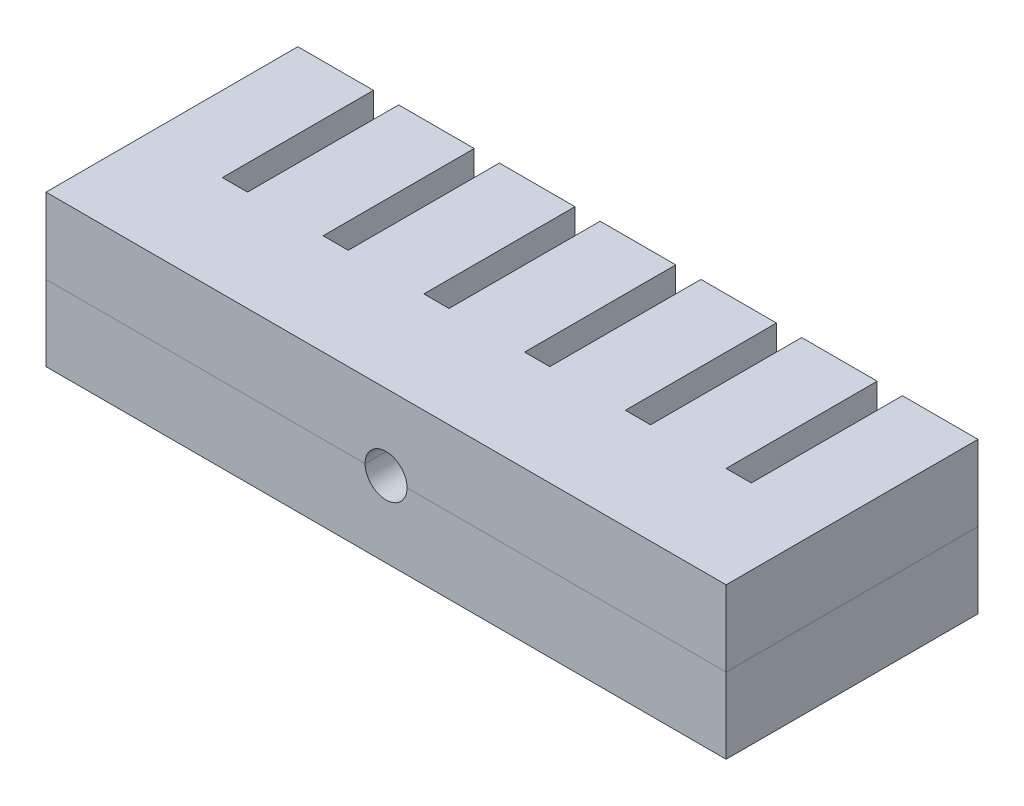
ISO-10303-21;
HEADER;
FILE_DESCRIPTION(('STEP AP214'),'2;1');
FILE_NAME('part.step','',(''),(''),'','','');
FILE_SCHEMA(('AUTOMOTIVE_DESIGN { 1 0 10303 214 1 1 1 1 }'));
ENDSEC;
DATA;
#1=APPLICATION_CONTEXT('core data for automotive mechanical design processes');
#2=APPLICATION_PROTOCOL_DEFINITION('international standard','automotive_design',2000,#1);
#3=PRODUCT_CONTEXT('',#1,'mechanical');
#4=PRODUCT('Part','Part','',(#3));
#5=PRODUCT_RELATED_PRODUCT_CATEGORY('part','',(#4));
#6=PRODUCT_DEFINITION_FORMATION('','',#4);
#7=PRODUCT_DEFINITION_CONTEXT('part definition',#1,'design');
#8=PRODUCT_DEFINITION('design','',#6,#7);
#9=PRODUCT_DEFINITION_SHAPE('','',#8);
#10=(LENGTH_UNIT() NAMED_UNIT(*) SI_UNIT(.MILLI.,.METRE.));
#11=(NAMED_UNIT(*) PLANE_ANGLE_UNIT() SI_UNIT($,.RADIAN.));
#12=(NAMED_UNIT(*) SI_UNIT($,.STERADIAN.) SOLID_ANGLE_UNIT());
#13=UNCERTAINTY_MEASURE_WITH_UNIT(LENGTH_MEASURE(1.E-05),#10,'distance_accuracy_value','');
#14=(GEOMETRIC_REPRESENTATION_CONTEXT(3) GLOBAL_UNCERTAINTY_ASSIGNED_CONTEXT((#13)) GLOBAL_UNIT_ASSIGNED_CONTEXT((#10,
#11,#12)) REPRESENTATION_CONTEXT('',''));
#15=CARTESIAN_POINT('',(0.,0.,0.));
#16=DIRECTION('',(0.,0.,1.));
#17=DIRECTION('',(1.,0.,0.));
#18=AXIS2_PLACEMENT_3D('',#15,#16,#17);
#19=CARTESIAN_POINT('',(0.,0.,0.));
#20=DIRECTION('',(0.,1.,0.));
#21=DIRECTION('',(0.,0.,1.));
#22=AXIS2_PLACEMENT_3D('',#19,#20,#21);
#23=PLANE('',#22);
#24=DIRECTION('',(1.,0.,0.));
#25=VECTOR('',#24,1.);
#26=CARTESIAN_POINT('',(62.,0.,-24.));
#27=LINE('',#26,#25);
#28=CARTESIAN_POINT('',(62.,0.,-24.));
#29=VERTEX_POINT('',#28);
#30=CARTESIAN_POINT('',(67.,0.,-24.));
#31=VERTEX_POINT('',#30);
#32=EDGE_CURVE('E1035',#29,#31,#27,.T.);
#33=ORIENTED_EDGE('',*,*,#32,.T.);
#34=DIRECTION('',(0.,0.,1.));
#35=VECTOR('',#34,1.);
#36=CARTESIAN_POINT('',(67.,0.,-6.));
#37=LINE('',#36,#35);
#38=CARTESIAN_POINT('',(67.,0.,-9.00000000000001));
#39=VERTEX_POINT('',#38);
#40=EDGE_CURVE('E1032',#31,#39,#37,.T.);
#41=ORIENTED_EDGE('',*,*,#40,.T.);
#42=DIRECTION('',(1.,0.,0.));
#43=VECTOR('',#42,1.);
#44=CARTESIAN_POINT('',(2.,0.,-9.00000000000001));
#45=LINE('',#44,#43);
#46=CARTESIAN_POINT('',(74.,0.,-9.00000000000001));
#47=VERTEX_POINT('',#46);
#48=EDGE_CURVE('E1026',#39,#47,#45,.T.);
#49=ORIENTED_EDGE('',*,*,#48,.T.);
#50=DIRECTION('',(0.,0.,-1.));
#51=VECTOR('',#50,1.);
#52=CARTESIAN_POINT('',(74.,0.,-6.));
#53=LINE('',#52,#51);
#54=CARTESIAN_POINT('',(74.,0.,-24.));
#55=VERTEX_POINT('',#54);
#56=EDGE_CURVE('E1015',#47,#55,#53,.T.);
#57=ORIENTED_EDGE('',*,*,#56,.T.);
#58=DIRECTION('',(1.,0.,0.));
#59=VECTOR('',#58,1.);
#60=CARTESIAN_POINT('',(74.,0.,-24.));
#61=LINE('',#60,#59);
#62=CARTESIAN_POINT('',(79.,0.,-24.));
#63=VERTEX_POINT('',#62);
#64=EDGE_CURVE('E1018',#55,#63,#61,.T.);
#65=ORIENTED_EDGE('',*,*,#64,.T.);
#66=DIRECTION('',(0.,0.,1.));
#67=VECTOR('',#66,1.);
#68=CARTESIAN_POINT('',(79.,0.,-6.));
#69=LINE('',#68,#67);
#70=CARTESIAN_POINT('',(79.,0.,-6.));
#71=VERTEX_POINT('',#70);
#72=EDGE_CURVE('E1023',#63,#71,#69,.T.);
#73=ORIENTED_EDGE('',*,*,#72,.T.);
#74=DIRECTION('',(-1.,0.,0.));
#75=VECTOR('',#74,1.);
#76=CARTESIAN_POINT('',(2.,0.,-6.));
#77=LINE('',#76,#75);
#78=CARTESIAN_POINT('',(43.,0.,-6.));
#79=VERTEX_POINT('',#78);
#80=EDGE_CURVE('E547',#71,#79,#77,.T.);
#81=ORIENTED_EDGE('',*,*,#80,.T.);
#82=DIRECTION('',(0.,0.,1.));
#83=VECTOR('',#82,1.);
#84=CARTESIAN_POINT('',(43.,0.,-9.));
#85=LINE('',#84,#83);
#86=CARTESIAN_POINT('',(43.,0.,0.));
#87=VERTEX_POINT('',#86);
#88=EDGE_CURVE('E639',#87,#79,#85,.F.);
#89=ORIENTED_EDGE('',*,*,#88,.F.);
#90=DIRECTION('',(1.,0.,0.));
#91=VECTOR('',#90,1.);
#92=CARTESIAN_POINT('',(0.,0.,0.));
#93=LINE('',#92,#91);
#94=CARTESIAN_POINT('',(81.,0.,0.));
#95=VERTEX_POINT('',#94);
#96=EDGE_CURVE('E573',#87,#95,#93,.T.);
#97=ORIENTED_EDGE('',*,*,#96,.T.);
#98=DIRECTION('',(0.,0.,-1.));
#99=VECTOR('',#98,1.);
#100=CARTESIAN_POINT('',(81.,0.,-30.));
#101=LINE('',#100,#99);
#102=CARTESIAN_POINT('',(81.,0.,-30.));
#103=VERTEX_POINT('',#102);
#104=EDGE_CURVE('E576',#95,#103,#101,.T.);
#105=ORIENTED_EDGE('',*,*,#104,.T.);
#106=DIRECTION('',(-1.,0.,0.));
#107=VECTOR('',#106,1.);
#108=CARTESIAN_POINT('',(0.,0.,-30.));
#109=LINE('',#108,#107);
#110=CARTESIAN_POINT('',(72.,0.,-30.));
#111=VERTEX_POINT('',#110);
#112=EDGE_CURVE('E579',#103,#111,#109,.T.);
#113=ORIENTED_EDGE('',*,*,#112,.T.);
#114=DIRECTION('',(0.,0.,1.));
#115=VECTOR('',#114,1.);
#116=CARTESIAN_POINT('',(72.,0.,-30.));
#117=LINE('',#116,#115);
#118=CARTESIAN_POINT('',(72.,0.,-12.));
#119=VERTEX_POINT('',#118);
#120=EDGE_CURVE('E594',#111,#119,#117,.T.);
#121=ORIENTED_EDGE('',*,*,#120,.T.);
#122=DIRECTION('',(-1.,0.,0.));
#123=VECTOR('',#122,1.);
#124=CARTESIAN_POINT('',(69.,0.,-12.));
#125=LINE('',#124,#123);
#126=CARTESIAN_POINT('',(69.,0.,-12.));
#127=VERTEX_POINT('',#126);
#128=EDGE_CURVE('E597',#119,#127,#125,.T.);
#129=ORIENTED_EDGE('',*,*,#128,.T.);
#130=DIRECTION('',(0.,0.,-1.));
#131=VECTOR('',#130,1.);
#132=CARTESIAN_POINT('',(69.,0.,-30.));
#133=LINE('',#132,#131);
#134=CARTESIAN_POINT('',(69.,0.,-30.));
#135=VERTEX_POINT('',#134);
#136=EDGE_CURVE('E591',#127,#135,#133,.T.);
#137=ORIENTED_EDGE('',*,*,#136,.T.);
#138=DIRECTION('',(-1.,0.,0.));
#139=VECTOR('',#138,1.);
#140=CARTESIAN_POINT('',(0.,0.,-30.));
#141=LINE('',#140,#139);
#142=CARTESIAN_POINT('',(60.,0.,-30.));
#143=VERTEX_POINT('',#142);
#144=EDGE_CURVE('E563',#135,#143,#141,.T.);
#145=ORIENTED_EDGE('',*,*,#144,.T.);
#146=DIRECTION('',(0.,0.,1.));
#147=VECTOR('',#146,1.);
#148=CARTESIAN_POINT('',(60.,0.,-30.));
#149=LINE('',#148,#147);
#150=CARTESIAN_POINT('',(60.,0.,-12.));
#151=VERTEX_POINT('',#150);
#152=EDGE_CURVE('E603',#143,#151,#149,.T.);
#153=ORIENTED_EDGE('',*,*,#152,.T.);
#154=DIRECTION('',(-1.,0.,0.));
#155=VECTOR('',#154,1.);
#156=CARTESIAN_POINT('',(57.,0.,-12.));
#157=LINE('',#156,#155);
#158=CARTESIAN_POINT('',(57.,0.,-12.));
#159=VERTEX_POINT('',#158);
#160=EDGE_CURVE('E606',#151,#159,#157,.T.);
#161=ORIENTED_EDGE('',*,*,#160,.T.);
#162=DIRECTION('',(0.,0.,-1.));
#163=VECTOR('',#162,1.);
#164=CARTESIAN_POINT('',(57.,0.,-30.));
#165=LINE('',#164,#163);
#166=CARTESIAN_POINT('',(57.,0.,-30.));
#167=VERTEX_POINT('',#166);
#168=EDGE_CURVE('E600',#159,#167,#165,.T.);
#169=ORIENTED_EDGE('',*,*,#168,.T.);
#170=DIRECTION('',(-1.,0.,0.));
#171=VECTOR('',#170,1.);
#172=CARTESIAN_POINT('',(0.,0.,-30.));
#173=LINE('',#172,#171);
#174=CARTESIAN_POINT('',(48.,0.,-30.));
#175=VERTEX_POINT('',#174);
#176=EDGE_CURVE('E560',#167,#175,#173,.T.);
#177=ORIENTED_EDGE('',*,*,#176,.T.);
#178=DIRECTION('',(0.,0.,1.));
#179=VECTOR('',#178,1.);
#180=CARTESIAN_POINT('',(48.,0.,-30.));
#181=LINE('',#180,#179);
#182=CARTESIAN_POINT('',(48.,0.,-12.));
#183=VERTEX_POINT('',#182);
#184=EDGE_CURVE('E612',#175,#183,#181,.T.);
#185=ORIENTED_EDGE('',*,*,#184,.T.);
#186=DIRECTION('',(-1.,0.,0.));
#187=VECTOR('',#186,1.);
#188=CARTESIAN_POINT('',(45.,0.,-12.));
#189=LINE('',#188,#187);
#190=CARTESIAN_POINT('',(45.,0.,-12.));
#191=VERTEX_POINT('',#190);
#192=EDGE_CURVE('E615',#183,#191,#189,.T.);
#193=ORIENTED_EDGE('',*,*,#192,.T.);
#194=DIRECTION('',(0.,0.,-1.));
#195=VECTOR('',#194,1.);
#196=CARTESIAN_POINT('',(45.,0.,-30.));
#197=LINE('',#196,#195);
#198=CARTESIAN_POINT('',(45.,0.,-30.));
#199=VERTEX_POINT('',#198);
#200=EDGE_CURVE('E609',#191,#199,#197,.T.);
#201=ORIENTED_EDGE('',*,*,#200,.T.);
#202=DIRECTION('',(-1.,0.,0.));
#203=VECTOR('',#202,1.);
#204=CARTESIAN_POINT('',(0.,0.,-30.));
#205=LINE('',#204,#203);
#206=CARTESIAN_POINT('',(36.,0.,-30.));
#207=VERTEX_POINT('',#206);
#208=EDGE_CURVE('E557',#199,#207,#205,.T.);
#209=ORIENTED_EDGE('',*,*,#208,.T.);
#210=DIRECTION('',(0.,0.,1.));
#211=VECTOR('',#210,1.);
#212=CARTESIAN_POINT('',(36.,0.,-30.));
#213=LINE('',#212,#211);
#214=CARTESIAN_POINT('',(36.,0.,-12.));
#215=VERTEX_POINT('',#214);
#216=EDGE_CURVE('E621',#207,#215,#213,.T.);
#217=ORIENTED_EDGE('',*,*,#216,.T.);
#218=DIRECTION('',(-1.,0.,0.));
#219=VECTOR('',#218,1.);
#220=CARTESIAN_POINT('',(33.,0.,-12.));
#221=LINE('',#220,#219);
#222=CARTESIAN_POINT('',(33.,0.,-12.));
#223=VERTEX_POINT('',#222);
#224=EDGE_CURVE('E624',#215,#223,#221,.T.);
#225=ORIENTED_EDGE('',*,*,#224,.T.);
#226=DIRECTION('',(0.,0.,-1.));
#227=VECTOR('',#226,1.);
#228=CARTESIAN_POINT('',(33.,0.,-30.));
#229=LINE('',#228,#227);
#230=CARTESIAN_POINT('',(33.,0.,-30.));
#231=VERTEX_POINT('',#230);
#232=EDGE_CURVE('E618',#223,#231,#229,.T.);
#233=ORIENTED_EDGE('',*,*,#232,.T.);
#234=DIRECTION('',(-1.,0.,0.));
#235=VECTOR('',#234,1.);
#236=CARTESIAN_POINT('',(0.,0.,-30.));
#237=LINE('',#236,#235);
#238=CARTESIAN_POINT('',(24.,0.,-30.));
#239=VERTEX_POINT('',#238);
#240=EDGE_CURVE('E554',#231,#239,#237,.T.);
#241=ORIENTED_EDGE('',*,*,#240,.T.);
#242=DIRECTION('',(0.,0.,1.));
#243=VECTOR('',#242,1.);
#244=CARTESIAN_POINT('',(24.,0.,-30.));
#245=LINE('',#244,#243);
#246=CARTESIAN_POINT('',(24.,0.,-12.));
#247=VERTEX_POINT('',#246);
#248=EDGE_CURVE('E630',#239,#247,#245,.T.);
#249=ORIENTED_EDGE('',*,*,#248,.T.);
#250=DIRECTION('',(-1.,0.,0.));
#251=VECTOR('',#250,1.);
#252=CARTESIAN_POINT('',(21.,0.,-12.));
#253=LINE('',#252,#251);
#254=CARTESIAN_POINT('',(21.,0.,-12.));
#255=VERTEX_POINT('',#254);
#256=EDGE_CURVE('E633',#247,#255,#253,.T.);
#257=ORIENTED_EDGE('',*,*,#256,.T.);
#258=DIRECTION('',(0.,0.,-1.));
#259=VECTOR('',#258,1.);
#260=CARTESIAN_POINT('',(21.,0.,-30.));
#261=LINE('',#260,#259);
#262=CARTESIAN_POINT('',(21.,0.,-30.));
#263=VERTEX_POINT('',#262);
#264=EDGE_CURVE('E627',#255,#263,#261,.T.);
#265=ORIENTED_EDGE('',*,*,#264,.T.);
#266=DIRECTION('',(-1.,0.,0.));
#267=VECTOR('',#266,1.);
#268=CARTESIAN_POINT('',(0.,0.,-30.));
#269=LINE('',#268,#267);
#270=CARTESIAN_POINT('',(12.,0.,-30.));
#271=VERTEX_POINT('',#270);
#272=EDGE_CURVE('E551',#263,#271,#269,.T.);
#273=ORIENTED_EDGE('',*,*,#272,.T.);
#274=DIRECTION('',(0.,0.,1.));
#275=VECTOR('',#274,1.);
#276=CARTESIAN_POINT('',(12.,0.,-30.));
#277=LINE('',#276,#275);
#278=CARTESIAN_POINT('',(12.,0.,-12.));
#279=VERTEX_POINT('',#278);
#280=EDGE_CURVE('E585',#271,#279,#277,.T.);
#281=ORIENTED_EDGE('',*,*,#280,.T.);
#282=DIRECTION('',(-1.,0.,0.));
#283=VECTOR('',#282,1.);
#284=CARTESIAN_POINT('',(9.,0.,-12.));
#285=LINE('',#284,#283);
#286=CARTESIAN_POINT('',(9.,0.,-12.));
#287=VERTEX_POINT('',#286);
#288=EDGE_CURVE('E588',#279,#287,#285,.T.);
#289=ORIENTED_EDGE('',*,*,#288,.T.);
#290=DIRECTION('',(0.,0.,-1.));
#291=VECTOR('',#290,1.);
#292=CARTESIAN_POINT('',(8.99999999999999,0.,-30.));
#293=LINE('',#292,#291);
#294=CARTESIAN_POINT('',(8.99999999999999,0.,-30.));
#295=VERTEX_POINT('',#294);
#296=EDGE_CURVE('E582',#287,#295,#293,.T.);
#297=ORIENTED_EDGE('',*,*,#296,.T.);
#298=DIRECTION('',(-1.,0.,0.));
#299=VECTOR('',#298,1.);
#300=CARTESIAN_POINT('',(0.,0.,-30.));
#301=LINE('',#300,#299);
#302=CARTESIAN_POINT('',(0.,0.,-30.));
#303=VERTEX_POINT('',#302);
#304=EDGE_CURVE('E566',#295,#303,#301,.T.);
#305=ORIENTED_EDGE('',*,*,#304,.T.);
#306=DIRECTION('',(0.,0.,1.));
#307=VECTOR('',#306,1.);
#308=CARTESIAN_POINT('',(0.,0.,0.));
#309=LINE('',#308,#307);
#310=CARTESIAN_POINT('',(0.,0.,0.));
#311=VERTEX_POINT('',#310);
#312=EDGE_CURVE('E569',#303,#311,#309,.T.);
#313=ORIENTED_EDGE('',*,*,#312,.T.);
#314=CARTESIAN_POINT('',(38.,0.,0.));
#315=VERTEX_POINT('',#314);
#316=EDGE_CURVE('E572',#311,#315,#93,.T.);
#317=ORIENTED_EDGE('',*,*,#316,.T.);
#318=DIRECTION('',(0.,0.,1.));
#319=VECTOR('',#318,1.);
#320=CARTESIAN_POINT('',(38.,0.,-9.));
#321=LINE('',#320,#319);
#322=CARTESIAN_POINT('',(38.,0.,-6.));
#323=VERTEX_POINT('',#322);
#324=EDGE_CURVE('E1012',#323,#315,#321,.T.);
#325=ORIENTED_EDGE('',*,*,#324,.F.);
#326=CARTESIAN_POINT('',(2.,0.,-6.));
#327=VERTEX_POINT('',#326);
#328=EDGE_CURVE('E548',#323,#327,#77,.T.);
#329=ORIENTED_EDGE('',*,*,#328,.T.);
#330=DIRECTION('',(0.,0.,-1.));
#331=VECTOR('',#330,1.);
#332=CARTESIAN_POINT('',(2.,0.,-6.));
#333=LINE('',#332,#331);
#334=CARTESIAN_POINT('',(2.,0.,-24.));
#335=VERTEX_POINT('',#334);
#336=EDGE_CURVE('E541',#327,#335,#333,.T.);
#337=ORIENTED_EDGE('',*,*,#336,.T.);
#338=DIRECTION('',(1.,0.,0.));
#339=VECTOR('',#338,1.);
#340=CARTESIAN_POINT('',(2.,0.,-24.));
#341=LINE('',#340,#339);
#342=CARTESIAN_POINT('',(6.99999999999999,0.,-24.));
#343=VERTEX_POINT('',#342);
#344=EDGE_CURVE('E544',#335,#343,#341,.T.);
#345=ORIENTED_EDGE('',*,*,#344,.T.);
#346=DIRECTION('',(0.,0.,1.));
#347=VECTOR('',#346,1.);
#348=CARTESIAN_POINT('',(6.99999999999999,0.,-6.));
#349=LINE('',#348,#347);
#350=CARTESIAN_POINT('',(6.99999999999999,0.,-9.00000000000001));
#351=VERTEX_POINT('',#350);
#352=EDGE_CURVE('E538',#343,#351,#349,.T.);
#353=ORIENTED_EDGE('',*,*,#352,.T.);
#354=DIRECTION('',(1.,0.,0.));
#355=VECTOR('',#354,1.);
#356=CARTESIAN_POINT('',(2.,0.,-9.00000000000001));
#357=LINE('',#356,#355);
#358=CARTESIAN_POINT('',(14.,0.,-9.00000000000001));
#359=VERTEX_POINT('',#358);
#360=EDGE_CURVE('E535',#351,#359,#357,.T.);
#361=ORIENTED_EDGE('',*,*,#360,.T.);
#362=DIRECTION('',(0.,0.,-1.));
#363=VECTOR('',#362,1.);
#364=CARTESIAN_POINT('',(14.,0.,-6.));
#365=LINE('',#364,#363);
#366=CARTESIAN_POINT('',(14.,0.,-24.));
#367=VERTEX_POINT('',#366);
#368=EDGE_CURVE('E526',#359,#367,#365,.T.);
#369=ORIENTED_EDGE('',*,*,#368,.T.);
#370=DIRECTION('',(1.,0.,0.));
#371=VECTOR('',#370,1.);
#372=CARTESIAN_POINT('',(14.,0.,-24.));
#373=LINE('',#372,#371);
#374=CARTESIAN_POINT('',(19.,0.,-24.));
#375=VERTEX_POINT('',#374);
#376=EDGE_CURVE('E532',#367,#375,#373,.T.);
#377=ORIENTED_EDGE('',*,*,#376,.T.);
#378=DIRECTION('',(0.,0.,1.));
#379=VECTOR('',#378,1.);
#380=CARTESIAN_POINT('',(19.,0.,-6.));
#381=LINE('',#380,#379);
#382=CARTESIAN_POINT('',(19.,0.,-9.00000000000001));
#383=VERTEX_POINT('',#382);
#384=EDGE_CURVE('E529',#375,#383,#381,.T.);
#385=ORIENTED_EDGE('',*,*,#384,.T.);
#386=DIRECTION('',(1.,0.,0.));
#387=VECTOR('',#386,1.);
#388=CARTESIAN_POINT('',(2.,0.,-9.00000000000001));
#389=LINE('',#388,#387);
#390=CARTESIAN_POINT('',(26.,0.,-9.00000000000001));
#391=VERTEX_POINT('',#390);
#392=EDGE_CURVE('E523',#383,#391,#389,.T.);
#393=ORIENTED_EDGE('',*,*,#392,.T.);
#394=DIRECTION('',(0.,0.,-1.));
#395=VECTOR('',#394,1.);
#396=CARTESIAN_POINT('',(26.,0.,-6.));
#397=LINE('',#396,#395);
#398=CARTESIAN_POINT('',(26.,0.,-24.));
#399=VERTEX_POINT('',#398);
#400=EDGE_CURVE('E513',#391,#399,#397,.T.);
#401=ORIENTED_EDGE('',*,*,#400,.T.);
#402=DIRECTION('',(1.,0.,0.));
#403=VECTOR('',#402,1.);
#404=CARTESIAN_POINT('',(26.,0.,-24.));
#405=LINE('',#404,#403);
#406=CARTESIAN_POINT('',(31.,0.,-24.));
#407=VERTEX_POINT('',#406);
#408=EDGE_CURVE('E521',#399,#407,#405,.T.);
#409=ORIENTED_EDGE('',*,*,#408,.T.);
#410=DIRECTION('',(0.,0.,1.));
#411=VECTOR('',#410,1.);
#412=CARTESIAN_POINT('',(31.,0.,-6.));
#413=LINE('',#412,#411);
#414=CARTESIAN_POINT('',(31.,0.,-9.00000000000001));
#415=VERTEX_POINT('',#414);
#416=EDGE_CURVE('E511',#407,#415,#413,.T.);
#417=ORIENTED_EDGE('',*,*,#416,.T.);
#418=DIRECTION('',(1.,0.,0.));
#419=VECTOR('',#418,1.);
#420=CARTESIAN_POINT('',(2.,0.,-9.00000000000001));
#421=LINE('',#420,#419);
#422=CARTESIAN_POINT('',(38.,0.,-9.00000000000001));
#423=VERTEX_POINT('',#422);
#424=EDGE_CURVE('E487',#415,#423,#421,.T.);
#425=ORIENTED_EDGE('',*,*,#424,.T.);
#426=DIRECTION('',(0.,0.,-1.));
#427=VECTOR('',#426,1.);
#428=CARTESIAN_POINT('',(38.,0.,-6.));
#429=LINE('',#428,#427);
#430=CARTESIAN_POINT('',(38.,0.,-24.));
#431=VERTEX_POINT('',#430);
#432=EDGE_CURVE('E498',#423,#431,#429,.T.);
#433=ORIENTED_EDGE('',*,*,#432,.T.);
#434=DIRECTION('',(1.,0.,0.));
#435=VECTOR('',#434,1.);
#436=CARTESIAN_POINT('',(38.,0.,-24.));
#437=LINE('',#436,#435);
#438=CARTESIAN_POINT('',(43.,0.,-24.));
#439=VERTEX_POINT('',#438);
#440=EDGE_CURVE('E512',#431,#439,#437,.T.);
#441=ORIENTED_EDGE('',*,*,#440,.T.);
#442=DIRECTION('',(0.,0.,1.));
#443=VECTOR('',#442,1.);
#444=CARTESIAN_POINT('',(43.,0.,-6.));
#445=LINE('',#444,#443);
#446=CARTESIAN_POINT('',(43.,0.,-9.00000000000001));
#447=VERTEX_POINT('',#446);
#448=EDGE_CURVE('E506',#439,#447,#445,.T.);
#449=ORIENTED_EDGE('',*,*,#448,.T.);
#450=DIRECTION('',(1.,0.,0.));
#451=VECTOR('',#450,1.);
#452=CARTESIAN_POINT('',(2.,0.,-9.00000000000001));
#453=LINE('',#452,#451);
#454=CARTESIAN_POINT('',(50.,0.,-9.00000000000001));
#455=VERTEX_POINT('',#454);
#456=EDGE_CURVE('E505',#447,#455,#453,.T.);
#457=ORIENTED_EDGE('',*,*,#456,.T.);
#458=DIRECTION('',(0.,0.,-1.));
#459=VECTOR('',#458,1.);
#460=CARTESIAN_POINT('',(50.,0.,-6.));
#461=LINE('',#460,#459);
#462=CARTESIAN_POINT('',(50.,0.,-24.));
#463=VERTEX_POINT('',#462);
#464=EDGE_CURVE('E1040',#455,#463,#461,.T.);
#465=ORIENTED_EDGE('',*,*,#464,.T.);
#466=DIRECTION('',(1.,0.,0.));
#467=VECTOR('',#466,1.);
#468=CARTESIAN_POINT('',(50.,0.,-24.));
#469=LINE('',#468,#467);
#470=CARTESIAN_POINT('',(55.,0.,-24.));
#471=VERTEX_POINT('',#470);
#472=EDGE_CURVE('E1046',#463,#471,#469,.T.);
#473=ORIENTED_EDGE('',*,*,#472,.T.);
#474=DIRECTION('',(0.,0.,1.));
#475=VECTOR('',#474,1.);
#476=CARTESIAN_POINT('',(55.,0.,-6.));
#477=LINE('',#476,#475);
#478=CARTESIAN_POINT('',(55.,0.,-9.00000000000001));
#479=VERTEX_POINT('',#478);
#480=EDGE_CURVE('E1043',#471,#479,#477,.T.);
#481=ORIENTED_EDGE('',*,*,#480,.T.);
#482=DIRECTION('',(1.,0.,0.));
#483=VECTOR('',#482,1.);
#484=CARTESIAN_POINT('',(2.,0.,-9.00000000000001));
#485=LINE('',#484,#483);
#486=CARTESIAN_POINT('',(62.,0.,-9.00000000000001));
#487=VERTEX_POINT('',#486);
#488=EDGE_CURVE('E1037',#479,#487,#485,.T.);
#489=ORIENTED_EDGE('',*,*,#488,.T.);
#490=DIRECTION('',(0.,0.,-1.));
#491=VECTOR('',#490,1.);
#492=CARTESIAN_POINT('',(62.,0.,-6.));
#493=LINE('',#492,#491);
#494=EDGE_CURVE('E1029',#487,#29,#493,.T.);
#495=ORIENTED_EDGE('',*,*,#494,.T.);
#496=EDGE_LOOP('',(#33,#41,#49,#57,#65,#73,#81,#89,#97,#105,#113,#121,#129,#137,#145,#153,#161,
#169,#177,#185,#193,#201,#209,#217,#225,#233,#241,#249,#257,#265,#273,#281,#289,#297,#305,#313,
#317,#325,#329,#337,#345,#353,#361,#369,#377,#385,#393,#401,#409,#417,#425,#433,#441,#449,#457,
#465,#473,#481,#489,#495));
#497=FACE_BOUND('',#496,.T.);
#498=ADVANCED_FACE('F45',(#497),#23,.T.);
#499=CARTESIAN_POINT('',(74.,-6.,-6.));
#500=DIRECTION('',(-1.,0.,0.));
#501=DIRECTION('',(0.,0.,1.));
#502=AXIS2_PLACEMENT_3D('',#499,#500,#501);
#503=PLANE('',#502);
#504=ORIENTED_EDGE('',*,*,#56,.F.);
#505=DIRECTION('',(0.,-1.,0.));
#506=VECTOR('',#505,1.);
#507=CARTESIAN_POINT('',(74.,-6.,-9.00000000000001));
#508=LINE('',#507,#506);
#509=CARTESIAN_POINT('',(74.,-3.,-9.00000000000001));
#510=VERTEX_POINT('',#509);
#511=EDGE_CURVE('E60',#47,#510,#508,.T.);
#512=ORIENTED_EDGE('',*,*,#511,.T.);
#513=DIRECTION('',(0.,0.,-1.));
#514=VECTOR('',#513,1.);
#515=CARTESIAN_POINT('',(74.,-3.,-6.));
#516=LINE('',#515,#514);
#517=CARTESIAN_POINT('',(74.,-3.,-6.));
#518=VERTEX_POINT('',#517);
#519=EDGE_CURVE('E834',#518,#510,#516,.T.);
#520=ORIENTED_EDGE('',*,*,#519,.F.);
#521=DIRECTION('',(0.,1.,0.));
#522=VECTOR('',#521,1.);
#523=CARTESIAN_POINT('',(74.,-6.,-6.));
#524=LINE('',#523,#522);
#525=CARTESIAN_POINT('',(74.,-6.,-6.));
#526=VERTEX_POINT('',#525);
#527=EDGE_CURVE('E783',#526,#518,#524,.T.);
#528=ORIENTED_EDGE('',*,*,#527,.F.);
#529=DIRECTION('',(0.,0.,1.));
#530=VECTOR('',#529,1.);
#531=CARTESIAN_POINT('',(74.,-6.,-6.));
#532=LINE('',#531,#530);
#533=CARTESIAN_POINT('',(74.,-6.,-24.));
#534=VERTEX_POINT('',#533);
#535=EDGE_CURVE('E790',#534,#526,#532,.T.);
#536=ORIENTED_EDGE('',*,*,#535,.F.);
#537=DIRECTION('',(0.,1.,0.));
#538=VECTOR('',#537,1.);
#539=CARTESIAN_POINT('',(74.,-6.,-24.));
#540=LINE('',#539,#538);
#541=EDGE_CURVE('E776',#534,#55,#540,.T.);
#542=ORIENTED_EDGE('',*,*,#541,.T.);
#543=EDGE_LOOP('',(#504,#512,#520,#528,#536,#542));
#544=FACE_BOUND('',#543,.T.);
#545=ADVANCED_FACE('F1092',(#544),#503,.F.);
#546=CARTESIAN_POINT('',(74.,-6.,-24.));
#547=DIRECTION('',(0.,0.,-1.));
#548=DIRECTION('',(-1.,0.,0.));
#549=AXIS2_PLACEMENT_3D('',#546,#547,#548);
#550=PLANE('',#549);
#551=ORIENTED_EDGE('',*,*,#64,.F.);
#552=ORIENTED_EDGE('',*,*,#541,.F.);
#553=DIRECTION('',(-1.,0.,0.));
#554=VECTOR('',#553,1.);
#555=CARTESIAN_POINT('',(74.,-6.,-24.));
#556=LINE('',#555,#554);
#557=CARTESIAN_POINT('',(79.,-6.,-24.));
#558=VERTEX_POINT('',#557);
#559=EDGE_CURVE('E786',#558,#534,#556,.T.);
#560=ORIENTED_EDGE('',*,*,#559,.F.);
#561=DIRECTION('',(0.,1.,0.));
#562=VECTOR('',#561,1.);
#563=CARTESIAN_POINT('',(79.,-6.,-24.));
#564=LINE('',#563,#562);
#565=EDGE_CURVE('E778',#558,#63,#564,.T.);
#566=ORIENTED_EDGE('',*,*,#565,.T.);
#567=EDGE_LOOP('',(#551,#552,#560,#566));
#568=FACE_BOUND('',#567,.T.);
#569=ADVANCED_FACE('F1097',(#568),#550,.F.);
#570=CARTESIAN_POINT('',(79.,-6.,-6.));
#571=DIRECTION('',(1.,0.,0.));
#572=DIRECTION('',(0.,0.,-1.));
#573=AXIS2_PLACEMENT_3D('',#570,#571,#572);
#574=PLANE('',#573);
#575=ORIENTED_EDGE('',*,*,#72,.F.);
#576=ORIENTED_EDGE('',*,*,#565,.F.);
#577=DIRECTION('',(0.,0.,-1.));
#578=VECTOR('',#577,1.);
#579=CARTESIAN_POINT('',(79.,-6.,-6.));
#580=LINE('',#579,#578);
#581=CARTESIAN_POINT('',(79.,-6.,-6.));
#582=VERTEX_POINT('',#581);
#583=EDGE_CURVE('E918',#582,#558,#580,.T.);
#584=ORIENTED_EDGE('',*,*,#583,.F.);
#585=DIRECTION('',(0.,1.,0.));
#586=VECTOR('',#585,1.);
#587=CARTESIAN_POINT('',(79.,-6.,-6.));
#588=LINE('',#587,#586);
#589=EDGE_CURVE('E781',#582,#71,#588,.T.);
#590=ORIENTED_EDGE('',*,*,#589,.T.);
#591=EDGE_LOOP('',(#575,#576,#584,#590));
#592=FACE_BOUND('',#591,.T.);
#593=ADVANCED_FACE('F1101',(#592),#574,.F.);
#594=CARTESIAN_POINT('',(2.,-3.,-9.00000000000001));
#595=DIRECTION('',(0.,0.,-1.));
#596=DIRECTION('',(-1.,0.,0.));
#597=AXIS2_PLACEMENT_3D('',#594,#595,#596);
#598=PLANE('',#597);
#599=ORIENTED_EDGE('',*,*,#48,.F.);
#600=DIRECTION('',(0.,1.,0.));
#601=VECTOR('',#600,1.);
#602=CARTESIAN_POINT('',(67.,-6.,-9.00000000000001));
#603=LINE('',#602,#601);
#604=CARTESIAN_POINT('',(67.,-3.,-9.00000000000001));
#605=VERTEX_POINT('',#604);
#606=EDGE_CURVE('E68',#605,#39,#603,.T.);
#607=ORIENTED_EDGE('',*,*,#606,.F.);
#608=DIRECTION('',(-1.,0.,0.));
#609=VECTOR('',#608,1.);
#610=CARTESIAN_POINT('',(2.,-3.,-9.00000000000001));
#611=LINE('',#610,#609);
#612=EDGE_CURVE('E828',#510,#605,#611,.T.);
#613=ORIENTED_EDGE('',*,*,#612,.F.);
#614=ORIENTED_EDGE('',*,*,#511,.F.);
#615=EDGE_LOOP('',(#599,#607,#613,#614));
#616=FACE_BOUND('',#615,.T.);
#617=ADVANCED_FACE('F1091',(#616),#598,.F.);
#618=CARTESIAN_POINT('',(62.,-6.,-6.));
#619=DIRECTION('',(-1.,0.,0.));
#620=DIRECTION('',(0.,0.,1.));
#621=AXIS2_PLACEMENT_3D('',#618,#619,#620);
#622=PLANE('',#621);
#623=ORIENTED_EDGE('',*,*,#494,.F.);
#624=DIRECTION('',(0.,-1.,0.));
#625=VECTOR('',#624,1.);
#626=CARTESIAN_POINT('',(62.,-6.,-9.00000000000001));
#627=LINE('',#626,#625);
#628=CARTESIAN_POINT('',(62.,-3.,-9.00000000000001));
#629=VERTEX_POINT('',#628);
#630=EDGE_CURVE('E802',#487,#629,#627,.T.);
#631=ORIENTED_EDGE('',*,*,#630,.T.);
#632=DIRECTION('',(0.,0.,-1.));
#633=VECTOR('',#632,1.);
#634=CARTESIAN_POINT('',(62.,-3.,-6.));
#635=LINE('',#634,#633);
#636=CARTESIAN_POINT('',(62.,-3.,-6.));
#637=VERTEX_POINT('',#636);
#638=EDGE_CURVE('E839',#637,#629,#635,.T.);
#639=ORIENTED_EDGE('',*,*,#638,.F.);
#640=DIRECTION('',(0.,1.,0.));
#641=VECTOR('',#640,1.);
#642=CARTESIAN_POINT('',(62.,-6.,-6.));
#643=LINE('',#642,#641);
#644=CARTESIAN_POINT('',(62.,-6.,-6.));
#645=VERTEX_POINT('',#644);
#646=EDGE_CURVE('E772',#645,#637,#643,.T.);
#647=ORIENTED_EDGE('',*,*,#646,.F.);
#648=DIRECTION('',(0.,0.,1.));
#649=VECTOR('',#648,1.);
#650=CARTESIAN_POINT('',(62.,-6.,-6.));
#651=LINE('',#650,#649);
#652=CARTESIAN_POINT('',(62.,-6.,-24.));
#653=VERTEX_POINT('',#652);
#654=EDGE_CURVE('E779',#653,#645,#651,.T.);
#655=ORIENTED_EDGE('',*,*,#654,.F.);
#656=DIRECTION('',(0.,1.,0.));
#657=VECTOR('',#656,1.);
#658=CARTESIAN_POINT('',(62.,-6.,-24.));
#659=LINE('',#658,#657);
#660=EDGE_CURVE('E764',#653,#29,#659,.T.);
#661=ORIENTED_EDGE('',*,*,#660,.T.);
#662=EDGE_LOOP('',(#623,#631,#639,#647,#655,#661));
#663=FACE_BOUND('',#662,.T.);
#664=ADVANCED_FACE('F1083',(#663),#622,.F.);
#665=CARTESIAN_POINT('',(67.,-6.,-6.));
#666=DIRECTION('',(1.,0.,0.));
#667=DIRECTION('',(0.,0.,-1.));
#668=AXIS2_PLACEMENT_3D('',#665,#666,#667);
#669=PLANE('',#668);
#670=ORIENTED_EDGE('',*,*,#40,.F.);
#671=DIRECTION('',(0.,1.,0.));
#672=VECTOR('',#671,1.);
#673=CARTESIAN_POINT('',(67.,-6.,-24.));
#674=LINE('',#673,#672);
#675=CARTESIAN_POINT('',(67.,-6.,-24.));
#676=VERTEX_POINT('',#675);
#677=EDGE_CURVE('E766',#676,#31,#674,.T.);
#678=ORIENTED_EDGE('',*,*,#677,.F.);
#679=DIRECTION('',(0.,0.,-1.));
#680=VECTOR('',#679,1.);
#681=CARTESIAN_POINT('',(67.,-6.,-6.));
#682=LINE('',#681,#680);
#683=CARTESIAN_POINT('',(67.,-6.,-6.));
#684=VERTEX_POINT('',#683);
#685=EDGE_CURVE('E908',#684,#676,#682,.T.);
#686=ORIENTED_EDGE('',*,*,#685,.F.);
#687=DIRECTION('',(0.,1.,0.));
#688=VECTOR('',#687,1.);
#689=CARTESIAN_POINT('',(67.,-6.,-6.));
#690=LINE('',#689,#688);
#691=CARTESIAN_POINT('',(67.,-3.,-6.));
#692=VERTEX_POINT('',#691);
#693=EDGE_CURVE('E769',#684,#692,#690,.T.);
#694=ORIENTED_EDGE('',*,*,#693,.T.);
#695=DIRECTION('',(0.,0.,1.));
#696=VECTOR('',#695,1.);
#697=CARTESIAN_POINT('',(67.,-3.,-6.));
#698=LINE('',#697,#696);
#699=EDGE_CURVE('E838',#605,#692,#698,.T.);
#700=ORIENTED_EDGE('',*,*,#699,.F.);
#701=ORIENTED_EDGE('',*,*,#606,.T.);
#702=EDGE_LOOP('',(#670,#678,#686,#694,#700,#701));
#703=FACE_BOUND('',#702,.T.);
#704=ADVANCED_FACE('F1089',(#703),#669,.F.);
#705=CARTESIAN_POINT('',(62.,-6.,-24.));
#706=DIRECTION('',(0.,0.,-1.));
#707=DIRECTION('',(-1.,0.,0.));
#708=AXIS2_PLACEMENT_3D('',#705,#706,#707);
#709=PLANE('',#708);
#710=ORIENTED_EDGE('',*,*,#32,.F.);
#711=ORIENTED_EDGE('',*,*,#660,.F.);
#712=DIRECTION('',(-1.,0.,0.));
#713=VECTOR('',#712,1.);
#714=CARTESIAN_POINT('',(62.,-6.,-24.));
#715=LINE('',#714,#713);
#716=EDGE_CURVE('E775',#676,#653,#715,.T.);
#717=ORIENTED_EDGE('',*,*,#716,.F.);
#718=ORIENTED_EDGE('',*,*,#677,.T.);
#719=EDGE_LOOP('',(#710,#711,#717,#718));
#720=FACE_BOUND('',#719,.T.);
#721=ADVANCED_FACE('F47',(#720),#709,.F.);
#722=ORIENTED_EDGE('',*,*,#488,.F.);
#723=DIRECTION('',(0.,1.,0.));
#724=VECTOR('',#723,1.);
#725=CARTESIAN_POINT('',(55.,-6.,-9.00000000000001));
#726=LINE('',#725,#724);
#727=CARTESIAN_POINT('',(55.,-3.,-9.00000000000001));
#728=VERTEX_POINT('',#727);
#729=EDGE_CURVE('E800',#728,#479,#726,.T.);
#730=ORIENTED_EDGE('',*,*,#729,.F.);
#731=EDGE_CURVE('E833',#629,#728,#611,.T.);
#732=ORIENTED_EDGE('',*,*,#731,.F.);
#733=ORIENTED_EDGE('',*,*,#630,.F.);
#734=EDGE_LOOP('',(#722,#730,#732,#733));
#735=FACE_BOUND('',#734,.T.);
#736=ADVANCED_FACE('F1079',(#735),#598,.F.);
#737=CARTESIAN_POINT('',(50.,-6.,-6.));
#738=DIRECTION('',(-1.,0.,0.));
#739=DIRECTION('',(0.,0.,1.));
#740=AXIS2_PLACEMENT_3D('',#737,#738,#739);
#741=PLANE('',#740);
#742=ORIENTED_EDGE('',*,*,#464,.F.);
#743=DIRECTION('',(0.,-1.,0.));
#744=VECTOR('',#743,1.);
#745=CARTESIAN_POINT('',(50.,-6.,-9.00000000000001));
#746=LINE('',#745,#744);
#747=CARTESIAN_POINT('',(50.,-3.,-9.00000000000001));
#748=VERTEX_POINT('',#747);
#749=EDGE_CURVE('E798',#455,#748,#746,.T.);
#750=ORIENTED_EDGE('',*,*,#749,.T.);
#751=DIRECTION('',(0.,0.,-1.));
#752=VECTOR('',#751,1.);
#753=CARTESIAN_POINT('',(50.,-3.,-6.));
#754=LINE('',#753,#752);
#755=CARTESIAN_POINT('',(50.,-3.,-6.));
#756=VERTEX_POINT('',#755);
#757=EDGE_CURVE('E846',#756,#748,#754,.T.);
#758=ORIENTED_EDGE('',*,*,#757,.F.);
#759=DIRECTION('',(0.,1.,0.));
#760=VECTOR('',#759,1.);
#761=CARTESIAN_POINT('',(50.,-6.,-6.));
#762=LINE('',#761,#760);
#763=CARTESIAN_POINT('',(50.,-6.,-6.));
#764=VERTEX_POINT('',#763);
#765=EDGE_CURVE('E760',#764,#756,#762,.T.);
#766=ORIENTED_EDGE('',*,*,#765,.F.);
#767=DIRECTION('',(0.,0.,1.));
#768=VECTOR('',#767,1.);
#769=CARTESIAN_POINT('',(50.,-6.,-6.));
#770=LINE('',#769,#768);
#771=CARTESIAN_POINT('',(50.,-6.,-24.));
#772=VERTEX_POINT('',#771);
#773=EDGE_CURVE('E767',#772,#764,#770,.T.);
#774=ORIENTED_EDGE('',*,*,#773,.F.);
#775=DIRECTION('',(0.,1.,0.));
#776=VECTOR('',#775,1.);
#777=CARTESIAN_POINT('',(50.,-6.,-24.));
#778=LINE('',#777,#776);
#779=EDGE_CURVE('E752',#772,#463,#778,.T.);
#780=ORIENTED_EDGE('',*,*,#779,.T.);
#781=EDGE_LOOP('',(#742,#750,#758,#766,#774,#780));
#782=FACE_BOUND('',#781,.T.);
#783=ADVANCED_FACE('F1064',(#782),#741,.F.);
#784=CARTESIAN_POINT('',(55.,-6.,-6.));
#785=DIRECTION('',(1.,0.,0.));
#786=DIRECTION('',(0.,0.,-1.));
#787=AXIS2_PLACEMENT_3D('',#784,#785,#786);
#788=PLANE('',#787);
#789=ORIENTED_EDGE('',*,*,#480,.F.);
#790=DIRECTION('',(0.,1.,0.));
#791=VECTOR('',#790,1.);
#792=CARTESIAN_POINT('',(55.,-6.,-24.));
#793=LINE('',#792,#791);
#794=CARTESIAN_POINT('',(55.,-6.,-24.));
#795=VERTEX_POINT('',#794);
#796=EDGE_CURVE('E754',#795,#471,#793,.T.);
#797=ORIENTED_EDGE('',*,*,#796,.F.);
#798=DIRECTION('',(0.,0.,-1.));
#799=VECTOR('',#798,1.);
#800=CARTESIAN_POINT('',(55.,-6.,-6.));
#801=LINE('',#800,#799);
#802=CARTESIAN_POINT('',(55.,-6.,-6.));
#803=VERTEX_POINT('',#802);
#804=EDGE_CURVE('E898',#803,#795,#801,.T.);
#805=ORIENTED_EDGE('',*,*,#804,.F.);
#806=DIRECTION('',(0.,1.,0.));
#807=VECTOR('',#806,1.);
#808=CARTESIAN_POINT('',(55.,-6.,-6.));
#809=LINE('',#808,#807);
#810=CARTESIAN_POINT('',(55.,-3.,-6.));
#811=VERTEX_POINT('',#810);
#812=EDGE_CURVE('E757',#803,#811,#809,.T.);
#813=ORIENTED_EDGE('',*,*,#812,.T.);
#814=DIRECTION('',(0.,0.,1.));
#815=VECTOR('',#814,1.);
#816=CARTESIAN_POINT('',(55.,-3.,-6.));
#817=LINE('',#816,#815);
#818=EDGE_CURVE('E844',#728,#811,#817,.T.);
#819=ORIENTED_EDGE('',*,*,#818,.F.);
#820=ORIENTED_EDGE('',*,*,#729,.T.);
#821=EDGE_LOOP('',(#789,#797,#805,#813,#819,#820));
#822=FACE_BOUND('',#821,.T.);
#823=ADVANCED_FACE('F1073',(#822),#788,.F.);
#824=CARTESIAN_POINT('',(50.,-6.,-24.));
#825=DIRECTION('',(0.,0.,-1.));
#826=DIRECTION('',(-1.,0.,0.));
#827=AXIS2_PLACEMENT_3D('',#824,#825,#826);
#828=PLANE('',#827);
#829=ORIENTED_EDGE('',*,*,#472,.F.);
#830=ORIENTED_EDGE('',*,*,#779,.F.);
#831=DIRECTION('',(-1.,0.,0.));
#832=VECTOR('',#831,1.);
#833=CARTESIAN_POINT('',(50.,-6.,-24.));
#834=LINE('',#833,#832);
#835=EDGE_CURVE('E763',#795,#772,#834,.T.);
#836=ORIENTED_EDGE('',*,*,#835,.F.);
#837=ORIENTED_EDGE('',*,*,#796,.T.);
#838=EDGE_LOOP('',(#829,#830,#836,#837));
#839=FACE_BOUND('',#838,.T.);
#840=ADVANCED_FACE('F1068',(#839),#828,.F.);
#841=ORIENTED_EDGE('',*,*,#456,.F.);
#842=DIRECTION('',(0.,1.,0.));
#843=VECTOR('',#842,1.);
#844=CARTESIAN_POINT('',(43.,-6.,-9.00000000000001));
#845=LINE('',#844,#843);
#846=CARTESIAN_POINT('',(43.,-3.,-9.00000000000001));
#847=VERTEX_POINT('',#846);
#848=EDGE_CURVE('E494',#847,#447,#845,.T.);
#849=ORIENTED_EDGE('',*,*,#848,.F.);
#850=EDGE_CURVE('E837',#748,#847,#611,.T.);
#851=ORIENTED_EDGE('',*,*,#850,.F.);
#852=ORIENTED_EDGE('',*,*,#749,.F.);
#853=EDGE_LOOP('',(#841,#849,#851,#852));
#854=FACE_BOUND('',#853,.T.);
#855=ADVANCED_FACE('F1060',(#854),#598,.F.);
#856=CARTESIAN_POINT('',(38.,-6.,-6.));
#857=DIRECTION('',(-1.,0.,0.));
#858=DIRECTION('',(0.,0.,1.));
#859=AXIS2_PLACEMENT_3D('',#856,#857,#858);
#860=PLANE('',#859);
#861=ORIENTED_EDGE('',*,*,#432,.F.);
#862=DIRECTION('',(0.,-1.,0.));
#863=VECTOR('',#862,1.);
#864=CARTESIAN_POINT('',(38.,-6.,-9.00000000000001));
#865=LINE('',#864,#863);
#866=CARTESIAN_POINT('',(38.,-3.,-9.00000000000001));
#867=VERTEX_POINT('',#866);
#868=EDGE_CURVE('E483',#423,#867,#865,.T.);
#869=ORIENTED_EDGE('',*,*,#868,.T.);
#870=DIRECTION('',(0.,0.,-1.));
#871=VECTOR('',#870,1.);
#872=CARTESIAN_POINT('',(38.,-3.,-6.));
#873=LINE('',#872,#871);
#874=CARTESIAN_POINT('',(38.,-3.,-6.));
#875=VERTEX_POINT('',#874);
#876=EDGE_CURVE('E851',#875,#867,#873,.T.);
#877=ORIENTED_EDGE('',*,*,#876,.F.);
#878=DIRECTION('',(0.,1.,0.));
#879=VECTOR('',#878,1.);
#880=CARTESIAN_POINT('',(38.,-6.,-6.));
#881=LINE('',#880,#879);
#882=CARTESIAN_POINT('',(38.,-6.,-6.));
#883=VERTEX_POINT('',#882);
#884=EDGE_CURVE('E748',#883,#875,#881,.T.);
#885=ORIENTED_EDGE('',*,*,#884,.F.);
#886=DIRECTION('',(0.,0.,1.));
#887=VECTOR('',#886,1.);
#888=CARTESIAN_POINT('',(38.,-6.,-6.));
#889=LINE('',#888,#887);
#890=CARTESIAN_POINT('',(38.,-6.,-24.));
#891=VERTEX_POINT('',#890);
#892=EDGE_CURVE('E755',#891,#883,#889,.T.);
#893=ORIENTED_EDGE('',*,*,#892,.F.);
#894=DIRECTION('',(0.,1.,0.));
#895=VECTOR('',#894,1.);
#896=CARTESIAN_POINT('',(38.,-6.,-24.));
#897=LINE('',#896,#895);
#898=EDGE_CURVE('E501',#891,#431,#897,.T.);
#899=ORIENTED_EDGE('',*,*,#898,.T.);
#900=EDGE_LOOP('',(#861,#869,#877,#885,#893,#899));
#901=FACE_BOUND('',#900,.T.);
#902=ADVANCED_FACE('F499',(#901),#860,.F.);
#903=CARTESIAN_POINT('',(43.,-6.,-6.));
#904=DIRECTION('',(1.,0.,0.));
#905=DIRECTION('',(0.,0.,-1.));
#906=AXIS2_PLACEMENT_3D('',#903,#904,#905);
#907=PLANE('',#906);
#908=ORIENTED_EDGE('',*,*,#448,.F.);
#909=DIRECTION('',(0.,1.,0.));
#910=VECTOR('',#909,1.);
#911=CARTESIAN_POINT('',(43.,-6.,-24.));
#912=LINE('',#911,#910);
#913=CARTESIAN_POINT('',(43.,-6.,-24.));
#914=VERTEX_POINT('',#913);
#915=EDGE_CURVE('E742',#914,#439,#912,.T.);
#916=ORIENTED_EDGE('',*,*,#915,.F.);
#917=DIRECTION('',(0.,0.,-1.));
#918=VECTOR('',#917,1.);
#919=CARTESIAN_POINT('',(43.,-6.,-6.));
#920=LINE('',#919,#918);
#921=CARTESIAN_POINT('',(43.,-6.,-6.));
#922=VERTEX_POINT('',#921);
#923=EDGE_CURVE('E888',#922,#914,#920,.T.);
#924=ORIENTED_EDGE('',*,*,#923,.F.);
#925=DIRECTION('',(0.,1.,0.));
#926=VECTOR('',#925,1.);
#927=CARTESIAN_POINT('',(43.,-6.,-6.));
#928=LINE('',#927,#926);
#929=CARTESIAN_POINT('',(43.,-3.,-6.));
#930=VERTEX_POINT('',#929);
#931=EDGE_CURVE('E745',#922,#930,#928,.T.);
#932=ORIENTED_EDGE('',*,*,#931,.T.);
#933=DIRECTION('',(0.,0.,1.));
#934=VECTOR('',#933,1.);
#935=CARTESIAN_POINT('',(43.,-3.,-6.));
#936=LINE('',#935,#934);
#937=EDGE_CURVE('E849',#847,#930,#936,.T.);
#938=ORIENTED_EDGE('',*,*,#937,.F.);
#939=ORIENTED_EDGE('',*,*,#848,.T.);
#940=EDGE_LOOP('',(#908,#916,#924,#932,#938,#939));
#941=FACE_BOUND('',#940,.T.);
#942=ADVANCED_FACE('F1054',(#941),#907,.F.);
#943=CARTESIAN_POINT('',(38.,-6.,-24.));
#944=DIRECTION('',(0.,0.,-1.));
#945=DIRECTION('',(-1.,0.,0.));
#946=AXIS2_PLACEMENT_3D('',#943,#944,#945);
#947=PLANE('',#946);
#948=ORIENTED_EDGE('',*,*,#440,.F.);
#949=ORIENTED_EDGE('',*,*,#898,.F.);
#950=DIRECTION('',(-1.,0.,0.));
#951=VECTOR('',#950,1.);
#952=CARTESIAN_POINT('',(38.,-6.,-24.));
#953=LINE('',#952,#951);
#954=EDGE_CURVE('E751',#914,#891,#953,.T.);
#955=ORIENTED_EDGE('',*,*,#954,.F.);
#956=ORIENTED_EDGE('',*,*,#915,.T.);
#957=EDGE_LOOP('',(#948,#949,#955,#956));
#958=FACE_BOUND('',#957,.T.);
#959=ADVANCED_FACE('F1200',(#958),#947,.F.);
#960=ORIENTED_EDGE('',*,*,#424,.F.);
#961=DIRECTION('',(0.,1.,0.));
#962=VECTOR('',#961,1.);
#963=CARTESIAN_POINT('',(31.,-6.,-9.00000000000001));
#964=LINE('',#963,#962);
#965=CARTESIAN_POINT('',(31.,-3.,-9.00000000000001));
#966=VERTEX_POINT('',#965);
#967=EDGE_CURVE('E495',#966,#415,#964,.T.);
#968=ORIENTED_EDGE('',*,*,#967,.F.);
#969=EDGE_CURVE('E490',#867,#966,#611,.T.);
#970=ORIENTED_EDGE('',*,*,#969,.F.);
#971=ORIENTED_EDGE('',*,*,#868,.F.);
#972=EDGE_LOOP('',(#960,#968,#970,#971));
#973=FACE_BOUND('',#972,.T.);
#974=ADVANCED_FACE('F485',(#973),#598,.F.);
#975=CARTESIAN_POINT('',(26.,-6.,-6.));
#976=DIRECTION('',(-1.,0.,0.));
#977=DIRECTION('',(0.,0.,1.));
#978=AXIS2_PLACEMENT_3D('',#975,#976,#977);
#979=PLANE('',#978);
#980=ORIENTED_EDGE('',*,*,#400,.F.);
#981=DIRECTION('',(0.,-1.,0.));
#982=VECTOR('',#981,1.);
#983=CARTESIAN_POINT('',(26.,-6.,-9.00000000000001));
#984=LINE('',#983,#982);
#985=CARTESIAN_POINT('',(26.,-3.,-9.00000000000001));
#986=VERTEX_POINT('',#985);
#987=EDGE_CURVE('E794',#391,#986,#984,.T.);
#988=ORIENTED_EDGE('',*,*,#987,.T.);
#989=DIRECTION('',(0.,0.,-1.));
#990=VECTOR('',#989,1.);
#991=CARTESIAN_POINT('',(26.,-3.,-6.));
#992=LINE('',#991,#990);
#993=CARTESIAN_POINT('',(26.,-3.,-6.));
#994=VERTEX_POINT('',#993);
#995=EDGE_CURVE('E855',#994,#986,#992,.T.);
#996=ORIENTED_EDGE('',*,*,#995,.F.);
#997=DIRECTION('',(0.,1.,0.));
#998=VECTOR('',#997,1.);
#999=CARTESIAN_POINT('',(26.,-6.,-6.));
#1000=LINE('',#999,#998);
#1001=CARTESIAN_POINT('',(26.,-6.,-6.));
#1002=VERTEX_POINT('',#1001);
#1003=EDGE_CURVE('E737',#1002,#994,#1000,.T.);
#1004=ORIENTED_EDGE('',*,*,#1003,.F.);
#1005=DIRECTION('',(0.,0.,1.));
#1006=VECTOR('',#1005,1.);
#1007=CARTESIAN_POINT('',(26.,-6.,-6.));
#1008=LINE('',#1007,#1006);
#1009=CARTESIAN_POINT('',(26.,-6.,-24.));
#1010=VERTEX_POINT('',#1009);
#1011=EDGE_CURVE('E743',#1010,#1002,#1008,.T.);
#1012=ORIENTED_EDGE('',*,*,#1011,.F.);
#1013=DIRECTION('',(0.,1.,0.));
#1014=VECTOR('',#1013,1.);
#1015=CARTESIAN_POINT('',(26.,-6.,-24.));
#1016=LINE('',#1015,#1014);
#1017=EDGE_CURVE('E729',#1010,#399,#1016,.T.);
#1018=ORIENTED_EDGE('',*,*,#1017,.T.);
#1019=EDGE_LOOP('',(#980,#988,#996,#1004,#1012,#1018));
#1020=FACE_BOUND('',#1019,.T.);
#1021=ADVANCED_FACE('F1144',(#1020),#979,.F.);
#1022=CARTESIAN_POINT('',(31.,-6.,-6.));
#1023=DIRECTION('',(1.,0.,0.));
#1024=DIRECTION('',(0.,0.,-1.));
#1025=AXIS2_PLACEMENT_3D('',#1022,#1023,#1024);
#1026=PLANE('',#1025);
#1027=ORIENTED_EDGE('',*,*,#416,.F.);
#1028=DIRECTION('',(0.,1.,0.));
#1029=VECTOR('',#1028,1.);
#1030=CARTESIAN_POINT('',(31.,-6.,-24.));
#1031=LINE('',#1030,#1029);
#1032=CARTESIAN_POINT('',(31.,-6.,-24.));
#1033=VERTEX_POINT('',#1032);
#1034=EDGE_CURVE('E731',#1033,#407,#1031,.T.);
#1035=ORIENTED_EDGE('',*,*,#1034,.F.);
#1036=DIRECTION('',(0.,0.,-1.));
#1037=VECTOR('',#1036,1.);
#1038=CARTESIAN_POINT('',(31.,-6.,-6.));
#1039=LINE('',#1038,#1037);
#1040=CARTESIAN_POINT('',(31.,-6.,-6.));
#1041=VERTEX_POINT('',#1040);
#1042=EDGE_CURVE('E878',#1041,#1033,#1039,.T.);
#1043=ORIENTED_EDGE('',*,*,#1042,.F.);
#1044=DIRECTION('',(0.,1.,0.));
#1045=VECTOR('',#1044,1.);
#1046=CARTESIAN_POINT('',(31.,-6.,-6.));
#1047=LINE('',#1046,#1045);
#1048=CARTESIAN_POINT('',(31.,-3.,-6.));
#1049=VERTEX_POINT('',#1048);
#1050=EDGE_CURVE('E734',#1041,#1049,#1047,.T.);
#1051=ORIENTED_EDGE('',*,*,#1050,.T.);
#1052=DIRECTION('',(0.,0.,1.));
#1053=VECTOR('',#1052,1.);
#1054=CARTESIAN_POINT('',(31.,-3.,-6.));
#1055=LINE('',#1054,#1053);
#1056=EDGE_CURVE('E853',#966,#1049,#1055,.T.);
#1057=ORIENTED_EDGE('',*,*,#1056,.F.);
#1058=ORIENTED_EDGE('',*,*,#967,.T.);
#1059=EDGE_LOOP('',(#1027,#1035,#1043,#1051,#1057,#1058));
#1060=FACE_BOUND('',#1059,.T.);
#1061=ADVANCED_FACE('F1152',(#1060),#1026,.F.);
#1062=CARTESIAN_POINT('',(26.,-6.,-24.));
#1063=DIRECTION('',(0.,0.,-1.));
#1064=DIRECTION('',(-1.,0.,0.));
#1065=AXIS2_PLACEMENT_3D('',#1062,#1063,#1064);
#1066=PLANE('',#1065);
#1067=ORIENTED_EDGE('',*,*,#408,.F.);
#1068=ORIENTED_EDGE('',*,*,#1017,.F.);
#1069=DIRECTION('',(-1.,0.,0.));
#1070=VECTOR('',#1069,1.);
#1071=CARTESIAN_POINT('',(26.,-6.,-24.));
#1072=LINE('',#1071,#1070);
#1073=EDGE_CURVE('E740',#1033,#1010,#1072,.T.);
#1074=ORIENTED_EDGE('',*,*,#1073,.F.);
#1075=ORIENTED_EDGE('',*,*,#1034,.T.);
#1076=EDGE_LOOP('',(#1067,#1068,#1074,#1075));
#1077=FACE_BOUND('',#1076,.T.);
#1078=ADVANCED_FACE('F1148',(#1077),#1066,.F.);
#1079=ORIENTED_EDGE('',*,*,#392,.F.);
#1080=DIRECTION('',(0.,1.,0.));
#1081=VECTOR('',#1080,1.);
#1082=CARTESIAN_POINT('',(19.,-6.,-9.00000000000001));
#1083=LINE('',#1082,#1081);
#1084=CARTESIAN_POINT('',(19.,-3.,-9.00000000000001));
#1085=VERTEX_POINT('',#1084);
#1086=EDGE_CURVE('E792',#1085,#383,#1083,.T.);
#1087=ORIENTED_EDGE('',*,*,#1086,.F.);
#1088=EDGE_CURVE('E827',#986,#1085,#611,.T.);
#1089=ORIENTED_EDGE('',*,*,#1088,.F.);
#1090=ORIENTED_EDGE('',*,*,#987,.F.);
#1091=EDGE_LOOP('',(#1079,#1087,#1089,#1090));
#1092=FACE_BOUND('',#1091,.T.);
#1093=ADVANCED_FACE('F1140',(#1092),#598,.F.);
#1094=CARTESIAN_POINT('',(14.,-6.,-6.));
#1095=DIRECTION('',(-1.,0.,0.));
#1096=DIRECTION('',(0.,0.,1.));
#1097=AXIS2_PLACEMENT_3D('',#1094,#1095,#1096);
#1098=PLANE('',#1097);
#1099=ORIENTED_EDGE('',*,*,#368,.F.);
#1100=DIRECTION('',(0.,-1.,0.));
#1101=VECTOR('',#1100,1.);
#1102=CARTESIAN_POINT('',(14.,-6.,-9.00000000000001));
#1103=LINE('',#1102,#1101);
#1104=CARTESIAN_POINT('',(14.,-3.,-9.00000000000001));
#1105=VERTEX_POINT('',#1104);
#1106=EDGE_CURVE('E789',#359,#1105,#1103,.T.);
#1107=ORIENTED_EDGE('',*,*,#1106,.T.);
#1108=DIRECTION('',(0.,0.,-1.));
#1109=VECTOR('',#1108,1.);
#1110=CARTESIAN_POINT('',(14.,-3.,-6.));
#1111=LINE('',#1110,#1109);
#1112=CARTESIAN_POINT('',(14.,-3.,-6.));
#1113=VERTEX_POINT('',#1112);
#1114=EDGE_CURVE('E860',#1113,#1105,#1111,.T.);
#1115=ORIENTED_EDGE('',*,*,#1114,.F.);
#1116=DIRECTION('',(0.,1.,0.));
#1117=VECTOR('',#1116,1.);
#1118=CARTESIAN_POINT('',(14.,-6.,-6.));
#1119=LINE('',#1118,#1117);
#1120=CARTESIAN_POINT('',(14.,-6.,-6.));
#1121=VERTEX_POINT('',#1120);
#1122=EDGE_CURVE('E725',#1121,#1113,#1119,.T.);
#1123=ORIENTED_EDGE('',*,*,#1122,.F.);
#1124=DIRECTION('',(0.,0.,1.));
#1125=VECTOR('',#1124,1.);
#1126=CARTESIAN_POINT('',(14.,-6.,-6.));
#1127=LINE('',#1126,#1125);
#1128=CARTESIAN_POINT('',(14.,-6.,-24.));
#1129=VERTEX_POINT('',#1128);
#1130=EDGE_CURVE('E732',#1129,#1121,#1127,.T.);
#1131=ORIENTED_EDGE('',*,*,#1130,.F.);
#1132=DIRECTION('',(0.,1.,0.));
#1133=VECTOR('',#1132,1.);
#1134=CARTESIAN_POINT('',(14.,-6.,-24.));
#1135=LINE('',#1134,#1133);
#1136=EDGE_CURVE('E717',#1129,#367,#1135,.T.);
#1137=ORIENTED_EDGE('',*,*,#1136,.T.);
#1138=EDGE_LOOP('',(#1099,#1107,#1115,#1123,#1131,#1137));
#1139=FACE_BOUND('',#1138,.T.);
#1140=ADVANCED_FACE('F1127',(#1139),#1098,.F.);
#1141=CARTESIAN_POINT('',(19.,-6.,-6.));
#1142=DIRECTION('',(1.,0.,0.));
#1143=DIRECTION('',(0.,0.,-1.));
#1144=AXIS2_PLACEMENT_3D('',#1141,#1142,#1143);
#1145=PLANE('',#1144);
#1146=ORIENTED_EDGE('',*,*,#384,.F.);
#1147=DIRECTION('',(0.,1.,0.));
#1148=VECTOR('',#1147,1.);
#1149=CARTESIAN_POINT('',(19.,-6.,-24.));
#1150=LINE('',#1149,#1148);
#1151=CARTESIAN_POINT('',(19.,-6.,-24.));
#1152=VERTEX_POINT('',#1151);
#1153=EDGE_CURVE('E719',#1152,#375,#1150,.T.);
#1154=ORIENTED_EDGE('',*,*,#1153,.F.);
#1155=DIRECTION('',(0.,0.,-1.));
#1156=VECTOR('',#1155,1.);
#1157=CARTESIAN_POINT('',(19.,-6.,-6.));
#1158=LINE('',#1157,#1156);
#1159=CARTESIAN_POINT('',(19.,-6.,-6.));
#1160=VERTEX_POINT('',#1159);
#1161=EDGE_CURVE('E868',#1160,#1152,#1158,.T.);
#1162=ORIENTED_EDGE('',*,*,#1161,.F.);
#1163=DIRECTION('',(0.,1.,0.));
#1164=VECTOR('',#1163,1.);
#1165=CARTESIAN_POINT('',(19.,-6.,-6.));
#1166=LINE('',#1165,#1164);
#1167=CARTESIAN_POINT('',(19.,-3.,-6.));
#1168=VERTEX_POINT('',#1167);
#1169=EDGE_CURVE('E722',#1160,#1168,#1166,.T.);
#1170=ORIENTED_EDGE('',*,*,#1169,.T.);
#1171=DIRECTION('',(0.,0.,1.));
#1172=VECTOR('',#1171,1.);
#1173=CARTESIAN_POINT('',(19.,-3.,-6.));
#1174=LINE('',#1173,#1172);
#1175=EDGE_CURVE('E858',#1085,#1168,#1174,.T.);
#1176=ORIENTED_EDGE('',*,*,#1175,.F.);
#1177=ORIENTED_EDGE('',*,*,#1086,.T.);
#1178=EDGE_LOOP('',(#1146,#1154,#1162,#1170,#1176,#1177));
#1179=FACE_BOUND('',#1178,.T.);
#1180=ADVANCED_FACE('F1135',(#1179),#1145,.F.);
#1181=CARTESIAN_POINT('',(14.,-6.,-24.));
#1182=DIRECTION('',(0.,0.,-1.));
#1183=DIRECTION('',(-1.,0.,0.));
#1184=AXIS2_PLACEMENT_3D('',#1181,#1182,#1183);
#1185=PLANE('',#1184);
#1186=ORIENTED_EDGE('',*,*,#376,.F.);
#1187=ORIENTED_EDGE('',*,*,#1136,.F.);
#1188=DIRECTION('',(-1.,0.,0.));
#1189=VECTOR('',#1188,1.);
#1190=CARTESIAN_POINT('',(14.,-6.,-24.));
#1191=LINE('',#1190,#1189);
#1192=EDGE_CURVE('E728',#1152,#1129,#1191,.T.);
#1193=ORIENTED_EDGE('',*,*,#1192,.F.);
#1194=ORIENTED_EDGE('',*,*,#1153,.T.);
#1195=EDGE_LOOP('',(#1186,#1187,#1193,#1194));
#1196=FACE_BOUND('',#1195,.T.);
#1197=ADVANCED_FACE('F1131',(#1196),#1185,.F.);
#1198=ORIENTED_EDGE('',*,*,#360,.F.);
#1199=DIRECTION('',(0.,1.,0.));
#1200=VECTOR('',#1199,1.);
#1201=CARTESIAN_POINT('',(6.99999999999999,-6.,-9.00000000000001));
#1202=LINE('',#1201,#1200);
#1203=CARTESIAN_POINT('',(6.99999999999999,-3.,-9.00000000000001));
#1204=VERTEX_POINT('',#1203);
#1205=EDGE_CURVE('E787',#1204,#351,#1202,.T.);
#1206=ORIENTED_EDGE('',*,*,#1205,.F.);
#1207=EDGE_CURVE('E820',#1105,#1204,#611,.T.);
#1208=ORIENTED_EDGE('',*,*,#1207,.F.);
#1209=ORIENTED_EDGE('',*,*,#1106,.F.);
#1210=EDGE_LOOP('',(#1198,#1206,#1208,#1209));
#1211=FACE_BOUND('',#1210,.T.);
#1212=ADVANCED_FACE('F1125',(#1211),#598,.F.);
#1213=CARTESIAN_POINT('',(6.99999999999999,-6.,-6.));
#1214=DIRECTION('',(1.,0.,0.));
#1215=DIRECTION('',(0.,0.,-1.));
#1216=AXIS2_PLACEMENT_3D('',#1213,#1214,#1215);
#1217=PLANE('',#1216);
#1218=ORIENTED_EDGE('',*,*,#352,.F.);
#1219=DIRECTION('',(0.,1.,0.));
#1220=VECTOR('',#1219,1.);
#1221=CARTESIAN_POINT('',(6.99999999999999,-6.,-24.));
#1222=LINE('',#1221,#1220);
#1223=CARTESIAN_POINT('',(6.99999999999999,-6.,-24.));
#1224=VERTEX_POINT('',#1223);
#1225=EDGE_CURVE('E658',#1224,#343,#1222,.T.);
#1226=ORIENTED_EDGE('',*,*,#1225,.F.);
#1227=DIRECTION('',(0.,0.,-1.));
#1228=VECTOR('',#1227,1.);
#1229=CARTESIAN_POINT('',(6.99999999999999,-6.,-6.));
#1230=LINE('',#1229,#1228);
#1231=CARTESIAN_POINT('',(6.99999999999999,-6.,-6.));
#1232=VERTEX_POINT('',#1231);
#1233=EDGE_CURVE('E963',#1232,#1224,#1230,.T.);
#1234=ORIENTED_EDGE('',*,*,#1233,.F.);
#1235=DIRECTION('',(0.,1.,0.));
#1236=VECTOR('',#1235,1.);
#1237=CARTESIAN_POINT('',(6.99999999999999,-6.,-6.));
#1238=LINE('',#1237,#1236);
#1239=CARTESIAN_POINT('',(6.99999999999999,-3.,-6.));
#1240=VERTEX_POINT('',#1239);
#1241=EDGE_CURVE('E661',#1232,#1240,#1238,.T.);
#1242=ORIENTED_EDGE('',*,*,#1241,.T.);
#1243=DIRECTION('',(0.,0.,1.));
#1244=VECTOR('',#1243,1.);
#1245=CARTESIAN_POINT('',(6.99999999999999,-3.,-6.));
#1246=LINE('',#1245,#1244);
#1247=EDGE_CURVE('E805',#1204,#1240,#1246,.T.);
#1248=ORIENTED_EDGE('',*,*,#1247,.F.);
#1249=ORIENTED_EDGE('',*,*,#1205,.T.);
#1250=EDGE_LOOP('',(#1218,#1226,#1234,#1242,#1248,#1249));
#1251=FACE_BOUND('',#1250,.T.);
#1252=ADVANCED_FACE('F1120',(#1251),#1217,.F.);
#1253=CARTESIAN_POINT('',(2.,-6.,-6.));
#1254=DIRECTION('',(-1.,0.,0.));
#1255=DIRECTION('',(0.,0.,1.));
#1256=AXIS2_PLACEMENT_3D('',#1253,#1254,#1255);
#1257=PLANE('',#1256);
#1258=ORIENTED_EDGE('',*,*,#336,.F.);
#1259=DIRECTION('',(0.,1.,0.));
#1260=VECTOR('',#1259,1.);
#1261=CARTESIAN_POINT('',(2.,-6.,-6.));
#1262=LINE('',#1261,#1260);
#1263=CARTESIAN_POINT('',(2.,-6.,-6.));
#1264=VERTEX_POINT('',#1263);
#1265=EDGE_CURVE('E664',#1264,#327,#1262,.T.);
#1266=ORIENTED_EDGE('',*,*,#1265,.F.);
#1267=DIRECTION('',(0.,0.,1.));
#1268=VECTOR('',#1267,1.);
#1269=CARTESIAN_POINT('',(2.,-6.,-6.));
#1270=LINE('',#1269,#1268);
#1271=CARTESIAN_POINT('',(2.,-6.,-24.));
#1272=VERTEX_POINT('',#1271);
#1273=EDGE_CURVE('E670',#1272,#1264,#1270,.T.);
#1274=ORIENTED_EDGE('',*,*,#1273,.F.);
#1275=DIRECTION('',(0.,1.,0.));
#1276=VECTOR('',#1275,1.);
#1277=CARTESIAN_POINT('',(2.,-6.,-24.));
#1278=LINE('',#1277,#1276);
#1279=EDGE_CURVE('E656',#1272,#335,#1278,.T.);
#1280=ORIENTED_EDGE('',*,*,#1279,.T.);
#1281=EDGE_LOOP('',(#1258,#1266,#1274,#1280));
#1282=FACE_BOUND('',#1281,.T.);
#1283=ADVANCED_FACE('F1213',(#1282),#1257,.F.);
#1284=CARTESIAN_POINT('',(2.,-6.,-24.));
#1285=DIRECTION('',(0.,0.,-1.));
#1286=DIRECTION('',(-1.,0.,0.));
#1287=AXIS2_PLACEMENT_3D('',#1284,#1285,#1286);
#1288=PLANE('',#1287);
#1289=ORIENTED_EDGE('',*,*,#344,.F.);
#1290=ORIENTED_EDGE('',*,*,#1279,.F.);
#1291=DIRECTION('',(-1.,0.,0.));
#1292=VECTOR('',#1291,1.);
#1293=CARTESIAN_POINT('',(2.,-6.,-24.));
#1294=LINE('',#1293,#1292);
#1295=EDGE_CURVE('E666',#1224,#1272,#1294,.T.);
#1296=ORIENTED_EDGE('',*,*,#1295,.F.);
#1297=ORIENTED_EDGE('',*,*,#1225,.T.);
#1298=EDGE_LOOP('',(#1289,#1290,#1296,#1297));
#1299=FACE_BOUND('',#1298,.T.);
#1300=ADVANCED_FACE('F1114',(#1299),#1288,.F.);
#1301=CARTESIAN_POINT('',(2.,-6.,-6.));
#1302=DIRECTION('',(0.,0.,1.));
#1303=DIRECTION('',(1.,0.,0.));
#1304=AXIS2_PLACEMENT_3D('',#1301,#1302,#1303);
#1305=PLANE('',#1304);
#1306=ORIENTED_EDGE('',*,*,#80,.F.);
#1307=ORIENTED_EDGE('',*,*,#589,.F.);
#1308=DIRECTION('',(1.,0.,0.));
#1309=VECTOR('',#1308,1.);
#1310=CARTESIAN_POINT('',(74.,-6.,-6.));
#1311=LINE('',#1310,#1309);
#1312=EDGE_CURVE('E915',#526,#582,#1311,.T.);
#1313=ORIENTED_EDGE('',*,*,#1312,.F.);
#1314=ORIENTED_EDGE('',*,*,#527,.T.);
#1315=DIRECTION('',(1.,0.,0.));
#1316=VECTOR('',#1315,1.);
#1317=CARTESIAN_POINT('',(2.,-3.,-6.));
#1318=LINE('',#1317,#1316);
#1319=EDGE_CURVE('E807',#692,#518,#1318,.T.);
#1320=ORIENTED_EDGE('',*,*,#1319,.F.);
#1321=ORIENTED_EDGE('',*,*,#693,.F.);
#1322=DIRECTION('',(1.,0.,0.));
#1323=VECTOR('',#1322,1.);
#1324=CARTESIAN_POINT('',(62.,-6.,-6.));
#1325=LINE('',#1324,#1323);
#1326=EDGE_CURVE('E905',#645,#684,#1325,.T.);
#1327=ORIENTED_EDGE('',*,*,#1326,.F.);
#1328=ORIENTED_EDGE('',*,*,#646,.T.);
#1329=EDGE_CURVE('E811',#811,#637,#1318,.T.);
#1330=ORIENTED_EDGE('',*,*,#1329,.F.);
#1331=ORIENTED_EDGE('',*,*,#812,.F.);
#1332=DIRECTION('',(1.,0.,0.));
#1333=VECTOR('',#1332,1.);
#1334=CARTESIAN_POINT('',(50.,-6.,-6.));
#1335=LINE('',#1334,#1333);
#1336=EDGE_CURVE('E895',#764,#803,#1335,.T.);
#1337=ORIENTED_EDGE('',*,*,#1336,.F.);
#1338=ORIENTED_EDGE('',*,*,#765,.T.);
#1339=EDGE_CURVE('E816',#930,#756,#1318,.T.);
#1340=ORIENTED_EDGE('',*,*,#1339,.F.);
#1341=ORIENTED_EDGE('',*,*,#931,.F.);
#1342=DIRECTION('',(1.,0.,0.));
#1343=VECTOR('',#1342,1.);
#1344=CARTESIAN_POINT('',(38.,-6.,-6.));
#1345=LINE('',#1344,#1343);
#1346=EDGE_CURVE('E885',#883,#922,#1345,.T.);
#1347=ORIENTED_EDGE('',*,*,#1346,.F.);
#1348=ORIENTED_EDGE('',*,*,#884,.T.);
#1349=EDGE_CURVE('E825',#1049,#875,#1318,.T.);
#1350=ORIENTED_EDGE('',*,*,#1349,.F.);
#1351=ORIENTED_EDGE('',*,*,#1050,.F.);
#1352=DIRECTION('',(1.,0.,0.));
#1353=VECTOR('',#1352,1.);
#1354=CARTESIAN_POINT('',(26.,-6.,-6.));
#1355=LINE('',#1354,#1353);
#1356=EDGE_CURVE('E875',#1002,#1041,#1355,.T.);
#1357=ORIENTED_EDGE('',*,*,#1356,.F.);
#1358=ORIENTED_EDGE('',*,*,#1003,.T.);
#1359=EDGE_CURVE('E819',#1168,#994,#1318,.T.);
#1360=ORIENTED_EDGE('',*,*,#1359,.F.);
#1361=ORIENTED_EDGE('',*,*,#1169,.F.);
#1362=DIRECTION('',(1.,0.,0.));
#1363=VECTOR('',#1362,1.);
#1364=CARTESIAN_POINT('',(14.,-6.,-6.));
#1365=LINE('',#1364,#1363);
#1366=EDGE_CURVE('E865',#1121,#1160,#1365,.T.);
#1367=ORIENTED_EDGE('',*,*,#1366,.F.);
#1368=ORIENTED_EDGE('',*,*,#1122,.T.);
#1369=EDGE_CURVE('E813',#1240,#1113,#1318,.T.);
#1370=ORIENTED_EDGE('',*,*,#1369,.F.);
#1371=ORIENTED_EDGE('',*,*,#1241,.F.);
#1372=DIRECTION('',(1.,0.,0.));
#1373=VECTOR('',#1372,1.);
#1374=CARTESIAN_POINT('',(2.,-6.,-6.));
#1375=LINE('',#1374,#1373);
#1376=EDGE_CURVE('E960',#1264,#1232,#1375,.T.);
#1377=ORIENTED_EDGE('',*,*,#1376,.F.);
#1378=ORIENTED_EDGE('',*,*,#1265,.T.);
#1379=ORIENTED_EDGE('',*,*,#328,.F.);
#1380=CARTESIAN_POINT('',(40.5,0.,-6.));
#1381=DIRECTION('',(0.,0.,1.));
#1382=DIRECTION('',(1.,0.,0.));
#1383=AXIS2_PLACEMENT_3D('',#1380,#1381,#1382);
#1384=CIRCLE('',#1383,2.5);
#1385=EDGE_CURVE('E53',#79,#323,#1384,.F.);
#1386=ORIENTED_EDGE('',*,*,#1385,.F.);
#1387=EDGE_LOOP('',(#1306,#1307,#1313,#1314,#1320,#1321,#1327,#1328,#1330,#1331,#1337,#1338,
#1340,#1341,#1347,#1348,#1350,#1351,#1357,#1358,#1360,#1361,#1367,#1368,#1370,#1371,#1377,#1378,
#1379,#1386));
#1388=FACE_BOUND('',#1387,.T.);
#1389=ADVANCED_FACE('F1107',(#1388),#1305,.F.);
#1390=CARTESIAN_POINT('',(40.5,0.,-9.));
#1391=DIRECTION('',(0.,0.,1.));
#1392=DIRECTION('',(1.,0.,0.));
#1393=AXIS2_PLACEMENT_3D('',#1390,#1391,#1392);
#1394=CYLINDRICAL_SURFACE('',#1393,2.5);
#1395=ORIENTED_EDGE('',*,*,#1385,.T.);
#1396=ORIENTED_EDGE('',*,*,#324,.T.);
#1397=CARTESIAN_POINT('',(40.5,0.,0.));
#1398=DIRECTION('',(0.,0.,-1.));
#1399=DIRECTION('',(-1.,0.,0.));
#1400=AXIS2_PLACEMENT_3D('',#1397,#1398,#1399);
#1401=CIRCLE('',#1400,2.5);
#1402=EDGE_CURVE('E13',#87,#315,#1401,.T.);
#1403=ORIENTED_EDGE('',*,*,#1402,.F.);
#1404=ORIENTED_EDGE('',*,*,#88,.T.);
#1405=EDGE_LOOP('',(#1395,#1396,#1403,#1404));
#1406=FACE_BOUND('',#1405,.T.);
#1407=ADVANCED_FACE('F1013',(#1406),#1394,.F.);
#1408=CARTESIAN_POINT('',(0.,9.,-30.));
#1409=DIRECTION('',(0.,0.,1.));
#1410=DIRECTION('',(1.,0.,0.));
#1411=AXIS2_PLACEMENT_3D('',#1408,#1409,#1410);
#1412=PLANE('',#1411);
#1413=ORIENTED_EDGE('',*,*,#272,.F.);
#1414=DIRECTION('',(0.,1.,0.));
#1415=VECTOR('',#1414,1.);
#1416=CARTESIAN_POINT('',(21.,-9.,-30.));
#1417=LINE('',#1416,#1415);
#1418=CARTESIAN_POINT('',(21.,-9.,-30.));
#1419=VERTEX_POINT('',#1418);
#1420=EDGE_CURVE('E667',#1419,#263,#1417,.T.);
#1421=ORIENTED_EDGE('',*,*,#1420,.F.);
#1422=DIRECTION('',(-1.,0.,0.));
#1423=VECTOR('',#1422,1.);
#1424=CARTESIAN_POINT('',(0.,-9.,-30.));
#1425=LINE('',#1424,#1423);
#1426=CARTESIAN_POINT('',(12.,-9.,-30.));
#1427=VERTEX_POINT('',#1426);
#1428=EDGE_CURVE('E986',#1419,#1427,#1425,.T.);
#1429=ORIENTED_EDGE('',*,*,#1428,.T.);
#1430=DIRECTION('',(0.,1.,0.));
#1431=VECTOR('',#1430,1.);
#1432=CARTESIAN_POINT('',(12.,-9.,-30.));
#1433=LINE('',#1432,#1431);
#1434=EDGE_CURVE('E648',#1427,#271,#1433,.T.);
#1435=ORIENTED_EDGE('',*,*,#1434,.T.);
#1436=EDGE_LOOP('',(#1413,#1421,#1429,#1435));
#1437=FACE_BOUND('',#1436,.T.);
#1438=ADVANCED_FACE('F1222',(#1437),#1412,.F.);
#1439=ORIENTED_EDGE('',*,*,#240,.F.);
#1440=DIRECTION('',(0.,1.,0.));
#1441=VECTOR('',#1440,1.);
#1442=CARTESIAN_POINT('',(33.,-9.,-30.));
#1443=LINE('',#1442,#1441);
#1444=CARTESIAN_POINT('',(33.,-9.,-30.));
#1445=VERTEX_POINT('',#1444);
#1446=EDGE_CURVE('E677',#1445,#231,#1443,.T.);
#1447=ORIENTED_EDGE('',*,*,#1446,.F.);
#1448=CARTESIAN_POINT('',(24.,-9.,-30.));
#1449=VERTEX_POINT('',#1448);
#1450=EDGE_CURVE('E991',#1445,#1449,#1425,.T.);
#1451=ORIENTED_EDGE('',*,*,#1450,.T.);
#1452=DIRECTION('',(0.,1.,0.));
#1453=VECTOR('',#1452,1.);
#1454=CARTESIAN_POINT('',(24.,-9.,-30.));
#1455=LINE('',#1454,#1453);
#1456=EDGE_CURVE('E669',#1449,#239,#1455,.T.);
#1457=ORIENTED_EDGE('',*,*,#1456,.T.);
#1458=EDGE_LOOP('',(#1439,#1447,#1451,#1457));
#1459=FACE_BOUND('',#1458,.T.);
#1460=ADVANCED_FACE('F1234',(#1459),#1412,.F.);
#1461=ORIENTED_EDGE('',*,*,#208,.F.);
#1462=DIRECTION('',(0.,1.,0.));
#1463=VECTOR('',#1462,1.);
#1464=CARTESIAN_POINT('',(45.,-9.,-30.));
#1465=LINE('',#1464,#1463);
#1466=CARTESIAN_POINT('',(45.,-9.,-30.));
#1467=VERTEX_POINT('',#1466);
#1468=EDGE_CURVE('E687',#1467,#199,#1465,.T.);
#1469=ORIENTED_EDGE('',*,*,#1468,.F.);
#1470=CARTESIAN_POINT('',(36.,-9.,-30.));
#1471=VERTEX_POINT('',#1470);
#1472=EDGE_CURVE('E1823',#1467,#1471,#1425,.T.);
#1473=ORIENTED_EDGE('',*,*,#1472,.T.);
#1474=DIRECTION('',(0.,1.,0.));
#1475=VECTOR('',#1474,1.);
#1476=CARTESIAN_POINT('',(36.,-9.,-30.));
#1477=LINE('',#1476,#1475);
#1478=EDGE_CURVE('E679',#1471,#207,#1477,.T.);
#1479=ORIENTED_EDGE('',*,*,#1478,.T.);
#1480=EDGE_LOOP('',(#1461,#1469,#1473,#1479));
#1481=FACE_BOUND('',#1480,.T.);
#1482=ADVANCED_FACE('F1483',(#1481),#1412,.F.);
#1483=ORIENTED_EDGE('',*,*,#176,.F.);
#1484=DIRECTION('',(0.,1.,0.));
#1485=VECTOR('',#1484,1.);
#1486=CARTESIAN_POINT('',(57.,-9.,-30.));
#1487=LINE('',#1486,#1485);
#1488=CARTESIAN_POINT('',(57.,-9.,-30.));
#1489=VERTEX_POINT('',#1488);
#1490=EDGE_CURVE('E697',#1489,#167,#1487,.T.);
#1491=ORIENTED_EDGE('',*,*,#1490,.F.);
#1492=CARTESIAN_POINT('',(48.,-9.,-30.));
#1493=VERTEX_POINT('',#1492);
#1494=EDGE_CURVE('E990',#1489,#1493,#1425,.T.);
#1495=ORIENTED_EDGE('',*,*,#1494,.T.);
#1496=DIRECTION('',(0.,1.,0.));
#1497=VECTOR('',#1496,1.);
#1498=CARTESIAN_POINT('',(48.,-9.,-30.));
#1499=LINE('',#1498,#1497);
#1500=EDGE_CURVE('E689',#1493,#175,#1499,.T.);
#1501=ORIENTED_EDGE('',*,*,#1500,.T.);
#1502=EDGE_LOOP('',(#1483,#1491,#1495,#1501));
#1503=FACE_BOUND('',#1502,.T.);
#1504=ADVANCED_FACE('F1492',(#1503),#1412,.F.);
#1505=ORIENTED_EDGE('',*,*,#144,.F.);
#1506=DIRECTION('',(0.,1.,0.));
#1507=VECTOR('',#1506,1.);
#1508=CARTESIAN_POINT('',(69.,-9.,-30.));
#1509=LINE('',#1508,#1507);
#1510=CARTESIAN_POINT('',(69.,-9.,-30.));
#1511=VERTEX_POINT('',#1510);
#1512=EDGE_CURVE('E707',#1511,#135,#1509,.T.);
#1513=ORIENTED_EDGE('',*,*,#1512,.F.);
#1514=CARTESIAN_POINT('',(60.,-9.,-30.));
#1515=VERTEX_POINT('',#1514);
#1516=EDGE_CURVE('E985',#1511,#1515,#1425,.T.);
#1517=ORIENTED_EDGE('',*,*,#1516,.T.);
#1518=DIRECTION('',(0.,1.,0.));
#1519=VECTOR('',#1518,1.);
#1520=CARTESIAN_POINT('',(60.,-9.,-30.));
#1521=LINE('',#1520,#1519);
#1522=EDGE_CURVE('E699',#1515,#143,#1521,.T.);
#1523=ORIENTED_EDGE('',*,*,#1522,.T.);
#1524=EDGE_LOOP('',(#1505,#1513,#1517,#1523));
#1525=FACE_BOUND('',#1524,.T.);
#1526=ADVANCED_FACE('F1501',(#1525),#1412,.F.);
#1527=ORIENTED_EDGE('',*,*,#304,.F.);
#1528=DIRECTION('',(0.,1.,0.));
#1529=VECTOR('',#1528,1.);
#1530=CARTESIAN_POINT('',(8.99999999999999,-9.,-30.));
#1531=LINE('',#1530,#1529);
#1532=CARTESIAN_POINT('',(8.99999999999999,-9.,-30.));
#1533=VERTEX_POINT('',#1532);
#1534=EDGE_CURVE('E646',#1533,#295,#1531,.T.);
#1535=ORIENTED_EDGE('',*,*,#1534,.F.);
#1536=CARTESIAN_POINT('',(0.,-9.,-30.));
#1537=VERTEX_POINT('',#1536);
#1538=EDGE_CURVE('E983',#1533,#1537,#1425,.T.);
#1539=ORIENTED_EDGE('',*,*,#1538,.T.);
#1540=DIRECTION('',(0.,-1.,0.));
#1541=VECTOR('',#1540,1.);
#1542=CARTESIAN_POINT('',(0.,9.,-30.));
#1543=LINE('',#1542,#1541);
#1544=EDGE_CURVE('E643',#303,#1537,#1543,.T.);
#1545=ORIENTED_EDGE('',*,*,#1544,.F.);
#1546=EDGE_LOOP('',(#1527,#1535,#1539,#1545));
#1547=FACE_BOUND('',#1546,.T.);
#1548=ADVANCED_FACE('F998',(#1547),#1412,.F.);
#1549=CARTESIAN_POINT('',(0.,9.,0.));
#1550=DIRECTION('',(1.,0.,0.));
#1551=DIRECTION('',(0.,0.,-1.));
#1552=AXIS2_PLACEMENT_3D('',#1549,#1550,#1551);
#1553=PLANE('',#1552);
#1554=ORIENTED_EDGE('',*,*,#312,.F.);
#1555=ORIENTED_EDGE('',*,*,#1544,.T.);
#1556=DIRECTION('',(0.,0.,1.));
#1557=VECTOR('',#1556,1.);
#1558=CARTESIAN_POINT('',(0.,-9.,0.));
#1559=LINE('',#1558,#1557);
#1560=CARTESIAN_POINT('',(0.,-9.,0.));
#1561=VERTEX_POINT('',#1560);
#1562=EDGE_CURVE('E649',#1537,#1561,#1559,.T.);
#1563=ORIENTED_EDGE('',*,*,#1562,.T.);
#1564=DIRECTION('',(0.,-1.,0.));
#1565=VECTOR('',#1564,1.);
#1566=CARTESIAN_POINT('',(0.,9.,0.));
#1567=LINE('',#1566,#1565);
#1568=EDGE_CURVE('E636',#311,#1561,#1567,.T.);
#1569=ORIENTED_EDGE('',*,*,#1568,.F.);
#1570=EDGE_LOOP('',(#1554,#1555,#1563,#1569));
#1571=FACE_BOUND('',#1570,.T.);
#1572=ADVANCED_FACE('F1005',(#1571),#1553,.F.);
#1573=CARTESIAN_POINT('',(0.,9.,0.));
#1574=DIRECTION('',(0.,0.,-1.));
#1575=DIRECTION('',(-1.,0.,0.));
#1576=AXIS2_PLACEMENT_3D('',#1573,#1574,#1575);
#1577=PLANE('',#1576);
#1578=ORIENTED_EDGE('',*,*,#316,.F.);
#1579=ORIENTED_EDGE('',*,*,#1568,.T.);
#1580=DIRECTION('',(1.,0.,0.));
#1581=VECTOR('',#1580,1.);
#1582=CARTESIAN_POINT('',(0.,-9.,0.));
#1583=LINE('',#1582,#1581);
#1584=CARTESIAN_POINT('',(81.,-9.,0.));
#1585=VERTEX_POINT('',#1584);
#1586=EDGE_CURVE('E977',#1561,#1585,#1583,.T.);
#1587=ORIENTED_EDGE('',*,*,#1586,.T.);
#1588=DIRECTION('',(0.,-1.,0.));
#1589=VECTOR('',#1588,1.);
#1590=CARTESIAN_POINT('',(81.,9.,0.));
#1591=LINE('',#1590,#1589);
#1592=EDGE_CURVE('E638',#95,#1585,#1591,.T.);
#1593=ORIENTED_EDGE('',*,*,#1592,.F.);
#1594=ORIENTED_EDGE('',*,*,#96,.F.);
#1595=ORIENTED_EDGE('',*,*,#1402,.T.);
#1596=EDGE_LOOP('',(#1578,#1579,#1587,#1593,#1594,#1595));
#1597=FACE_BOUND('',#1596,.T.);
#1598=ADVANCED_FACE('F1009',(#1597),#1577,.F.);
#1599=CARTESIAN_POINT('',(81.,9.,-30.));
#1600=DIRECTION('',(-1.,0.,0.));
#1601=DIRECTION('',(0.,0.,1.));
#1602=AXIS2_PLACEMENT_3D('',#1599,#1600,#1601);
#1603=PLANE('',#1602);
#1604=ORIENTED_EDGE('',*,*,#104,.F.);
#1605=ORIENTED_EDGE('',*,*,#1592,.T.);
#1606=DIRECTION('',(0.,0.,-1.));
#1607=VECTOR('',#1606,1.);
#1608=CARTESIAN_POINT('',(81.,-9.,-30.));
#1609=LINE('',#1608,#1607);
#1610=CARTESIAN_POINT('',(81.,-9.,-30.));
#1611=VERTEX_POINT('',#1610);
#1612=EDGE_CURVE('E980',#1585,#1611,#1609,.T.);
#1613=ORIENTED_EDGE('',*,*,#1612,.T.);
#1614=DIRECTION('',(0.,-1.,0.));
#1615=VECTOR('',#1614,1.);
#1616=CARTESIAN_POINT('',(81.,9.,-30.));
#1617=LINE('',#1616,#1615);
#1618=EDGE_CURVE('E641',#103,#1611,#1617,.T.);
#1619=ORIENTED_EDGE('',*,*,#1618,.F.);
#1620=EDGE_LOOP('',(#1604,#1605,#1613,#1619));
#1621=FACE_BOUND('',#1620,.T.);
#1622=ADVANCED_FACE('F1227',(#1621),#1603,.F.);
#1623=ORIENTED_EDGE('',*,*,#112,.F.);
#1624=ORIENTED_EDGE('',*,*,#1618,.T.);
#1625=CARTESIAN_POINT('',(72.,-9.,-30.));
#1626=VERTEX_POINT('',#1625);
#1627=EDGE_CURVE('E645',#1611,#1626,#1425,.T.);
#1628=ORIENTED_EDGE('',*,*,#1627,.T.);
#1629=DIRECTION('',(0.,1.,0.));
#1630=VECTOR('',#1629,1.);
#1631=CARTESIAN_POINT('',(72.,-9.,-30.));
#1632=LINE('',#1631,#1630);
#1633=EDGE_CURVE('E709',#1626,#111,#1632,.T.);
#1634=ORIENTED_EDGE('',*,*,#1633,.T.);
#1635=EDGE_LOOP('',(#1623,#1624,#1628,#1634));
#1636=FACE_BOUND('',#1635,.T.);
#1637=ADVANCED_FACE('F1230',(#1636),#1412,.F.);
#1638=CARTESIAN_POINT('',(8.99999999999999,-9.,-30.));
#1639=DIRECTION('',(-1.,0.,0.));
#1640=DIRECTION('',(0.,0.,1.));
#1641=AXIS2_PLACEMENT_3D('',#1638,#1639,#1640);
#1642=PLANE('',#1641);
#1643=ORIENTED_EDGE('',*,*,#296,.F.);
#1644=DIRECTION('',(0.,1.,0.));
#1645=VECTOR('',#1644,1.);
#1646=CARTESIAN_POINT('',(9.,-9.,-12.));
#1647=LINE('',#1646,#1645);
#1648=CARTESIAN_POINT('',(9.,-9.,-12.));
#1649=VERTEX_POINT('',#1648);
#1650=EDGE_CURVE('E653',#1649,#287,#1647,.T.);
#1651=ORIENTED_EDGE('',*,*,#1650,.F.);
#1652=DIRECTION('',(0.,0.,1.));
#1653=VECTOR('',#1652,1.);
#1654=CARTESIAN_POINT('',(8.99999999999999,-9.,-30.));
#1655=LINE('',#1654,#1653);
#1656=EDGE_CURVE('E659',#1533,#1649,#1655,.T.);
#1657=ORIENTED_EDGE('',*,*,#1656,.F.);
#1658=ORIENTED_EDGE('',*,*,#1534,.T.);
#1659=EDGE_LOOP('',(#1643,#1651,#1657,#1658));
#1660=FACE_BOUND('',#1659,.T.);
#1661=ADVANCED_FACE('F1297',(#1660),#1642,.F.);
#1662=CARTESIAN_POINT('',(12.,-9.,-30.));
#1663=DIRECTION('',(1.,0.,0.));
#1664=DIRECTION('',(0.,0.,-1.));
#1665=AXIS2_PLACEMENT_3D('',#1662,#1663,#1664);
#1666=PLANE('',#1665);
#1667=ORIENTED_EDGE('',*,*,#280,.F.);
#1668=ORIENTED_EDGE('',*,*,#1434,.F.);
#1669=DIRECTION('',(0.,0.,-1.));
#1670=VECTOR('',#1669,1.);
#1671=CARTESIAN_POINT('',(12.,-9.,-30.));
#1672=LINE('',#1671,#1670);
#1673=CARTESIAN_POINT('',(12.,-9.,-12.));
#1674=VERTEX_POINT('',#1673);
#1675=EDGE_CURVE('E655',#1674,#1427,#1672,.T.);
#1676=ORIENTED_EDGE('',*,*,#1675,.F.);
#1677=DIRECTION('',(0.,1.,0.));
#1678=VECTOR('',#1677,1.);
#1679=CARTESIAN_POINT('',(12.,-9.,-12.));
#1680=LINE('',#1679,#1678);
#1681=EDGE_CURVE('E651',#1674,#279,#1680,.T.);
#1682=ORIENTED_EDGE('',*,*,#1681,.T.);
#1683=EDGE_LOOP('',(#1667,#1668,#1676,#1682));
#1684=FACE_BOUND('',#1683,.T.);
#1685=ADVANCED_FACE('F1300',(#1684),#1666,.F.);
#1686=CARTESIAN_POINT('',(9.,-9.,-12.));
#1687=DIRECTION('',(0.,0.,1.));
#1688=DIRECTION('',(1.,0.,0.));
#1689=AXIS2_PLACEMENT_3D('',#1686,#1687,#1688);
#1690=PLANE('',#1689);
#1691=ORIENTED_EDGE('',*,*,#288,.F.);
#1692=ORIENTED_EDGE('',*,*,#1681,.F.);
#1693=DIRECTION('',(1.,0.,0.));
#1694=VECTOR('',#1693,1.);
#1695=CARTESIAN_POINT('',(9.,-9.,-12.));
#1696=LINE('',#1695,#1694);
#1697=EDGE_CURVE('E970',#1649,#1674,#1696,.T.);
#1698=ORIENTED_EDGE('',*,*,#1697,.F.);
#1699=ORIENTED_EDGE('',*,*,#1650,.T.);
#1700=EDGE_LOOP('',(#1691,#1692,#1698,#1699));
#1701=FACE_BOUND('',#1700,.T.);
#1702=ADVANCED_FACE('F1289',(#1701),#1690,.F.);
#1703=CARTESIAN_POINT('',(69.,-9.,-30.));
#1704=DIRECTION('',(-1.,0.,0.));
#1705=DIRECTION('',(0.,0.,1.));
#1706=AXIS2_PLACEMENT_3D('',#1703,#1704,#1705);
#1707=PLANE('',#1706);
#1708=ORIENTED_EDGE('',*,*,#136,.F.);
#1709=DIRECTION('',(0.,1.,0.));
#1710=VECTOR('',#1709,1.);
#1711=CARTESIAN_POINT('',(69.,-9.,-12.));
#1712=LINE('',#1711,#1710);
#1713=CARTESIAN_POINT('',(69.,-9.,-12.));
#1714=VERTEX_POINT('',#1713);
#1715=EDGE_CURVE('E714',#1714,#127,#1712,.T.);
#1716=ORIENTED_EDGE('',*,*,#1715,.F.);
#1717=DIRECTION('',(0.,0.,1.));
#1718=VECTOR('',#1717,1.);
#1719=CARTESIAN_POINT('',(69.,-9.,-30.));
#1720=LINE('',#1719,#1718);
#1721=EDGE_CURVE('E720',#1511,#1714,#1720,.T.);
#1722=ORIENTED_EDGE('',*,*,#1721,.F.);
#1723=ORIENTED_EDGE('',*,*,#1512,.T.);
#1724=EDGE_LOOP('',(#1708,#1716,#1722,#1723));
#1725=FACE_BOUND('',#1724,.T.);
#1726=ADVANCED_FACE('F1285',(#1725),#1707,.F.);
#1727=CARTESIAN_POINT('',(72.,-9.,-30.));
#1728=DIRECTION('',(1.,0.,0.));
#1729=DIRECTION('',(0.,0.,-1.));
#1730=AXIS2_PLACEMENT_3D('',#1727,#1728,#1729);
#1731=PLANE('',#1730);
#1732=ORIENTED_EDGE('',*,*,#120,.F.);
#1733=ORIENTED_EDGE('',*,*,#1633,.F.);
#1734=DIRECTION('',(0.,0.,-1.));
#1735=VECTOR('',#1734,1.);
#1736=CARTESIAN_POINT('',(72.,-9.,-30.));
#1737=LINE('',#1736,#1735);
#1738=CARTESIAN_POINT('',(72.,-9.,-12.));
#1739=VERTEX_POINT('',#1738);
#1740=EDGE_CURVE('E716',#1739,#1626,#1737,.T.);
#1741=ORIENTED_EDGE('',*,*,#1740,.F.);
#1742=DIRECTION('',(0.,1.,0.));
#1743=VECTOR('',#1742,1.);
#1744=CARTESIAN_POINT('',(72.,-9.,-12.));
#1745=LINE('',#1744,#1743);
#1746=EDGE_CURVE('E712',#1739,#119,#1745,.T.);
#1747=ORIENTED_EDGE('',*,*,#1746,.T.);
#1748=EDGE_LOOP('',(#1732,#1733,#1741,#1747));
#1749=FACE_BOUND('',#1748,.T.);
#1750=ADVANCED_FACE('F1288',(#1749),#1731,.F.);
#1751=CARTESIAN_POINT('',(69.,-9.,-12.));
#1752=DIRECTION('',(0.,0.,1.));
#1753=DIRECTION('',(1.,0.,0.));
#1754=AXIS2_PLACEMENT_3D('',#1751,#1752,#1753);
#1755=PLANE('',#1754);
#1756=ORIENTED_EDGE('',*,*,#128,.F.);
#1757=ORIENTED_EDGE('',*,*,#1746,.F.);
#1758=DIRECTION('',(1.,0.,0.));
#1759=VECTOR('',#1758,1.);
#1760=CARTESIAN_POINT('',(69.,-9.,-12.));
#1761=LINE('',#1760,#1759);
#1762=EDGE_CURVE('E953',#1714,#1739,#1761,.T.);
#1763=ORIENTED_EDGE('',*,*,#1762,.F.);
#1764=ORIENTED_EDGE('',*,*,#1715,.T.);
#1765=EDGE_LOOP('',(#1756,#1757,#1763,#1764));
#1766=FACE_BOUND('',#1765,.T.);
#1767=ADVANCED_FACE('F1277',(#1766),#1755,.F.);
#1768=CARTESIAN_POINT('',(57.,-9.,-30.));
#1769=DIRECTION('',(-1.,0.,0.));
#1770=DIRECTION('',(0.,0.,1.));
#1771=AXIS2_PLACEMENT_3D('',#1768,#1769,#1770);
#1772=PLANE('',#1771);
#1773=ORIENTED_EDGE('',*,*,#168,.F.);
#1774=DIRECTION('',(0.,1.,0.));
#1775=VECTOR('',#1774,1.);
#1776=CARTESIAN_POINT('',(57.,-9.,-12.));
#1777=LINE('',#1776,#1775);
#1778=CARTESIAN_POINT('',(57.,-9.,-12.));
#1779=VERTEX_POINT('',#1778);
#1780=EDGE_CURVE('E704',#1779,#159,#1777,.T.);
#1781=ORIENTED_EDGE('',*,*,#1780,.F.);
#1782=DIRECTION('',(0.,0.,1.));
#1783=VECTOR('',#1782,1.);
#1784=CARTESIAN_POINT('',(57.,-9.,-30.));
#1785=LINE('',#1784,#1783);
#1786=EDGE_CURVE('E710',#1489,#1779,#1785,.T.);
#1787=ORIENTED_EDGE('',*,*,#1786,.F.);
#1788=ORIENTED_EDGE('',*,*,#1490,.T.);
#1789=EDGE_LOOP('',(#1773,#1781,#1787,#1788));
#1790=FACE_BOUND('',#1789,.T.);
#1791=ADVANCED_FACE('F1273',(#1790),#1772,.F.);
#1792=CARTESIAN_POINT('',(60.,-9.,-30.));
#1793=DIRECTION('',(1.,0.,0.));
#1794=DIRECTION('',(0.,0.,-1.));
#1795=AXIS2_PLACEMENT_3D('',#1792,#1793,#1794);
#1796=PLANE('',#1795);
#1797=ORIENTED_EDGE('',*,*,#152,.F.);
#1798=ORIENTED_EDGE('',*,*,#1522,.F.);
#1799=DIRECTION('',(0.,0.,-1.));
#1800=VECTOR('',#1799,1.);
#1801=CARTESIAN_POINT('',(60.,-9.,-30.));
#1802=LINE('',#1801,#1800);
#1803=CARTESIAN_POINT('',(60.,-9.,-12.));
#1804=VERTEX_POINT('',#1803);
#1805=EDGE_CURVE('E706',#1804,#1515,#1802,.T.);
#1806=ORIENTED_EDGE('',*,*,#1805,.F.);
#1807=DIRECTION('',(0.,1.,0.));
#1808=VECTOR('',#1807,1.);
#1809=CARTESIAN_POINT('',(60.,-9.,-12.));
#1810=LINE('',#1809,#1808);
#1811=EDGE_CURVE('E702',#1804,#151,#1810,.T.);
#1812=ORIENTED_EDGE('',*,*,#1811,.T.);
#1813=EDGE_LOOP('',(#1797,#1798,#1806,#1812));
#1814=FACE_BOUND('',#1813,.T.);
#1815=ADVANCED_FACE('F1276',(#1814),#1796,.F.);
#1816=CARTESIAN_POINT('',(57.,-9.,-12.));
#1817=DIRECTION('',(0.,0.,1.));
#1818=DIRECTION('',(1.,0.,0.));
#1819=AXIS2_PLACEMENT_3D('',#1816,#1817,#1818);
#1820=PLANE('',#1819);
#1821=ORIENTED_EDGE('',*,*,#160,.F.);
#1822=ORIENTED_EDGE('',*,*,#1811,.F.);
#1823=DIRECTION('',(1.,0.,0.));
#1824=VECTOR('',#1823,1.);
#1825=CARTESIAN_POINT('',(57.,-9.,-12.));
#1826=LINE('',#1825,#1824);
#1827=EDGE_CURVE('E946',#1779,#1804,#1826,.T.);
#1828=ORIENTED_EDGE('',*,*,#1827,.F.);
#1829=ORIENTED_EDGE('',*,*,#1780,.T.);
#1830=EDGE_LOOP('',(#1821,#1822,#1828,#1829));
#1831=FACE_BOUND('',#1830,.T.);
#1832=ADVANCED_FACE('F1265',(#1831),#1820,.F.);
#1833=CARTESIAN_POINT('',(45.,-9.,-30.));
#1834=DIRECTION('',(-1.,0.,0.));
#1835=DIRECTION('',(0.,0.,1.));
#1836=AXIS2_PLACEMENT_3D('',#1833,#1834,#1835);
#1837=PLANE('',#1836);
#1838=ORIENTED_EDGE('',*,*,#200,.F.);
#1839=DIRECTION('',(0.,1.,0.));
#1840=VECTOR('',#1839,1.);
#1841=CARTESIAN_POINT('',(45.,-9.,-12.));
#1842=LINE('',#1841,#1840);
#1843=CARTESIAN_POINT('',(45.,-9.,-12.));
#1844=VERTEX_POINT('',#1843);
#1845=EDGE_CURVE('E694',#1844,#191,#1842,.T.);
#1846=ORIENTED_EDGE('',*,*,#1845,.F.);
#1847=DIRECTION('',(0.,0.,1.));
#1848=VECTOR('',#1847,1.);
#1849=CARTESIAN_POINT('',(45.,-9.,-30.));
#1850=LINE('',#1849,#1848);
#1851=EDGE_CURVE('E700',#1467,#1844,#1850,.T.);
#1852=ORIENTED_EDGE('',*,*,#1851,.F.);
#1853=ORIENTED_EDGE('',*,*,#1468,.T.);
#1854=EDGE_LOOP('',(#1838,#1846,#1852,#1853));
#1855=FACE_BOUND('',#1854,.T.);
#1856=ADVANCED_FACE('F1261',(#1855),#1837,.F.);
#1857=CARTESIAN_POINT('',(48.,-9.,-30.));
#1858=DIRECTION('',(1.,0.,0.));
#1859=DIRECTION('',(0.,0.,-1.));
#1860=AXIS2_PLACEMENT_3D('',#1857,#1858,#1859);
#1861=PLANE('',#1860);
#1862=ORIENTED_EDGE('',*,*,#184,.F.);
#1863=ORIENTED_EDGE('',*,*,#1500,.F.);
#1864=DIRECTION('',(0.,0.,-1.));
#1865=VECTOR('',#1864,1.);
#1866=CARTESIAN_POINT('',(48.,-9.,-30.));
#1867=LINE('',#1866,#1865);
#1868=CARTESIAN_POINT('',(48.,-9.,-12.));
#1869=VERTEX_POINT('',#1868);
#1870=EDGE_CURVE('E696',#1869,#1493,#1867,.T.);
#1871=ORIENTED_EDGE('',*,*,#1870,.F.);
#1872=DIRECTION('',(0.,1.,0.));
#1873=VECTOR('',#1872,1.);
#1874=CARTESIAN_POINT('',(48.,-9.,-12.));
#1875=LINE('',#1874,#1873);
#1876=EDGE_CURVE('E692',#1869,#183,#1875,.T.);
#1877=ORIENTED_EDGE('',*,*,#1876,.T.);
#1878=EDGE_LOOP('',(#1862,#1863,#1871,#1877));
#1879=FACE_BOUND('',#1878,.T.);
#1880=ADVANCED_FACE('F1264',(#1879),#1861,.F.);
#1881=CARTESIAN_POINT('',(45.,-9.,-12.));
#1882=DIRECTION('',(0.,0.,1.));
#1883=DIRECTION('',(1.,0.,0.));
#1884=AXIS2_PLACEMENT_3D('',#1881,#1882,#1883);
#1885=PLANE('',#1884);
#1886=ORIENTED_EDGE('',*,*,#192,.F.);
#1887=ORIENTED_EDGE('',*,*,#1876,.F.);
#1888=DIRECTION('',(1.,0.,0.));
#1889=VECTOR('',#1888,1.);
#1890=CARTESIAN_POINT('',(45.,-9.,-12.));
#1891=LINE('',#1890,#1889);
#1892=EDGE_CURVE('E939',#1844,#1869,#1891,.T.);
#1893=ORIENTED_EDGE('',*,*,#1892,.F.);
#1894=ORIENTED_EDGE('',*,*,#1845,.T.);
#1895=EDGE_LOOP('',(#1886,#1887,#1893,#1894));
#1896=FACE_BOUND('',#1895,.T.);
#1897=ADVANCED_FACE('F1253',(#1896),#1885,.F.);
#1898=CARTESIAN_POINT('',(33.,-9.,-30.));
#1899=DIRECTION('',(-1.,0.,0.));
#1900=DIRECTION('',(0.,0.,1.));
#1901=AXIS2_PLACEMENT_3D('',#1898,#1899,#1900);
#1902=PLANE('',#1901);
#1903=ORIENTED_EDGE('',*,*,#232,.F.);
#1904=DIRECTION('',(0.,1.,0.));
#1905=VECTOR('',#1904,1.);
#1906=CARTESIAN_POINT('',(33.,-9.,-12.));
#1907=LINE('',#1906,#1905);
#1908=CARTESIAN_POINT('',(33.,-9.,-12.));
#1909=VERTEX_POINT('',#1908);
#1910=EDGE_CURVE('E684',#1909,#223,#1907,.T.);
#1911=ORIENTED_EDGE('',*,*,#1910,.F.);
#1912=DIRECTION('',(0.,0.,1.));
#1913=VECTOR('',#1912,1.);
#1914=CARTESIAN_POINT('',(33.,-9.,-30.));
#1915=LINE('',#1914,#1913);
#1916=EDGE_CURVE('E690',#1445,#1909,#1915,.T.);
#1917=ORIENTED_EDGE('',*,*,#1916,.F.);
#1918=ORIENTED_EDGE('',*,*,#1446,.T.);
#1919=EDGE_LOOP('',(#1903,#1911,#1917,#1918));
#1920=FACE_BOUND('',#1919,.T.);
#1921=ADVANCED_FACE('F1249',(#1920),#1902,.F.);
#1922=CARTESIAN_POINT('',(36.,-9.,-30.));
#1923=DIRECTION('',(1.,0.,0.));
#1924=DIRECTION('',(0.,0.,-1.));
#1925=AXIS2_PLACEMENT_3D('',#1922,#1923,#1924);
#1926=PLANE('',#1925);
#1927=ORIENTED_EDGE('',*,*,#216,.F.);
#1928=ORIENTED_EDGE('',*,*,#1478,.F.);
#1929=DIRECTION('',(0.,0.,-1.));
#1930=VECTOR('',#1929,1.);
#1931=CARTESIAN_POINT('',(36.,-9.,-30.));
#1932=LINE('',#1931,#1930);
#1933=CARTESIAN_POINT('',(36.,-9.,-12.));
#1934=VERTEX_POINT('',#1933);
#1935=EDGE_CURVE('E686',#1934,#1471,#1932,.T.);
#1936=ORIENTED_EDGE('',*,*,#1935,.F.);
#1937=DIRECTION('',(0.,1.,0.));
#1938=VECTOR('',#1937,1.);
#1939=CARTESIAN_POINT('',(36.,-9.,-12.));
#1940=LINE('',#1939,#1938);
#1941=EDGE_CURVE('E682',#1934,#215,#1940,.T.);
#1942=ORIENTED_EDGE('',*,*,#1941,.T.);
#1943=EDGE_LOOP('',(#1927,#1928,#1936,#1942));
#1944=FACE_BOUND('',#1943,.T.);
#1945=ADVANCED_FACE('F1252',(#1944),#1926,.F.);
#1946=CARTESIAN_POINT('',(33.,-9.,-12.));
#1947=DIRECTION('',(0.,0.,1.));
#1948=DIRECTION('',(1.,0.,0.));
#1949=AXIS2_PLACEMENT_3D('',#1946,#1947,#1948);
#1950=PLANE('',#1949);
#1951=ORIENTED_EDGE('',*,*,#224,.F.);
#1952=ORIENTED_EDGE('',*,*,#1941,.F.);
#1953=DIRECTION('',(1.,0.,0.));
#1954=VECTOR('',#1953,1.);
#1955=CARTESIAN_POINT('',(33.,-9.,-12.));
#1956=LINE('',#1955,#1954);
#1957=EDGE_CURVE('E932',#1909,#1934,#1956,.T.);
#1958=ORIENTED_EDGE('',*,*,#1957,.F.);
#1959=ORIENTED_EDGE('',*,*,#1910,.T.);
#1960=EDGE_LOOP('',(#1951,#1952,#1958,#1959));
#1961=FACE_BOUND('',#1960,.T.);
#1962=ADVANCED_FACE('F1240',(#1961),#1950,.F.);
#1963=CARTESIAN_POINT('',(21.,-9.,-30.));
#1964=DIRECTION('',(-1.,0.,0.));
#1965=DIRECTION('',(0.,0.,1.));
#1966=AXIS2_PLACEMENT_3D('',#1963,#1964,#1965);
#1967=PLANE('',#1966);
#1968=ORIENTED_EDGE('',*,*,#264,.F.);
#1969=DIRECTION('',(0.,1.,0.));
#1970=VECTOR('',#1969,1.);
#1971=CARTESIAN_POINT('',(21.,-9.,-12.));
#1972=LINE('',#1971,#1970);
#1973=CARTESIAN_POINT('',(21.,-9.,-12.));
#1974=VERTEX_POINT('',#1973);
#1975=EDGE_CURVE('E674',#1974,#255,#1972,.T.);
#1976=ORIENTED_EDGE('',*,*,#1975,.F.);
#1977=DIRECTION('',(0.,0.,1.));
#1978=VECTOR('',#1977,1.);
#1979=CARTESIAN_POINT('',(21.,-9.,-30.));
#1980=LINE('',#1979,#1978);
#1981=EDGE_CURVE('E680',#1419,#1974,#1980,.T.);
#1982=ORIENTED_EDGE('',*,*,#1981,.F.);
#1983=ORIENTED_EDGE('',*,*,#1420,.T.);
#1984=EDGE_LOOP('',(#1968,#1976,#1982,#1983));
#1985=FACE_BOUND('',#1984,.T.);
#1986=ADVANCED_FACE('F1236',(#1985),#1967,.F.);
#1987=CARTESIAN_POINT('',(24.,-9.,-30.));
#1988=DIRECTION('',(1.,0.,0.));
#1989=DIRECTION('',(0.,0.,-1.));
#1990=AXIS2_PLACEMENT_3D('',#1987,#1988,#1989);
#1991=PLANE('',#1990);
#1992=ORIENTED_EDGE('',*,*,#248,.F.);
#1993=ORIENTED_EDGE('',*,*,#1456,.F.);
#1994=DIRECTION('',(0.,0.,-1.));
#1995=VECTOR('',#1994,1.);
#1996=CARTESIAN_POINT('',(24.,-9.,-30.));
#1997=LINE('',#1996,#1995);
#1998=CARTESIAN_POINT('',(24.,-9.,-12.));
#1999=VERTEX_POINT('',#1998);
#2000=EDGE_CURVE('E676',#1999,#1449,#1997,.T.);
#2001=ORIENTED_EDGE('',*,*,#2000,.F.);
#2002=DIRECTION('',(0.,1.,0.));
#2003=VECTOR('',#2002,1.);
#2004=CARTESIAN_POINT('',(24.,-9.,-12.));
#2005=LINE('',#2004,#2003);
#2006=EDGE_CURVE('E672',#1999,#247,#2005,.T.);
#2007=ORIENTED_EDGE('',*,*,#2006,.T.);
#2008=EDGE_LOOP('',(#1992,#1993,#2001,#2007));
#2009=FACE_BOUND('',#2008,.T.);
#2010=ADVANCED_FACE('F1239',(#2009),#1991,.F.);
#2011=CARTESIAN_POINT('',(21.,-9.,-12.));
#2012=DIRECTION('',(0.,0.,1.));
#2013=DIRECTION('',(1.,0.,0.));
#2014=AXIS2_PLACEMENT_3D('',#2011,#2012,#2013);
#2015=PLANE('',#2014);
#2016=ORIENTED_EDGE('',*,*,#256,.F.);
#2017=ORIENTED_EDGE('',*,*,#2006,.F.);
#2018=DIRECTION('',(1.,0.,0.));
#2019=VECTOR('',#2018,1.);
#2020=CARTESIAN_POINT('',(21.,-9.,-12.));
#2021=LINE('',#2020,#2019);
#2022=EDGE_CURVE('E925',#1974,#1999,#2021,.T.);
#2023=ORIENTED_EDGE('',*,*,#2022,.F.);
#2024=ORIENTED_EDGE('',*,*,#1975,.T.);
#2025=EDGE_LOOP('',(#2016,#2017,#2023,#2024));
#2026=FACE_BOUND('',#2025,.T.);
#2027=ADVANCED_FACE('F1244',(#2026),#2015,.F.);
#2028=CARTESIAN_POINT('',(72.,-6.,0.));
#2029=DIRECTION('',(0.,-1.,0.));
#2030=DIRECTION('',(0.,0.,-1.));
#2031=AXIS2_PLACEMENT_3D('',#2028,#2029,#2030);
#2032=PLANE('',#2031);
#2033=ORIENTED_EDGE('',*,*,#535,.T.);
#2034=ORIENTED_EDGE('',*,*,#1312,.T.);
#2035=ORIENTED_EDGE('',*,*,#583,.T.);
#2036=ORIENTED_EDGE('',*,*,#559,.T.);
#2037=EDGE_LOOP('',(#2033,#2034,#2035,#2036));
#2038=FACE_BOUND('',#2037,.T.);
#2039=ADVANCED_FACE('F1103',(#2038),#2032,.F.);
#2040=CARTESIAN_POINT('',(0.,-3.,0.));
#2041=DIRECTION('',(0.,1.,0.));
#2042=DIRECTION('',(0.,0.,1.));
#2043=AXIS2_PLACEMENT_3D('',#2040,#2041,#2042);
#2044=PLANE('',#2043);
#2045=ORIENTED_EDGE('',*,*,#699,.T.);
#2046=ORIENTED_EDGE('',*,*,#1319,.T.);
#2047=ORIENTED_EDGE('',*,*,#519,.T.);
#2048=ORIENTED_EDGE('',*,*,#612,.T.);
#2049=EDGE_LOOP('',(#2045,#2046,#2047,#2048));
#2050=FACE_BOUND('',#2049,.T.);
#2051=ADVANCED_FACE('F1170',(#2050),#2044,.T.);
#2052=CARTESIAN_POINT('',(60.,-6.,0.));
#2053=DIRECTION('',(0.,-1.,0.));
#2054=DIRECTION('',(0.,0.,-1.));
#2055=AXIS2_PLACEMENT_3D('',#2052,#2053,#2054);
#2056=PLANE('',#2055);
#2057=ORIENTED_EDGE('',*,*,#654,.T.);
#2058=ORIENTED_EDGE('',*,*,#1326,.T.);
#2059=ORIENTED_EDGE('',*,*,#685,.T.);
#2060=ORIENTED_EDGE('',*,*,#716,.T.);
#2061=EDGE_LOOP('',(#2057,#2058,#2059,#2060));
#2062=FACE_BOUND('',#2061,.T.);
#2063=ADVANCED_FACE('F1168',(#2062),#2056,.F.);
#2064=ORIENTED_EDGE('',*,*,#818,.T.);
#2065=ORIENTED_EDGE('',*,*,#1329,.T.);
#2066=ORIENTED_EDGE('',*,*,#638,.T.);
#2067=ORIENTED_EDGE('',*,*,#731,.T.);
#2068=EDGE_LOOP('',(#2064,#2065,#2066,#2067));
#2069=FACE_BOUND('',#2068,.T.);
#2070=ADVANCED_FACE('F1165',(#2069),#2044,.T.);
#2071=CARTESIAN_POINT('',(48.,-6.,0.));
#2072=DIRECTION('',(0.,-1.,0.));
#2073=DIRECTION('',(0.,0.,-1.));
#2074=AXIS2_PLACEMENT_3D('',#2071,#2072,#2073);
#2075=PLANE('',#2074);
#2076=ORIENTED_EDGE('',*,*,#773,.T.);
#2077=ORIENTED_EDGE('',*,*,#1336,.T.);
#2078=ORIENTED_EDGE('',*,*,#804,.T.);
#2079=ORIENTED_EDGE('',*,*,#835,.T.);
#2080=EDGE_LOOP('',(#2076,#2077,#2078,#2079));
#2081=FACE_BOUND('',#2080,.T.);
#2082=ADVANCED_FACE('F1163',(#2081),#2075,.F.);
#2083=ORIENTED_EDGE('',*,*,#937,.T.);
#2084=ORIENTED_EDGE('',*,*,#1339,.T.);
#2085=ORIENTED_EDGE('',*,*,#757,.T.);
#2086=ORIENTED_EDGE('',*,*,#850,.T.);
#2087=EDGE_LOOP('',(#2083,#2084,#2085,#2086));
#2088=FACE_BOUND('',#2087,.T.);
#2089=ADVANCED_FACE('F1158',(#2088),#2044,.T.);
#2090=CARTESIAN_POINT('',(36.,-6.,0.));
#2091=DIRECTION('',(0.,-1.,0.));
#2092=DIRECTION('',(0.,0.,-1.));
#2093=AXIS2_PLACEMENT_3D('',#2090,#2091,#2092);
#2094=PLANE('',#2093);
#2095=ORIENTED_EDGE('',*,*,#892,.T.);
#2096=ORIENTED_EDGE('',*,*,#1346,.T.);
#2097=ORIENTED_EDGE('',*,*,#923,.T.);
#2098=ORIENTED_EDGE('',*,*,#954,.T.);
#2099=EDGE_LOOP('',(#2095,#2096,#2097,#2098));
#2100=FACE_BOUND('',#2099,.T.);
#2101=ADVANCED_FACE('F1688',(#2100),#2094,.F.);
#2102=ORIENTED_EDGE('',*,*,#1056,.T.);
#2103=ORIENTED_EDGE('',*,*,#1349,.T.);
#2104=ORIENTED_EDGE('',*,*,#876,.T.);
#2105=ORIENTED_EDGE('',*,*,#969,.T.);
#2106=EDGE_LOOP('',(#2102,#2103,#2104,#2105));
#2107=FACE_BOUND('',#2106,.T.);
#2108=ADVANCED_FACE('F1155',(#2107),#2044,.T.);
#2109=CARTESIAN_POINT('',(24.,-6.,0.));
#2110=DIRECTION('',(0.,-1.,0.));
#2111=DIRECTION('',(0.,0.,-1.));
#2112=AXIS2_PLACEMENT_3D('',#2109,#2110,#2111);
#2113=PLANE('',#2112);
#2114=ORIENTED_EDGE('',*,*,#1011,.T.);
#2115=ORIENTED_EDGE('',*,*,#1356,.T.);
#2116=ORIENTED_EDGE('',*,*,#1042,.T.);
#2117=ORIENTED_EDGE('',*,*,#1073,.T.);
#2118=EDGE_LOOP('',(#2114,#2115,#2116,#2117));
#2119=FACE_BOUND('',#2118,.T.);
#2120=ADVANCED_FACE('F1705',(#2119),#2113,.F.);
#2121=ORIENTED_EDGE('',*,*,#1175,.T.);
#2122=ORIENTED_EDGE('',*,*,#1359,.T.);
#2123=ORIENTED_EDGE('',*,*,#995,.T.);
#2124=ORIENTED_EDGE('',*,*,#1088,.T.);
#2125=EDGE_LOOP('',(#2121,#2122,#2123,#2124));
#2126=FACE_BOUND('',#2125,.T.);
#2127=ADVANCED_FACE('F1706',(#2126),#2044,.T.);
#2128=CARTESIAN_POINT('',(12.,-6.,0.));
#2129=DIRECTION('',(0.,-1.,0.));
#2130=DIRECTION('',(0.,0.,-1.));
#2131=AXIS2_PLACEMENT_3D('',#2128,#2129,#2130);
#2132=PLANE('',#2131);
#2133=ORIENTED_EDGE('',*,*,#1130,.T.);
#2134=ORIENTED_EDGE('',*,*,#1366,.T.);
#2135=ORIENTED_EDGE('',*,*,#1161,.T.);
#2136=ORIENTED_EDGE('',*,*,#1192,.T.);
#2137=EDGE_LOOP('',(#2133,#2134,#2135,#2136));
#2138=FACE_BOUND('',#2137,.T.);
#2139=ADVANCED_FACE('F1723',(#2138),#2132,.F.);
#2140=ORIENTED_EDGE('',*,*,#1247,.T.);
#2141=ORIENTED_EDGE('',*,*,#1369,.T.);
#2142=ORIENTED_EDGE('',*,*,#1114,.T.);
#2143=ORIENTED_EDGE('',*,*,#1207,.T.);
#2144=EDGE_LOOP('',(#2140,#2141,#2142,#2143));
#2145=FACE_BOUND('',#2144,.T.);
#2146=ADVANCED_FACE('F1177',(#2145),#2044,.T.);
#2147=CARTESIAN_POINT('',(0.,-6.,0.));
#2148=DIRECTION('',(0.,-1.,0.));
#2149=DIRECTION('',(0.,0.,-1.));
#2150=AXIS2_PLACEMENT_3D('',#2147,#2148,#2149);
#2151=PLANE('',#2150);
#2152=ORIENTED_EDGE('',*,*,#1273,.T.);
#2153=ORIENTED_EDGE('',*,*,#1376,.T.);
#2154=ORIENTED_EDGE('',*,*,#1233,.T.);
#2155=ORIENTED_EDGE('',*,*,#1295,.T.);
#2156=EDGE_LOOP('',(#2152,#2153,#2154,#2155));
#2157=FACE_BOUND('',#2156,.T.);
#2158=ADVANCED_FACE('F1741',(#2157),#2151,.F.);
#2159=CARTESIAN_POINT('',(0.,-9.,0.));
#2160=DIRECTION('',(0.,-1.,0.));
#2161=DIRECTION('',(0.,0.,-1.));
#2162=AXIS2_PLACEMENT_3D('',#2159,#2160,#2161);
#2163=PLANE('',#2162);
#2164=ORIENTED_EDGE('',*,*,#1981,.T.);
#2165=ORIENTED_EDGE('',*,*,#2022,.T.);
#2166=ORIENTED_EDGE('',*,*,#2000,.T.);
#2167=ORIENTED_EDGE('',*,*,#1450,.F.);
#2168=ORIENTED_EDGE('',*,*,#1916,.T.);
#2169=ORIENTED_EDGE('',*,*,#1957,.T.);
#2170=ORIENTED_EDGE('',*,*,#1935,.T.);
#2171=ORIENTED_EDGE('',*,*,#1472,.F.);
#2172=ORIENTED_EDGE('',*,*,#1851,.T.);
#2173=ORIENTED_EDGE('',*,*,#1892,.T.);
#2174=ORIENTED_EDGE('',*,*,#1870,.T.);
#2175=ORIENTED_EDGE('',*,*,#1494,.F.);
#2176=ORIENTED_EDGE('',*,*,#1786,.T.);
#2177=ORIENTED_EDGE('',*,*,#1827,.T.);
#2178=ORIENTED_EDGE('',*,*,#1805,.T.);
#2179=ORIENTED_EDGE('',*,*,#1516,.F.);
#2180=ORIENTED_EDGE('',*,*,#1721,.T.);
#2181=ORIENTED_EDGE('',*,*,#1762,.T.);
#2182=ORIENTED_EDGE('',*,*,#1740,.T.);
#2183=ORIENTED_EDGE('',*,*,#1627,.F.);
#2184=ORIENTED_EDGE('',*,*,#1612,.F.);
#2185=ORIENTED_EDGE('',*,*,#1586,.F.);
#2186=ORIENTED_EDGE('',*,*,#1562,.F.);
#2187=ORIENTED_EDGE('',*,*,#1538,.F.);
#2188=ORIENTED_EDGE('',*,*,#1656,.T.);
#2189=ORIENTED_EDGE('',*,*,#1697,.T.);
#2190=ORIENTED_EDGE('',*,*,#1675,.T.);
#2191=ORIENTED_EDGE('',*,*,#1428,.F.);
#2192=EDGE_LOOP('',(#2164,#2165,#2166,#2167,#2168,#2169,#2170,#2171,#2172,#2173,#2174,#2175,
#2176,#2177,#2178,#2179,#2180,#2181,#2182,#2183,#2184,#2185,#2186,#2187,#2188,#2189,#2190,#2191));
#2193=FACE_BOUND('',#2192,.T.);
#2194=ADVANCED_FACE('F1001',(#2193),#2163,.T.);
#2195=CLOSED_SHELL('',(#498,#545,#569,#593,#617,#664,#704,#721,#736,#783,#823,#840,#855,#902,
#942,#959,#974,#1021,#1061,#1078,#1093,#1140,#1180,#1197,#1212,#1252,#1283,#1300,#1389,#1407,
#1438,#1460,#1482,#1504,#1526,#1548,#1572,#1598,#1622,#1637,#1661,#1685,#1702,#1726,#1750,#1767,
#1791,#1815,#1832,#1856,#1880,#1897,#1921,#1945,#1962,#1986,#2010,#2027,#2039,#2051,#2063,#2070,
#2082,#2089,#2101,#2108,#2120,#2127,#2139,#2146,#2158,#2194));
#2196=MANIFOLD_SOLID_BREP('B2',#2195);
#2197=CARTESIAN_POINT('',(0.,0.,0.));
#2198=DIRECTION('',(0.,1.,0.));
#2199=DIRECTION('',(0.,0.,1.));
#2200=AXIS2_PLACEMENT_3D('',#2197,#2198,#2199);
#2201=PLANE('',#2200);
#2202=DIRECTION('',(1.,0.,0.));
#2203=VECTOR('',#2202,1.);
#2204=CARTESIAN_POINT('',(62.,0.,-24.));
#2205=LINE('',#2204,#2203);
#2206=CARTESIAN_POINT('',(62.,0.,-24.));
#2207=VERTEX_POINT('',#2206);
#2208=CARTESIAN_POINT('',(67.,0.,-24.));
#2209=VERTEX_POINT('',#2208);
#2210=EDGE_CURVE('E2706',#2207,#2209,#2205,.T.);
#2211=ORIENTED_EDGE('',*,*,#2210,.F.);
#2212=DIRECTION('',(0.,0.,-1.));
#2213=VECTOR('',#2212,1.);
#2214=CARTESIAN_POINT('',(62.,0.,-6.));
#2215=LINE('',#2214,#2213);
#2216=CARTESIAN_POINT('',(62.,0.,-9.00000000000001));
#2217=VERTEX_POINT('',#2216);
#2218=EDGE_CURVE('E2707',#2217,#2207,#2215,.T.);
#2219=ORIENTED_EDGE('',*,*,#2218,.F.);
#2220=DIRECTION('',(1.,0.,0.));
#2221=VECTOR('',#2220,1.);
#2222=CARTESIAN_POINT('',(2.,0.,-9.00000000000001));
#2223=LINE('',#2222,#2221);
#2224=CARTESIAN_POINT('',(55.,0.,-9.00000000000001));
#2225=VERTEX_POINT('',#2224);
#2226=EDGE_CURVE('E2695',#2225,#2217,#2223,.T.);
#2227=ORIENTED_EDGE('',*,*,#2226,.F.);
#2228=DIRECTION('',(0.,0.,1.));
#2229=VECTOR('',#2228,1.);
#2230=CARTESIAN_POINT('',(55.,0.,-6.));
#2231=LINE('',#2230,#2229);
#2232=CARTESIAN_POINT('',(55.,0.,-24.));
#2233=VERTEX_POINT('',#2232);
#2234=EDGE_CURVE('E2696',#2233,#2225,#2231,.T.);
#2235=ORIENTED_EDGE('',*,*,#2234,.F.);
#2236=DIRECTION('',(1.,0.,0.));
#2237=VECTOR('',#2236,1.);
#2238=CARTESIAN_POINT('',(50.,0.,-24.));
#2239=LINE('',#2238,#2237);
#2240=CARTESIAN_POINT('',(50.,0.,-24.));
#2241=VERTEX_POINT('',#2240);
#2242=EDGE_CURVE('E2692',#2241,#2233,#2239,.T.);
#2243=ORIENTED_EDGE('',*,*,#2242,.F.);
#2244=DIRECTION('',(0.,0.,-1.));
#2245=VECTOR('',#2244,1.);
#2246=CARTESIAN_POINT('',(50.,0.,-6.));
#2247=LINE('',#2246,#2245);
#2248=CARTESIAN_POINT('',(50.,0.,-9.00000000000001));
#2249=VERTEX_POINT('',#2248);
#2250=EDGE_CURVE('E2693',#2249,#2241,#2247,.T.);
#2251=ORIENTED_EDGE('',*,*,#2250,.F.);
#2252=DIRECTION('',(1.,0.,0.));
#2253=VECTOR('',#2252,1.);
#2254=CARTESIAN_POINT('',(2.,0.,-9.00000000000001));
#2255=LINE('',#2254,#2253);
#2256=CARTESIAN_POINT('',(43.,0.,-9.00000000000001));
#2257=VERTEX_POINT('',#2256);
#2258=EDGE_CURVE('E2682',#2257,#2249,#2255,.T.);
#2259=ORIENTED_EDGE('',*,*,#2258,.F.);
#2260=DIRECTION('',(0.,0.,1.));
#2261=VECTOR('',#2260,1.);
#2262=CARTESIAN_POINT('',(43.,0.,-6.));
#2263=LINE('',#2262,#2261);
#2264=CARTESIAN_POINT('',(43.,0.,-24.));
#2265=VERTEX_POINT('',#2264);
#2266=EDGE_CURVE('E2683',#2265,#2257,#2263,.T.);
#2267=ORIENTED_EDGE('',*,*,#2266,.F.);
#2268=DIRECTION('',(1.,0.,0.));
#2269=VECTOR('',#2268,1.);
#2270=CARTESIAN_POINT('',(38.,0.,-24.));
#2271=LINE('',#2270,#2269);
#2272=CARTESIAN_POINT('',(38.,0.,-24.));
#2273=VERTEX_POINT('',#2272);
#2274=EDGE_CURVE('E2679',#2273,#2265,#2271,.T.);
#2275=ORIENTED_EDGE('',*,*,#2274,.F.);
#2276=DIRECTION('',(0.,0.,-1.));
#2277=VECTOR('',#2276,1.);
#2278=CARTESIAN_POINT('',(38.,0.,-6.));
#2279=LINE('',#2278,#2277);
#2280=CARTESIAN_POINT('',(38.,0.,-9.00000000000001));
#2281=VERTEX_POINT('',#2280);
#2282=EDGE_CURVE('E2680',#2281,#2273,#2279,.T.);
#2283=ORIENTED_EDGE('',*,*,#2282,.F.);
#2284=DIRECTION('',(1.,0.,0.));
#2285=VECTOR('',#2284,1.);
#2286=CARTESIAN_POINT('',(2.,0.,-9.00000000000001));
#2287=LINE('',#2286,#2285);
#2288=CARTESIAN_POINT('',(31.,0.,-9.00000000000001));
#2289=VERTEX_POINT('',#2288);
#2290=EDGE_CURVE('E2672',#2289,#2281,#2287,.T.);
#2291=ORIENTED_EDGE('',*,*,#2290,.F.);
#2292=DIRECTION('',(0.,0.,1.));
#2293=VECTOR('',#2292,1.);
#2294=CARTESIAN_POINT('',(31.,0.,-6.));
#2295=LINE('',#2294,#2293);
#2296=CARTESIAN_POINT('',(31.,0.,-24.));
#2297=VERTEX_POINT('',#2296);
#2298=EDGE_CURVE('E2673',#2297,#2289,#2295,.T.);
#2299=ORIENTED_EDGE('',*,*,#2298,.F.);
#2300=DIRECTION('',(1.,0.,0.));
#2301=VECTOR('',#2300,1.);
#2302=CARTESIAN_POINT('',(26.,0.,-24.));
#2303=LINE('',#2302,#2301);
#2304=CARTESIAN_POINT('',(26.,0.,-24.));
#2305=VERTEX_POINT('',#2304);
#2306=EDGE_CURVE('E2669',#2305,#2297,#2303,.T.);
#2307=ORIENTED_EDGE('',*,*,#2306,.F.);
#2308=DIRECTION('',(0.,0.,-1.));
#2309=VECTOR('',#2308,1.);
#2310=CARTESIAN_POINT('',(26.,0.,-6.));
#2311=LINE('',#2310,#2309);
#2312=CARTESIAN_POINT('',(26.,0.,-9.00000000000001));
#2313=VERTEX_POINT('',#2312);
#2314=EDGE_CURVE('E2670',#2313,#2305,#2311,.T.);
#2315=ORIENTED_EDGE('',*,*,#2314,.F.);
#2316=DIRECTION('',(1.,0.,0.));
#2317=VECTOR('',#2316,1.);
#2318=CARTESIAN_POINT('',(2.,0.,-9.00000000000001));
#2319=LINE('',#2318,#2317);
#2320=CARTESIAN_POINT('',(19.,0.,-9.00000000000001));
#2321=VERTEX_POINT('',#2320);
#2322=EDGE_CURVE('E2661',#2321,#2313,#2319,.T.);
#2323=ORIENTED_EDGE('',*,*,#2322,.F.);
#2324=DIRECTION('',(0.,0.,1.));
#2325=VECTOR('',#2324,1.);
#2326=CARTESIAN_POINT('',(19.,0.,-6.));
#2327=LINE('',#2326,#2325);
#2328=CARTESIAN_POINT('',(19.,0.,-24.));
#2329=VERTEX_POINT('',#2328);
#2330=EDGE_CURVE('E2662',#2329,#2321,#2327,.T.);
#2331=ORIENTED_EDGE('',*,*,#2330,.F.);
#2332=DIRECTION('',(1.,0.,0.));
#2333=VECTOR('',#2332,1.);
#2334=CARTESIAN_POINT('',(14.,0.,-24.));
#2335=LINE('',#2334,#2333);
#2336=CARTESIAN_POINT('',(14.,0.,-24.));
#2337=VERTEX_POINT('',#2336);
#2338=EDGE_CURVE('E2658',#2337,#2329,#2335,.T.);
#2339=ORIENTED_EDGE('',*,*,#2338,.F.);
#2340=DIRECTION('',(0.,0.,-1.));
#2341=VECTOR('',#2340,1.);
#2342=CARTESIAN_POINT('',(14.,0.,-6.));
#2343=LINE('',#2342,#2341);
#2344=CARTESIAN_POINT('',(14.,0.,-9.00000000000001));
#2345=VERTEX_POINT('',#2344);
#2346=EDGE_CURVE('E2659',#2345,#2337,#2343,.T.);
#2347=ORIENTED_EDGE('',*,*,#2346,.F.);
#2348=DIRECTION('',(1.,0.,0.));
#2349=VECTOR('',#2348,1.);
#2350=CARTESIAN_POINT('',(2.,0.,-9.00000000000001));
#2351=LINE('',#2350,#2349);
#2352=CARTESIAN_POINT('',(6.99999999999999,0.,-9.00000000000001));
#2353=VERTEX_POINT('',#2352);
#2354=EDGE_CURVE('E2656',#2353,#2345,#2351,.T.);
#2355=ORIENTED_EDGE('',*,*,#2354,.F.);
#2356=DIRECTION('',(0.,0.,1.));
#2357=VECTOR('',#2356,1.);
#2358=CARTESIAN_POINT('',(6.99999999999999,0.,-6.));
#2359=LINE('',#2358,#2357);
#2360=CARTESIAN_POINT('',(6.99999999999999,0.,-24.));
#2361=VERTEX_POINT('',#2360);
#2362=EDGE_CURVE('E2649',#2361,#2353,#2359,.T.);
#2363=ORIENTED_EDGE('',*,*,#2362,.F.);
#2364=DIRECTION('',(1.,0.,0.));
#2365=VECTOR('',#2364,1.);
#2366=CARTESIAN_POINT('',(2.,0.,-24.));
#2367=LINE('',#2366,#2365);
#2368=CARTESIAN_POINT('',(2.,0.,-24.));
#2369=VERTEX_POINT('',#2368);
#2370=EDGE_CURVE('E2646',#2369,#2361,#2367,.T.);
#2371=ORIENTED_EDGE('',*,*,#2370,.F.);
#2372=DIRECTION('',(0.,0.,-1.));
#2373=VECTOR('',#2372,1.);
#2374=CARTESIAN_POINT('',(2.,0.,-6.));
#2375=LINE('',#2374,#2373);
#2376=CARTESIAN_POINT('',(2.,0.,-6.));
#2377=VERTEX_POINT('',#2376);
#2378=EDGE_CURVE('E2647',#2377,#2369,#2375,.T.);
#2379=ORIENTED_EDGE('',*,*,#2378,.F.);
#2380=DIRECTION('',(-1.,0.,0.));
#2381=VECTOR('',#2380,1.);
#2382=CARTESIAN_POINT('',(2.,0.,-6.));
#2383=LINE('',#2382,#2381);
#2384=CARTESIAN_POINT('',(38.,0.,-6.));
#2385=VERTEX_POINT('',#2384);
#2386=EDGE_CURVE('E2611',#2385,#2377,#2383,.T.);
#2387=ORIENTED_EDGE('',*,*,#2386,.F.);
#2388=DIRECTION('',(0.,0.,1.));
#2389=VECTOR('',#2388,1.);
#2390=CARTESIAN_POINT('',(38.,0.,-9.));
#2391=LINE('',#2390,#2389);
#2392=CARTESIAN_POINT('',(38.,0.,0.));
#2393=VERTEX_POINT('',#2392);
#2394=EDGE_CURVE('E1879',#2385,#2393,#2391,.T.);
#2395=ORIENTED_EDGE('',*,*,#2394,.T.);
#2396=DIRECTION('',(1.,0.,0.));
#2397=VECTOR('',#2396,1.);
#2398=CARTESIAN_POINT('',(0.,0.,0.));
#2399=LINE('',#2398,#2397);
#2400=CARTESIAN_POINT('',(0.,0.,0.));
#2401=VERTEX_POINT('',#2400);
#2402=EDGE_CURVE('E2637',#2401,#2393,#2399,.T.);
#2403=ORIENTED_EDGE('',*,*,#2402,.F.);
#2404=DIRECTION('',(0.,0.,1.));
#2405=VECTOR('',#2404,1.);
#2406=CARTESIAN_POINT('',(0.,0.,0.));
#2407=LINE('',#2406,#2405);
#2408=CARTESIAN_POINT('',(0.,0.,-30.));
#2409=VERTEX_POINT('',#2408);
#2410=EDGE_CURVE('E2629',#2409,#2401,#2407,.T.);
#2411=ORIENTED_EDGE('',*,*,#2410,.F.);
#2412=DIRECTION('',(-1.,0.,0.));
#2413=VECTOR('',#2412,1.);
#2414=CARTESIAN_POINT('',(0.,0.,-30.));
#2415=LINE('',#2414,#2413);
#2416=CARTESIAN_POINT('',(8.99999999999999,0.,-30.));
#2417=VERTEX_POINT('',#2416);
#2418=EDGE_CURVE('E2626',#2417,#2409,#2415,.T.);
#2419=ORIENTED_EDGE('',*,*,#2418,.F.);
#2420=DIRECTION('',(0.,0.,-1.));
#2421=VECTOR('',#2420,1.);
#2422=CARTESIAN_POINT('',(8.99999999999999,0.,-30.));
#2423=LINE('',#2422,#2421);
#2424=CARTESIAN_POINT('',(9.,0.,-12.));
#2425=VERTEX_POINT('',#2424);
#2426=EDGE_CURVE('E2618',#2425,#2417,#2423,.T.);
#2427=ORIENTED_EDGE('',*,*,#2426,.F.);
#2428=DIRECTION('',(-1.,0.,0.));
#2429=VECTOR('',#2428,1.);
#2430=CARTESIAN_POINT('',(9.,0.,-12.));
#2431=LINE('',#2430,#2429);
#2432=CARTESIAN_POINT('',(12.,0.,-12.));
#2433=VERTEX_POINT('',#2432);
#2434=EDGE_CURVE('E2619',#2433,#2425,#2431,.T.);
#2435=ORIENTED_EDGE('',*,*,#2434,.F.);
#2436=DIRECTION('',(0.,0.,1.));
#2437=VECTOR('',#2436,1.);
#2438=CARTESIAN_POINT('',(12.,0.,-30.));
#2439=LINE('',#2438,#2437);
#2440=CARTESIAN_POINT('',(12.,0.,-30.));
#2441=VERTEX_POINT('',#2440);
#2442=EDGE_CURVE('E2616',#2441,#2433,#2439,.T.);
#2443=ORIENTED_EDGE('',*,*,#2442,.F.);
#2444=DIRECTION('',(-1.,0.,0.));
#2445=VECTOR('',#2444,1.);
#2446=CARTESIAN_POINT('',(0.,0.,-30.));
#2447=LINE('',#2446,#2445);
#2448=CARTESIAN_POINT('',(21.,0.,-30.));
#2449=VERTEX_POINT('',#2448);
#2450=EDGE_CURVE('E2608',#2449,#2441,#2447,.T.);
#2451=ORIENTED_EDGE('',*,*,#2450,.F.);
#2452=DIRECTION('',(0.,0.,-1.));
#2453=VECTOR('',#2452,1.);
#2454=CARTESIAN_POINT('',(21.,0.,-30.));
#2455=LINE('',#2454,#2453);
#2456=CARTESIAN_POINT('',(21.,0.,-12.));
#2457=VERTEX_POINT('',#2456);
#2458=EDGE_CURVE('E2603',#2457,#2449,#2455,.T.);
#2459=ORIENTED_EDGE('',*,*,#2458,.F.);
#2460=DIRECTION('',(-1.,0.,0.));
#2461=VECTOR('',#2460,1.);
#2462=CARTESIAN_POINT('',(21.,0.,-12.));
#2463=LINE('',#2462,#2461);
#2464=CARTESIAN_POINT('',(24.,0.,-12.));
#2465=VERTEX_POINT('',#2464);
#2466=EDGE_CURVE('E2596',#2465,#2457,#2463,.T.);
#2467=ORIENTED_EDGE('',*,*,#2466,.F.);
#2468=DIRECTION('',(0.,0.,1.));
#2469=VECTOR('',#2468,1.);
#2470=CARTESIAN_POINT('',(24.,0.,-30.));
#2471=LINE('',#2470,#2469);
#2472=CARTESIAN_POINT('',(24.,0.,-30.));
#2473=VERTEX_POINT('',#2472);
#2474=EDGE_CURVE('E2601',#2473,#2465,#2471,.T.);
#2475=ORIENTED_EDGE('',*,*,#2474,.F.);
#2476=DIRECTION('',(-1.,0.,0.));
#2477=VECTOR('',#2476,1.);
#2478=CARTESIAN_POINT('',(0.,0.,-30.));
#2479=LINE('',#2478,#2477);
#2480=CARTESIAN_POINT('',(33.,0.,-30.));
#2481=VERTEX_POINT('',#2480);
#2482=EDGE_CURVE('E2606',#2481,#2473,#2479,.T.);
#2483=ORIENTED_EDGE('',*,*,#2482,.F.);
#2484=DIRECTION('',(0.,0.,-1.));
#2485=VECTOR('',#2484,1.);
#2486=CARTESIAN_POINT('',(33.,0.,-30.));
#2487=LINE('',#2486,#2485);
#2488=CARTESIAN_POINT('',(33.,0.,-12.));
#2489=VERTEX_POINT('',#2488);
#2490=EDGE_CURVE('E2612',#2489,#2481,#2487,.T.);
#2491=ORIENTED_EDGE('',*,*,#2490,.F.);
#2492=DIRECTION('',(-1.,0.,0.));
#2493=VECTOR('',#2492,1.);
#2494=CARTESIAN_POINT('',(33.,0.,-12.));
#2495=LINE('',#2494,#2493);
#2496=CARTESIAN_POINT('',(36.,0.,-12.));
#2497=VERTEX_POINT('',#2496);
#2498=EDGE_CURVE('E2605',#2497,#2489,#2495,.T.);
#2499=ORIENTED_EDGE('',*,*,#2498,.F.);
#2500=DIRECTION('',(0.,0.,1.));
#2501=VECTOR('',#2500,1.);
#2502=CARTESIAN_POINT('',(36.,0.,-30.));
#2503=LINE('',#2502,#2501);
#2504=CARTESIAN_POINT('',(36.,0.,-30.));
#2505=VERTEX_POINT('',#2504);
#2506=EDGE_CURVE('E2615',#2505,#2497,#2503,.T.);
#2507=ORIENTED_EDGE('',*,*,#2506,.F.);
#2508=DIRECTION('',(-1.,0.,0.));
#2509=VECTOR('',#2508,1.);
#2510=CARTESIAN_POINT('',(0.,0.,-30.));
#2511=LINE('',#2510,#2509);
#2512=CARTESIAN_POINT('',(45.,0.,-30.));
#2513=VERTEX_POINT('',#2512);
#2514=EDGE_CURVE('E2609',#2513,#2505,#2511,.T.);
#2515=ORIENTED_EDGE('',*,*,#2514,.F.);
#2516=DIRECTION('',(0.,0.,-1.));
#2517=VECTOR('',#2516,1.);
#2518=CARTESIAN_POINT('',(45.,0.,-30.));
#2519=LINE('',#2518,#2517);
#2520=CARTESIAN_POINT('',(45.,0.,-12.));
#2521=VERTEX_POINT('',#2520);
#2522=EDGE_CURVE('E2632',#2521,#2513,#2519,.T.);
#2523=ORIENTED_EDGE('',*,*,#2522,.F.);
#2524=DIRECTION('',(-1.,0.,0.));
#2525=VECTOR('',#2524,1.);
#2526=CARTESIAN_POINT('',(45.,0.,-12.));
#2527=LINE('',#2526,#2525);
#2528=CARTESIAN_POINT('',(48.,0.,-12.));
#2529=VERTEX_POINT('',#2528);
#2530=EDGE_CURVE('E2614',#2529,#2521,#2527,.T.);
#2531=ORIENTED_EDGE('',*,*,#2530,.F.);
#2532=DIRECTION('',(0.,0.,1.));
#2533=VECTOR('',#2532,1.);
#2534=CARTESIAN_POINT('',(48.,0.,-30.));
#2535=LINE('',#2534,#2533);
#2536=CARTESIAN_POINT('',(48.,0.,-30.));
#2537=VERTEX_POINT('',#2536);
#2538=EDGE_CURVE('E2635',#2537,#2529,#2535,.T.);
#2539=ORIENTED_EDGE('',*,*,#2538,.F.);
#2540=DIRECTION('',(-1.,0.,0.));
#2541=VECTOR('',#2540,1.);
#2542=CARTESIAN_POINT('',(0.,0.,-30.));
#2543=LINE('',#2542,#2541);
#2544=CARTESIAN_POINT('',(57.,0.,-30.));
#2545=VERTEX_POINT('',#2544);
#2546=EDGE_CURVE('E2631',#2545,#2537,#2543,.T.);
#2547=ORIENTED_EDGE('',*,*,#2546,.F.);
#2548=DIRECTION('',(0.,0.,-1.));
#2549=VECTOR('',#2548,1.);
#2550=CARTESIAN_POINT('',(57.,0.,-30.));
#2551=LINE('',#2550,#2549);
#2552=CARTESIAN_POINT('',(57.,0.,-12.));
#2553=VERTEX_POINT('',#2552);
#2554=EDGE_CURVE('E2650',#2553,#2545,#2551,.T.);
#2555=ORIENTED_EDGE('',*,*,#2554,.F.);
#2556=DIRECTION('',(-1.,0.,0.));
#2557=VECTOR('',#2556,1.);
#2558=CARTESIAN_POINT('',(57.,0.,-12.));
#2559=LINE('',#2558,#2557);
#2560=CARTESIAN_POINT('',(60.,0.,-12.));
#2561=VERTEX_POINT('',#2560);
#2562=EDGE_CURVE('E2634',#2561,#2553,#2559,.T.);
#2563=ORIENTED_EDGE('',*,*,#2562,.F.);
#2564=DIRECTION('',(0.,0.,1.));
#2565=VECTOR('',#2564,1.);
#2566=CARTESIAN_POINT('',(60.,0.,-30.));
#2567=LINE('',#2566,#2565);
#2568=CARTESIAN_POINT('',(60.,0.,-30.));
#2569=VERTEX_POINT('',#2568);
#2570=EDGE_CURVE('E2653',#2569,#2561,#2567,.T.);
#2571=ORIENTED_EDGE('',*,*,#2570,.F.);
#2572=DIRECTION('',(-1.,0.,0.));
#2573=VECTOR('',#2572,1.);
#2574=CARTESIAN_POINT('',(0.,0.,-30.));
#2575=LINE('',#2574,#2573);
#2576=CARTESIAN_POINT('',(69.,0.,-30.));
#2577=VERTEX_POINT('',#2576);
#2578=EDGE_CURVE('E2628',#2577,#2569,#2575,.T.);
#2579=ORIENTED_EDGE('',*,*,#2578,.F.);
#2580=DIRECTION('',(0.,0.,-1.));
#2581=VECTOR('',#2580,1.);
#2582=CARTESIAN_POINT('',(69.,0.,-30.));
#2583=LINE('',#2582,#2581);
#2584=CARTESIAN_POINT('',(69.,0.,-12.));
#2585=VERTEX_POINT('',#2584);
#2586=EDGE_CURVE('E2623',#2585,#2577,#2583,.T.);
#2587=ORIENTED_EDGE('',*,*,#2586,.F.);
#2588=DIRECTION('',(-1.,0.,0.));
#2589=VECTOR('',#2588,1.);
#2590=CARTESIAN_POINT('',(69.,0.,-12.));
#2591=LINE('',#2590,#2589);
#2592=CARTESIAN_POINT('',(72.,0.,-12.));
#2593=VERTEX_POINT('',#2592);
#2594=EDGE_CURVE('E2652',#2593,#2585,#2591,.T.);
#2595=ORIENTED_EDGE('',*,*,#2594,.F.);
#2596=DIRECTION('',(0.,0.,1.));
#2597=VECTOR('',#2596,1.);
#2598=CARTESIAN_POINT('',(72.,0.,-30.));
#2599=LINE('',#2598,#2597);
#2600=CARTESIAN_POINT('',(72.,0.,-30.));
#2601=VERTEX_POINT('',#2600);
#2602=EDGE_CURVE('E2675',#2601,#2593,#2599,.T.);
#2603=ORIENTED_EDGE('',*,*,#2602,.F.);
#2604=DIRECTION('',(-1.,0.,0.));
#2605=VECTOR('',#2604,1.);
#2606=CARTESIAN_POINT('',(0.,0.,-30.));
#2607=LINE('',#2606,#2605);
#2608=CARTESIAN_POINT('',(81.,0.,-30.));
#2609=VERTEX_POINT('',#2608);
#2610=EDGE_CURVE('E2625',#2609,#2601,#2607,.T.);
#2611=ORIENTED_EDGE('',*,*,#2610,.F.);
#2612=DIRECTION('',(0.,0.,-1.));
#2613=VECTOR('',#2612,1.);
#2614=CARTESIAN_POINT('',(81.,0.,-30.));
#2615=LINE('',#2614,#2613);
#2616=CARTESIAN_POINT('',(81.,0.,0.));
#2617=VERTEX_POINT('',#2616);
#2618=EDGE_CURVE('E2687',#2617,#2609,#2615,.T.);
#2619=ORIENTED_EDGE('',*,*,#2618,.F.);
#2620=CARTESIAN_POINT('',(43.,0.,0.));
#2621=VERTEX_POINT('',#2620);
#2622=EDGE_CURVE('E2641',#2621,#2617,#2399,.T.);
#2623=ORIENTED_EDGE('',*,*,#2622,.F.);
#2624=DIRECTION('',(0.,0.,1.));
#2625=VECTOR('',#2624,1.);
#2626=CARTESIAN_POINT('',(43.,0.,-9.));
#2627=LINE('',#2626,#2625);
#2628=CARTESIAN_POINT('',(43.,0.,-6.));
#2629=VERTEX_POINT('',#2628);
#2630=EDGE_CURVE('E43',#2621,#2629,#2627,.F.);
#2631=ORIENTED_EDGE('',*,*,#2630,.T.);
#2632=CARTESIAN_POINT('',(79.,0.,-6.));
#2633=VERTEX_POINT('',#2632);
#2634=EDGE_CURVE('E1887',#2633,#2629,#2383,.T.);
#2635=ORIENTED_EDGE('',*,*,#2634,.F.);
#2636=DIRECTION('',(0.,0.,1.));
#2637=VECTOR('',#2636,1.);
#2638=CARTESIAN_POINT('',(79.,0.,-6.));
#2639=LINE('',#2638,#2637);
#2640=CARTESIAN_POINT('',(79.,0.,-24.));
#2641=VERTEX_POINT('',#2640);
#2642=EDGE_CURVE('E2697',#2641,#2633,#2639,.T.);
#2643=ORIENTED_EDGE('',*,*,#2642,.F.);
#2644=DIRECTION('',(1.,0.,0.));
#2645=VECTOR('',#2644,1.);
#2646=CARTESIAN_POINT('',(74.,0.,-24.));
#2647=LINE('',#2646,#2645);
#2648=CARTESIAN_POINT('',(74.,0.,-24.));
#2649=VERTEX_POINT('',#2648);
#2650=EDGE_CURVE('E2699',#2649,#2641,#2647,.T.);
#2651=ORIENTED_EDGE('',*,*,#2650,.F.);
#2652=DIRECTION('',(0.,0.,-1.));
#2653=VECTOR('',#2652,1.);
#2654=CARTESIAN_POINT('',(74.,0.,-6.));
#2655=LINE('',#2654,#2653);
#2656=CARTESIAN_POINT('',(74.,0.,-9.00000000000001));
#2657=VERTEX_POINT('',#2656);
#2658=EDGE_CURVE('E2644',#2657,#2649,#2655,.T.);
#2659=ORIENTED_EDGE('',*,*,#2658,.F.);
#2660=DIRECTION('',(1.,0.,0.));
#2661=VECTOR('',#2660,1.);
#2662=CARTESIAN_POINT('',(2.,0.,-9.00000000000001));
#2663=LINE('',#2662,#2661);
#2664=CARTESIAN_POINT('',(67.,0.,-9.00000000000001));
#2665=VERTEX_POINT('',#2664);
#2666=EDGE_CURVE('E2700',#2665,#2657,#2663,.T.);
#2667=ORIENTED_EDGE('',*,*,#2666,.F.);
#2668=DIRECTION('',(0.,0.,1.));
#2669=VECTOR('',#2668,1.);
#2670=CARTESIAN_POINT('',(67.,0.,-6.));
#2671=LINE('',#2670,#2669);
#2672=EDGE_CURVE('E1874',#2209,#2665,#2671,.T.);
#2673=ORIENTED_EDGE('',*,*,#2672,.F.);
#2674=EDGE_LOOP('',(#2211,#2219,#2227,#2235,#2243,#2251,#2259,#2267,#2275,#2283,#2291,#2299,
#2307,#2315,#2323,#2331,#2339,#2347,#2355,#2363,#2371,#2379,#2387,#2395,#2403,#2411,#2419,#2427,
#2435,#2443,#2451,#2459,#2467,#2475,#2483,#2491,#2499,#2507,#2515,#2523,#2531,#2539,#2547,#2555,
#2563,#2571,#2579,#2587,#2595,#2603,#2611,#2619,#2623,#2631,#2635,#2643,#2651,#2659,#2667,#2673));
#2675=FACE_BOUND('',#2674,.T.);
#2676=ADVANCED_FACE('F1871',(#2675),#2201,.F.);
#2677=CARTESIAN_POINT('',(74.,-6.,-24.));
#2678=DIRECTION('',(0.,0.,-1.));
#2679=DIRECTION('',(-1.,0.,0.));
#2680=AXIS2_PLACEMENT_3D('',#2677,#2678,#2679);
#2681=PLANE('',#2680);
#2682=DIRECTION('',(0.,1.,0.));
#2683=VECTOR('',#2682,1.);
#2684=CARTESIAN_POINT('',(74.,-6.,-24.));
#2685=LINE('',#2684,#2683);
#2686=CARTESIAN_POINT('',(74.,6.,-24.));
#2687=VERTEX_POINT('',#2686);
#2688=EDGE_CURVE('E2414',#2649,#2687,#2685,.T.);
#2689=ORIENTED_EDGE('',*,*,#2688,.F.);
#2690=ORIENTED_EDGE('',*,*,#2650,.T.);
#2691=DIRECTION('',(0.,1.,0.));
#2692=VECTOR('',#2691,1.);
#2693=CARTESIAN_POINT('',(79.,-6.,-24.));
#2694=LINE('',#2693,#2692);
#2695=CARTESIAN_POINT('',(79.,6.,-24.));
#2696=VERTEX_POINT('',#2695);
#2697=EDGE_CURVE('E2445',#2641,#2696,#2694,.T.);
#2698=ORIENTED_EDGE('',*,*,#2697,.T.);
#2699=DIRECTION('',(-1.,0.,0.));
#2700=VECTOR('',#2699,1.);
#2701=CARTESIAN_POINT('',(74.,6.,-24.));
#2702=LINE('',#2701,#2700);
#2703=EDGE_CURVE('E2440',#2696,#2687,#2702,.T.);
#2704=ORIENTED_EDGE('',*,*,#2703,.T.);
#2705=EDGE_LOOP('',(#2689,#2690,#2698,#2704));
#2706=FACE_BOUND('',#2705,.T.);
#2707=ADVANCED_FACE('F2883',(#2706),#2681,.F.);
#2708=CARTESIAN_POINT('',(2.,-3.,-9.00000000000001));
#2709=DIRECTION('',(0.,0.,-1.));
#2710=DIRECTION('',(-1.,0.,0.));
#2711=AXIS2_PLACEMENT_3D('',#2708,#2709,#2710);
#2712=PLANE('',#2711);
#2713=DIRECTION('',(0.,1.,0.));
#2714=VECTOR('',#2713,1.);
#2715=CARTESIAN_POINT('',(67.,-6.,-9.00000000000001));
#2716=LINE('',#2715,#2714);
#2717=CARTESIAN_POINT('',(67.,3.,-9.00000000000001));
#2718=VERTEX_POINT('',#2717);
#2719=EDGE_CURVE('E2719',#2665,#2718,#2716,.T.);
#2720=ORIENTED_EDGE('',*,*,#2719,.F.);
#2721=ORIENTED_EDGE('',*,*,#2666,.T.);
#2722=DIRECTION('',(0.,-1.,0.));
#2723=VECTOR('',#2722,1.);
#2724=CARTESIAN_POINT('',(74.,-6.,-9.00000000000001));
#2725=LINE('',#2724,#2723);
#2726=CARTESIAN_POINT('',(74.,3.,-9.00000000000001));
#2727=VERTEX_POINT('',#2726);
#2728=EDGE_CURVE('E2731',#2727,#2657,#2725,.T.);
#2729=ORIENTED_EDGE('',*,*,#2728,.F.);
#2730=DIRECTION('',(-1.,0.,0.));
#2731=VECTOR('',#2730,1.);
#2732=CARTESIAN_POINT('',(2.,3.,-9.00000000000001));
#2733=LINE('',#2732,#2731);
#2734=EDGE_CURVE('E2729',#2727,#2718,#2733,.T.);
#2735=ORIENTED_EDGE('',*,*,#2734,.T.);
#2736=EDGE_LOOP('',(#2720,#2721,#2729,#2735));
#2737=FACE_BOUND('',#2736,.T.);
#2738=ADVANCED_FACE('F2728',(#2737),#2712,.F.);
#2739=DIRECTION('',(0.,1.,0.));
#2740=VECTOR('',#2739,1.);
#2741=CARTESIAN_POINT('',(55.,-6.,-9.00000000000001));
#2742=LINE('',#2741,#2740);
#2743=CARTESIAN_POINT('',(55.,3.,-9.00000000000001));
#2744=VERTEX_POINT('',#2743);
#2745=EDGE_CURVE('E2734',#2225,#2744,#2742,.T.);
#2746=ORIENTED_EDGE('',*,*,#2745,.F.);
#2747=ORIENTED_EDGE('',*,*,#2226,.T.);
#2748=DIRECTION('',(0.,-1.,0.));
#2749=VECTOR('',#2748,1.);
#2750=CARTESIAN_POINT('',(62.,-6.,-9.00000000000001));
#2751=LINE('',#2750,#2749);
#2752=CARTESIAN_POINT('',(62.,3.,-9.00000000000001));
#2753=VERTEX_POINT('',#2752);
#2754=EDGE_CURVE('E2730',#2753,#2217,#2751,.T.);
#2755=ORIENTED_EDGE('',*,*,#2754,.F.);
#2756=EDGE_CURVE('E3202',#2753,#2744,#2733,.T.);
#2757=ORIENTED_EDGE('',*,*,#2756,.T.);
#2758=EDGE_LOOP('',(#2746,#2747,#2755,#2757));
#2759=FACE_BOUND('',#2758,.T.);
#2760=ADVANCED_FACE('F3210',(#2759),#2712,.F.);
#2761=DIRECTION('',(0.,1.,0.));
#2762=VECTOR('',#2761,1.);
#2763=CARTESIAN_POINT('',(43.,-6.,-9.00000000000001));
#2764=LINE('',#2763,#2762);
#2765=CARTESIAN_POINT('',(43.,3.,-9.00000000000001));
#2766=VERTEX_POINT('',#2765);
#2767=EDGE_CURVE('E2743',#2257,#2766,#2764,.T.);
#2768=ORIENTED_EDGE('',*,*,#2767,.F.);
#2769=ORIENTED_EDGE('',*,*,#2258,.T.);
#2770=DIRECTION('',(0.,-1.,0.));
#2771=VECTOR('',#2770,1.);
#2772=CARTESIAN_POINT('',(50.,-6.,-9.00000000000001));
#2773=LINE('',#2772,#2771);
#2774=CARTESIAN_POINT('',(50.,3.,-9.00000000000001));
#2775=VERTEX_POINT('',#2774);
#2776=EDGE_CURVE('E2740',#2775,#2249,#2773,.T.);
#2777=ORIENTED_EDGE('',*,*,#2776,.F.);
#2778=EDGE_CURVE('E3200',#2775,#2766,#2733,.T.);
#2779=ORIENTED_EDGE('',*,*,#2778,.T.);
#2780=EDGE_LOOP('',(#2768,#2769,#2777,#2779));
#2781=FACE_BOUND('',#2780,.T.);
#2782=ADVANCED_FACE('F3215',(#2781),#2712,.F.);
#2783=DIRECTION('',(0.,1.,0.));
#2784=VECTOR('',#2783,1.);
#2785=CARTESIAN_POINT('',(31.,-6.,-9.00000000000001));
#2786=LINE('',#2785,#2784);
#2787=CARTESIAN_POINT('',(31.,3.,-9.00000000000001));
#2788=VERTEX_POINT('',#2787);
#2789=EDGE_CURVE('E2748',#2289,#2788,#2786,.T.);
#2790=ORIENTED_EDGE('',*,*,#2789,.F.);
#2791=ORIENTED_EDGE('',*,*,#2290,.T.);
#2792=DIRECTION('',(0.,-1.,0.));
#2793=VECTOR('',#2792,1.);
#2794=CARTESIAN_POINT('',(38.,-6.,-9.00000000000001));
#2795=LINE('',#2794,#2793);
#2796=CARTESIAN_POINT('',(38.,3.,-9.00000000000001));
#2797=VERTEX_POINT('',#2796);
#2798=EDGE_CURVE('E2745',#2797,#2281,#2795,.T.);
#2799=ORIENTED_EDGE('',*,*,#2798,.F.);
#2800=EDGE_CURVE('E3190',#2797,#2788,#2733,.T.);
#2801=ORIENTED_EDGE('',*,*,#2800,.T.);
#2802=EDGE_LOOP('',(#2790,#2791,#2799,#2801));
#2803=FACE_BOUND('',#2802,.T.);
#2804=ADVANCED_FACE('F3199',(#2803),#2712,.F.);
#2805=DIRECTION('',(0.,1.,0.));
#2806=VECTOR('',#2805,1.);
#2807=CARTESIAN_POINT('',(19.,-6.,-9.00000000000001));
#2808=LINE('',#2807,#2806);
#2809=CARTESIAN_POINT('',(19.,3.,-9.00000000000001));
#2810=VERTEX_POINT('',#2809);
#2811=EDGE_CURVE('E2753',#2321,#2810,#2808,.T.);
#2812=ORIENTED_EDGE('',*,*,#2811,.F.);
#2813=ORIENTED_EDGE('',*,*,#2322,.T.);
#2814=DIRECTION('',(0.,-1.,0.));
#2815=VECTOR('',#2814,1.);
#2816=CARTESIAN_POINT('',(26.,-6.,-9.00000000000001));
#2817=LINE('',#2816,#2815);
#2818=CARTESIAN_POINT('',(26.,3.,-9.00000000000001));
#2819=VERTEX_POINT('',#2818);
#2820=EDGE_CURVE('E2750',#2819,#2313,#2817,.T.);
#2821=ORIENTED_EDGE('',*,*,#2820,.F.);
#2822=EDGE_CURVE('E2926',#2819,#2810,#2733,.T.);
#2823=ORIENTED_EDGE('',*,*,#2822,.T.);
#2824=EDGE_LOOP('',(#2812,#2813,#2821,#2823));
#2825=FACE_BOUND('',#2824,.T.);
#2826=ADVANCED_FACE('F3142',(#2825),#2712,.F.);
#2827=DIRECTION('',(0.,1.,0.));
#2828=VECTOR('',#2827,1.);
#2829=CARTESIAN_POINT('',(6.99999999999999,-6.,-9.00000000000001));
#2830=LINE('',#2829,#2828);
#2831=CARTESIAN_POINT('',(6.99999999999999,3.,-9.00000000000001));
#2832=VERTEX_POINT('',#2831);
#2833=EDGE_CURVE('E2434',#2353,#2832,#2830,.T.);
#2834=ORIENTED_EDGE('',*,*,#2833,.F.);
#2835=ORIENTED_EDGE('',*,*,#2354,.T.);
#2836=DIRECTION('',(0.,-1.,0.));
#2837=VECTOR('',#2836,1.);
#2838=CARTESIAN_POINT('',(14.,-6.,-9.00000000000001));
#2839=LINE('',#2838,#2837);
#2840=CARTESIAN_POINT('',(14.,3.,-9.00000000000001));
#2841=VERTEX_POINT('',#2840);
#2842=EDGE_CURVE('E2755',#2841,#2345,#2839,.T.);
#2843=ORIENTED_EDGE('',*,*,#2842,.F.);
#2844=EDGE_CURVE('E2317',#2841,#2832,#2733,.T.);
#2845=ORIENTED_EDGE('',*,*,#2844,.T.);
#2846=EDGE_LOOP('',(#2834,#2835,#2843,#2845));
#2847=FACE_BOUND('',#2846,.T.);
#2848=ADVANCED_FACE('F3052',(#2847),#2712,.F.);
#2849=CARTESIAN_POINT('',(72.,6.,0.));
#2850=DIRECTION('',(0.,-1.,0.));
#2851=DIRECTION('',(0.,0.,-1.));
#2852=AXIS2_PLACEMENT_3D('',#2849,#2850,#2851);
#2853=PLANE('',#2852);
#2854=DIRECTION('',(0.,0.,1.));
#2855=VECTOR('',#2854,1.);
#2856=CARTESIAN_POINT('',(74.,6.,-6.));
#2857=LINE('',#2856,#2855);
#2858=CARTESIAN_POINT('',(74.,6.,-6.));
#2859=VERTEX_POINT('',#2858);
#2860=EDGE_CURVE('E2430',#2687,#2859,#2857,.T.);
#2861=ORIENTED_EDGE('',*,*,#2860,.F.);
#2862=ORIENTED_EDGE('',*,*,#2703,.F.);
#2863=DIRECTION('',(0.,0.,-1.));
#2864=VECTOR('',#2863,1.);
#2865=CARTESIAN_POINT('',(79.,6.,-6.));
#2866=LINE('',#2865,#2864);
#2867=CARTESIAN_POINT('',(79.,6.,-6.));
#2868=VERTEX_POINT('',#2867);
#2869=EDGE_CURVE('E2437',#2868,#2696,#2866,.T.);
#2870=ORIENTED_EDGE('',*,*,#2869,.F.);
#2871=DIRECTION('',(1.,0.,0.));
#2872=VECTOR('',#2871,1.);
#2873=CARTESIAN_POINT('',(74.,6.,-6.));
#2874=LINE('',#2873,#2872);
#2875=EDGE_CURVE('E2433',#2859,#2868,#2874,.T.);
#2876=ORIENTED_EDGE('',*,*,#2875,.F.);
#2877=EDGE_LOOP('',(#2861,#2862,#2870,#2876));
#2878=FACE_BOUND('',#2877,.T.);
#2879=ADVANCED_FACE('F2880',(#2878),#2853,.T.);
#2880=CARTESIAN_POINT('',(74.,-6.,-6.));
#2881=DIRECTION('',(-1.,0.,0.));
#2882=DIRECTION('',(0.,0.,1.));
#2883=AXIS2_PLACEMENT_3D('',#2880,#2881,#2882);
#2884=PLANE('',#2883);
#2885=ORIENTED_EDGE('',*,*,#2728,.T.);
#2886=ORIENTED_EDGE('',*,*,#2658,.T.);
#2887=ORIENTED_EDGE('',*,*,#2688,.T.);
#2888=ORIENTED_EDGE('',*,*,#2860,.T.);
#2889=DIRECTION('',(0.,1.,0.));
#2890=VECTOR('',#2889,1.);
#2891=CARTESIAN_POINT('',(74.,-6.,-6.));
#2892=LINE('',#2891,#2890);
#2893=CARTESIAN_POINT('',(74.,3.,-6.));
#2894=VERTEX_POINT('',#2893);
#2895=EDGE_CURVE('E2443',#2894,#2859,#2892,.T.);
#2896=ORIENTED_EDGE('',*,*,#2895,.F.);
#2897=DIRECTION('',(0.,0.,-1.));
#2898=VECTOR('',#2897,1.);
#2899=CARTESIAN_POINT('',(74.,3.,-6.));
#2900=LINE('',#2899,#2898);
#2901=EDGE_CURVE('E2875',#2894,#2727,#2900,.T.);
#2902=ORIENTED_EDGE('',*,*,#2901,.T.);
#2903=EDGE_LOOP('',(#2885,#2886,#2887,#2888,#2896,#2902));
#2904=FACE_BOUND('',#2903,.T.);
#2905=ADVANCED_FACE('F2874',(#2904),#2884,.F.);
#2906=CARTESIAN_POINT('',(0.,3.,0.));
#2907=DIRECTION('',(0.,1.,0.));
#2908=DIRECTION('',(0.,0.,1.));
#2909=AXIS2_PLACEMENT_3D('',#2906,#2907,#2908);
#2910=PLANE('',#2909);
#2911=ORIENTED_EDGE('',*,*,#2734,.F.);
#2912=ORIENTED_EDGE('',*,*,#2901,.F.);
#2913=DIRECTION('',(1.,0.,0.));
#2914=VECTOR('',#2913,1.);
#2915=CARTESIAN_POINT('',(2.,3.,-6.));
#2916=LINE('',#2915,#2914);
#2917=CARTESIAN_POINT('',(67.,3.,-6.));
#2918=VERTEX_POINT('',#2917);
#2919=EDGE_CURVE('E2334',#2918,#2894,#2916,.T.);
#2920=ORIENTED_EDGE('',*,*,#2919,.F.);
#2921=DIRECTION('',(0.,0.,1.));
#2922=VECTOR('',#2921,1.);
#2923=CARTESIAN_POINT('',(67.,3.,-6.));
#2924=LINE('',#2923,#2922);
#2925=EDGE_CURVE('E2923',#2718,#2918,#2924,.T.);
#2926=ORIENTED_EDGE('',*,*,#2925,.F.);
#2927=EDGE_LOOP('',(#2911,#2912,#2920,#2926));
#2928=FACE_BOUND('',#2927,.T.);
#2929=ADVANCED_FACE('F3047',(#2928),#2910,.F.);
#2930=CARTESIAN_POINT('',(67.,-6.,-6.));
#2931=DIRECTION('',(1.,0.,0.));
#2932=DIRECTION('',(0.,0.,-1.));
#2933=AXIS2_PLACEMENT_3D('',#2930,#2931,#2932);
#2934=PLANE('',#2933);
#2935=DIRECTION('',(0.,1.,0.));
#2936=VECTOR('',#2935,1.);
#2937=CARTESIAN_POINT('',(67.,-6.,-24.));
#2938=LINE('',#2937,#2936);
#2939=CARTESIAN_POINT('',(67.,6.,-24.));
#2940=VERTEX_POINT('',#2939);
#2941=EDGE_CURVE('E2425',#2209,#2940,#2938,.T.);
#2942=ORIENTED_EDGE('',*,*,#2941,.F.);
#2943=ORIENTED_EDGE('',*,*,#2672,.T.);
#2944=ORIENTED_EDGE('',*,*,#2719,.T.);
#2945=ORIENTED_EDGE('',*,*,#2925,.T.);
#2946=DIRECTION('',(0.,1.,0.));
#2947=VECTOR('',#2946,1.);
#2948=CARTESIAN_POINT('',(67.,-6.,-6.));
#2949=LINE('',#2948,#2947);
#2950=CARTESIAN_POINT('',(67.,6.,-6.));
#2951=VERTEX_POINT('',#2950);
#2952=EDGE_CURVE('E2427',#2918,#2951,#2949,.T.);
#2953=ORIENTED_EDGE('',*,*,#2952,.T.);
#2954=DIRECTION('',(0.,0.,-1.));
#2955=VECTOR('',#2954,1.);
#2956=CARTESIAN_POINT('',(67.,6.,-6.));
#2957=LINE('',#2956,#2955);
#2958=EDGE_CURVE('E2417',#2951,#2940,#2957,.T.);
#2959=ORIENTED_EDGE('',*,*,#2958,.T.);
#2960=EDGE_LOOP('',(#2942,#2943,#2944,#2945,#2953,#2959));
#2961=FACE_BOUND('',#2960,.T.);
#2962=ADVANCED_FACE('F2716',(#2961),#2934,.F.);
#2963=CARTESIAN_POINT('',(60.,6.,0.));
#2964=DIRECTION('',(0.,-1.,0.));
#2965=DIRECTION('',(0.,0.,-1.));
#2966=AXIS2_PLACEMENT_3D('',#2963,#2964,#2965);
#2967=PLANE('',#2966);
#2968=DIRECTION('',(0.,0.,1.));
#2969=VECTOR('',#2968,1.);
#2970=CARTESIAN_POINT('',(62.,6.,-6.));
#2971=LINE('',#2970,#2969);
#2972=CARTESIAN_POINT('',(62.,6.,-24.));
#2973=VERTEX_POINT('',#2972);
#2974=CARTESIAN_POINT('',(62.,6.,-6.));
#2975=VERTEX_POINT('',#2974);
#2976=EDGE_CURVE('E2410',#2973,#2975,#2971,.T.);
#2977=ORIENTED_EDGE('',*,*,#2976,.F.);
#2978=DIRECTION('',(-1.,0.,0.));
#2979=VECTOR('',#2978,1.);
#2980=CARTESIAN_POINT('',(62.,6.,-24.));
#2981=LINE('',#2980,#2979);
#2982=EDGE_CURVE('E2420',#2940,#2973,#2981,.T.);
#2983=ORIENTED_EDGE('',*,*,#2982,.F.);
#2984=ORIENTED_EDGE('',*,*,#2958,.F.);
#2985=DIRECTION('',(1.,0.,0.));
#2986=VECTOR('',#2985,1.);
#2987=CARTESIAN_POINT('',(62.,6.,-6.));
#2988=LINE('',#2987,#2986);
#2989=EDGE_CURVE('E2413',#2975,#2951,#2988,.T.);
#2990=ORIENTED_EDGE('',*,*,#2989,.F.);
#2991=EDGE_LOOP('',(#2977,#2983,#2984,#2990));
#2992=FACE_BOUND('',#2991,.T.);
#2993=ADVANCED_FACE('F2864',(#2992),#2967,.T.);
#2994=CARTESIAN_POINT('',(62.,-6.,-6.));
#2995=DIRECTION('',(-1.,0.,0.));
#2996=DIRECTION('',(0.,0.,1.));
#2997=AXIS2_PLACEMENT_3D('',#2994,#2995,#2996);
#2998=PLANE('',#2997);
#2999=ORIENTED_EDGE('',*,*,#2754,.T.);
#3000=ORIENTED_EDGE('',*,*,#2218,.T.);
#3001=DIRECTION('',(0.,1.,0.));
#3002=VECTOR('',#3001,1.);
#3003=CARTESIAN_POINT('',(62.,-6.,-24.));
#3004=LINE('',#3003,#3002);
#3005=EDGE_CURVE('E2394',#2207,#2973,#3004,.T.);
#3006=ORIENTED_EDGE('',*,*,#3005,.T.);
#3007=ORIENTED_EDGE('',*,*,#2976,.T.);
#3008=DIRECTION('',(0.,1.,0.));
#3009=VECTOR('',#3008,1.);
#3010=CARTESIAN_POINT('',(62.,-6.,-6.));
#3011=LINE('',#3010,#3009);
#3012=CARTESIAN_POINT('',(62.,3.,-6.));
#3013=VERTEX_POINT('',#3012);
#3014=EDGE_CURVE('E2423',#3013,#2975,#3011,.T.);
#3015=ORIENTED_EDGE('',*,*,#3014,.F.);
#3016=DIRECTION('',(0.,0.,-1.));
#3017=VECTOR('',#3016,1.);
#3018=CARTESIAN_POINT('',(62.,3.,-6.));
#3019=LINE('',#3018,#3017);
#3020=EDGE_CURVE('E2860',#3013,#2753,#3019,.T.);
#3021=ORIENTED_EDGE('',*,*,#3020,.T.);
#3022=EDGE_LOOP('',(#2999,#3000,#3006,#3007,#3015,#3021));
#3023=FACE_BOUND('',#3022,.T.);
#3024=ADVANCED_FACE('F2859',(#3023),#2998,.F.);
#3025=ORIENTED_EDGE('',*,*,#2756,.F.);
#3026=ORIENTED_EDGE('',*,*,#3020,.F.);
#3027=CARTESIAN_POINT('',(55.,3.,-6.));
#3028=VERTEX_POINT('',#3027);
#3029=EDGE_CURVE('E2832',#3028,#3013,#2916,.T.);
#3030=ORIENTED_EDGE('',*,*,#3029,.F.);
#3031=DIRECTION('',(0.,0.,1.));
#3032=VECTOR('',#3031,1.);
#3033=CARTESIAN_POINT('',(55.,3.,-6.));
#3034=LINE('',#3033,#3032);
#3035=EDGE_CURVE('E2920',#2744,#3028,#3034,.T.);
#3036=ORIENTED_EDGE('',*,*,#3035,.F.);
#3037=EDGE_LOOP('',(#3025,#3026,#3030,#3036));
#3038=FACE_BOUND('',#3037,.T.);
#3039=ADVANCED_FACE('F3050',(#3038),#2910,.F.);
#3040=CARTESIAN_POINT('',(55.,-6.,-6.));
#3041=DIRECTION('',(1.,0.,0.));
#3042=DIRECTION('',(0.,0.,-1.));
#3043=AXIS2_PLACEMENT_3D('',#3040,#3041,#3042);
#3044=PLANE('',#3043);
#3045=DIRECTION('',(0.,1.,0.));
#3046=VECTOR('',#3045,1.);
#3047=CARTESIAN_POINT('',(55.,-6.,-24.));
#3048=LINE('',#3047,#3046);
#3049=CARTESIAN_POINT('',(55.,6.,-24.));
#3050=VERTEX_POINT('',#3049);
#3051=EDGE_CURVE('E2405',#2233,#3050,#3048,.T.);
#3052=ORIENTED_EDGE('',*,*,#3051,.F.);
#3053=ORIENTED_EDGE('',*,*,#2234,.T.);
#3054=ORIENTED_EDGE('',*,*,#2745,.T.);
#3055=ORIENTED_EDGE('',*,*,#3035,.T.);
#3056=DIRECTION('',(0.,1.,0.));
#3057=VECTOR('',#3056,1.);
#3058=CARTESIAN_POINT('',(55.,-6.,-6.));
#3059=LINE('',#3058,#3057);
#3060=CARTESIAN_POINT('',(55.,6.,-6.));
#3061=VERTEX_POINT('',#3060);
#3062=EDGE_CURVE('E2407',#3028,#3061,#3059,.T.);
#3063=ORIENTED_EDGE('',*,*,#3062,.T.);
#3064=DIRECTION('',(0.,0.,-1.));
#3065=VECTOR('',#3064,1.);
#3066=CARTESIAN_POINT('',(55.,6.,-6.));
#3067=LINE('',#3066,#3065);
#3068=EDGE_CURVE('E2397',#3061,#3050,#3067,.T.);
#3069=ORIENTED_EDGE('',*,*,#3068,.T.);
#3070=EDGE_LOOP('',(#3052,#3053,#3054,#3055,#3063,#3069));
#3071=FACE_BOUND('',#3070,.T.);
#3072=ADVANCED_FACE('F2849',(#3071),#3044,.F.);
#3073=CARTESIAN_POINT('',(48.,6.,0.));
#3074=DIRECTION('',(0.,-1.,0.));
#3075=DIRECTION('',(0.,0.,-1.));
#3076=AXIS2_PLACEMENT_3D('',#3073,#3074,#3075);
#3077=PLANE('',#3076);
#3078=DIRECTION('',(0.,0.,1.));
#3079=VECTOR('',#3078,1.);
#3080=CARTESIAN_POINT('',(50.,6.,-6.));
#3081=LINE('',#3080,#3079);
#3082=CARTESIAN_POINT('',(50.,6.,-24.));
#3083=VERTEX_POINT('',#3082);
#3084=CARTESIAN_POINT('',(50.,6.,-6.));
#3085=VERTEX_POINT('',#3084);
#3086=EDGE_CURVE('E2390',#3083,#3085,#3081,.T.);
#3087=ORIENTED_EDGE('',*,*,#3086,.F.);
#3088=DIRECTION('',(-1.,0.,0.));
#3089=VECTOR('',#3088,1.);
#3090=CARTESIAN_POINT('',(50.,6.,-24.));
#3091=LINE('',#3090,#3089);
#3092=EDGE_CURVE('E2400',#3050,#3083,#3091,.T.);
#3093=ORIENTED_EDGE('',*,*,#3092,.F.);
#3094=ORIENTED_EDGE('',*,*,#3068,.F.);
#3095=DIRECTION('',(1.,0.,0.));
#3096=VECTOR('',#3095,1.);
#3097=CARTESIAN_POINT('',(50.,6.,-6.));
#3098=LINE('',#3097,#3096);
#3099=EDGE_CURVE('E2393',#3085,#3061,#3098,.T.);
#3100=ORIENTED_EDGE('',*,*,#3099,.F.);
#3101=EDGE_LOOP('',(#3087,#3093,#3094,#3100));
#3102=FACE_BOUND('',#3101,.T.);
#3103=ADVANCED_FACE('F2841',(#3102),#3077,.T.);
#3104=CARTESIAN_POINT('',(50.,-6.,-6.));
#3105=DIRECTION('',(-1.,0.,0.));
#3106=DIRECTION('',(0.,0.,1.));
#3107=AXIS2_PLACEMENT_3D('',#3104,#3105,#3106);
#3108=PLANE('',#3107);
#3109=ORIENTED_EDGE('',*,*,#2776,.T.);
#3110=ORIENTED_EDGE('',*,*,#2250,.T.);
#3111=DIRECTION('',(0.,1.,0.));
#3112=VECTOR('',#3111,1.);
#3113=CARTESIAN_POINT('',(50.,-6.,-24.));
#3114=LINE('',#3113,#3112);
#3115=EDGE_CURVE('E2374',#2241,#3083,#3114,.T.);
#3116=ORIENTED_EDGE('',*,*,#3115,.T.);
#3117=ORIENTED_EDGE('',*,*,#3086,.T.);
#3118=DIRECTION('',(0.,1.,0.));
#3119=VECTOR('',#3118,1.);
#3120=CARTESIAN_POINT('',(50.,-6.,-6.));
#3121=LINE('',#3120,#3119);
#3122=CARTESIAN_POINT('',(50.,3.,-6.));
#3123=VERTEX_POINT('',#3122);
#3124=EDGE_CURVE('E2403',#3123,#3085,#3121,.T.);
#3125=ORIENTED_EDGE('',*,*,#3124,.F.);
#3126=DIRECTION('',(0.,0.,-1.));
#3127=VECTOR('',#3126,1.);
#3128=CARTESIAN_POINT('',(50.,3.,-6.));
#3129=LINE('',#3128,#3127);
#3130=EDGE_CURVE('E2836',#3123,#2775,#3129,.T.);
#3131=ORIENTED_EDGE('',*,*,#3130,.T.);
#3132=EDGE_LOOP('',(#3109,#3110,#3116,#3117,#3125,#3131));
#3133=FACE_BOUND('',#3132,.T.);
#3134=ADVANCED_FACE('F2835',(#3133),#3108,.F.);
#3135=ORIENTED_EDGE('',*,*,#2778,.F.);
#3136=ORIENTED_EDGE('',*,*,#3130,.F.);
#3137=CARTESIAN_POINT('',(43.,3.,-6.));
#3138=VERTEX_POINT('',#3137);
#3139=EDGE_CURVE('E2807',#3138,#3123,#2916,.T.);
#3140=ORIENTED_EDGE('',*,*,#3139,.F.);
#3141=DIRECTION('',(0.,0.,1.));
#3142=VECTOR('',#3141,1.);
#3143=CARTESIAN_POINT('',(43.,3.,-6.));
#3144=LINE('',#3143,#3142);
#3145=EDGE_CURVE('E2917',#2766,#3138,#3144,.T.);
#3146=ORIENTED_EDGE('',*,*,#3145,.F.);
#3147=EDGE_LOOP('',(#3135,#3136,#3140,#3146));
#3148=FACE_BOUND('',#3147,.T.);
#3149=ADVANCED_FACE('F3167',(#3148),#2910,.F.);
#3150=CARTESIAN_POINT('',(43.,-6.,-6.));
#3151=DIRECTION('',(1.,0.,0.));
#3152=DIRECTION('',(0.,0.,-1.));
#3153=AXIS2_PLACEMENT_3D('',#3150,#3151,#3152);
#3154=PLANE('',#3153);
#3155=DIRECTION('',(0.,1.,0.));
#3156=VECTOR('',#3155,1.);
#3157=CARTESIAN_POINT('',(43.,-6.,-24.));
#3158=LINE('',#3157,#3156);
#3159=CARTESIAN_POINT('',(43.,6.,-24.));
#3160=VERTEX_POINT('',#3159);
#3161=EDGE_CURVE('E2385',#2265,#3160,#3158,.T.);
#3162=ORIENTED_EDGE('',*,*,#3161,.F.);
#3163=ORIENTED_EDGE('',*,*,#2266,.T.);
#3164=ORIENTED_EDGE('',*,*,#2767,.T.);
#3165=ORIENTED_EDGE('',*,*,#3145,.T.);
#3166=DIRECTION('',(0.,1.,0.));
#3167=VECTOR('',#3166,1.);
#3168=CARTESIAN_POINT('',(43.,-6.,-6.));
#3169=LINE('',#3168,#3167);
#3170=CARTESIAN_POINT('',(43.,6.,-6.));
#3171=VERTEX_POINT('',#3170);
#3172=EDGE_CURVE('E2387',#3138,#3171,#3169,.T.);
#3173=ORIENTED_EDGE('',*,*,#3172,.T.);
#3174=DIRECTION('',(0.,0.,-1.));
#3175=VECTOR('',#3174,1.);
#3176=CARTESIAN_POINT('',(43.,6.,-6.));
#3177=LINE('',#3176,#3175);
#3178=EDGE_CURVE('E2377',#3171,#3160,#3177,.T.);
#3179=ORIENTED_EDGE('',*,*,#3178,.T.);
#3180=EDGE_LOOP('',(#3162,#3163,#3164,#3165,#3173,#3179));
#3181=FACE_BOUND('',#3180,.T.);
#3182=ADVANCED_FACE('F2824',(#3181),#3154,.F.);
#3183=CARTESIAN_POINT('',(36.,6.,0.));
#3184=DIRECTION('',(0.,-1.,0.));
#3185=DIRECTION('',(0.,0.,-1.));
#3186=AXIS2_PLACEMENT_3D('',#3183,#3184,#3185);
#3187=PLANE('',#3186);
#3188=DIRECTION('',(0.,0.,1.));
#3189=VECTOR('',#3188,1.);
#3190=CARTESIAN_POINT('',(38.,6.,-6.));
#3191=LINE('',#3190,#3189);
#3192=CARTESIAN_POINT('',(38.,6.,-24.));
#3193=VERTEX_POINT('',#3192);
#3194=CARTESIAN_POINT('',(38.,6.,-6.));
#3195=VERTEX_POINT('',#3194);
#3196=EDGE_CURVE('E2370',#3193,#3195,#3191,.T.);
#3197=ORIENTED_EDGE('',*,*,#3196,.F.);
#3198=DIRECTION('',(-1.,0.,0.));
#3199=VECTOR('',#3198,1.);
#3200=CARTESIAN_POINT('',(38.,6.,-24.));
#3201=LINE('',#3200,#3199);
#3202=EDGE_CURVE('E2380',#3160,#3193,#3201,.T.);
#3203=ORIENTED_EDGE('',*,*,#3202,.F.);
#3204=ORIENTED_EDGE('',*,*,#3178,.F.);
#3205=DIRECTION('',(1.,0.,0.));
#3206=VECTOR('',#3205,1.);
#3207=CARTESIAN_POINT('',(38.,6.,-6.));
#3208=LINE('',#3207,#3206);
#3209=EDGE_CURVE('E2373',#3195,#3171,#3208,.T.);
#3210=ORIENTED_EDGE('',*,*,#3209,.F.);
#3211=EDGE_LOOP('',(#3197,#3203,#3204,#3210));
#3212=FACE_BOUND('',#3211,.T.);
#3213=ADVANCED_FACE('F2816',(#3212),#3187,.T.);
#3214=CARTESIAN_POINT('',(38.,-6.,-6.));
#3215=DIRECTION('',(-1.,0.,0.));
#3216=DIRECTION('',(0.,0.,1.));
#3217=AXIS2_PLACEMENT_3D('',#3214,#3215,#3216);
#3218=PLANE('',#3217);
#3219=ORIENTED_EDGE('',*,*,#2798,.T.);
#3220=ORIENTED_EDGE('',*,*,#2282,.T.);
#3221=DIRECTION('',(0.,1.,0.));
#3222=VECTOR('',#3221,1.);
#3223=CARTESIAN_POINT('',(38.,-6.,-24.));
#3224=LINE('',#3223,#3222);
#3225=EDGE_CURVE('E2353',#2273,#3193,#3224,.T.);
#3226=ORIENTED_EDGE('',*,*,#3225,.T.);
#3227=ORIENTED_EDGE('',*,*,#3196,.T.);
#3228=DIRECTION('',(0.,1.,0.));
#3229=VECTOR('',#3228,1.);
#3230=CARTESIAN_POINT('',(38.,-6.,-6.));
#3231=LINE('',#3230,#3229);
#3232=CARTESIAN_POINT('',(38.,3.,-6.));
#3233=VERTEX_POINT('',#3232);
#3234=EDGE_CURVE('E2383',#3233,#3195,#3231,.T.);
#3235=ORIENTED_EDGE('',*,*,#3234,.F.);
#3236=DIRECTION('',(0.,0.,-1.));
#3237=VECTOR('',#3236,1.);
#3238=CARTESIAN_POINT('',(38.,3.,-6.));
#3239=LINE('',#3238,#3237);
#3240=EDGE_CURVE('E2811',#3233,#2797,#3239,.T.);
#3241=ORIENTED_EDGE('',*,*,#3240,.T.);
#3242=EDGE_LOOP('',(#3219,#3220,#3226,#3227,#3235,#3241));
#3243=FACE_BOUND('',#3242,.T.);
#3244=ADVANCED_FACE('F2810',(#3243),#3218,.F.);
#3245=ORIENTED_EDGE('',*,*,#2800,.F.);
#3246=ORIENTED_EDGE('',*,*,#3240,.F.);
#3247=CARTESIAN_POINT('',(31.,3.,-6.));
#3248=VERTEX_POINT('',#3247);
#3249=EDGE_CURVE('E2782',#3248,#3233,#2916,.T.);
#3250=ORIENTED_EDGE('',*,*,#3249,.F.);
#3251=DIRECTION('',(0.,0.,1.));
#3252=VECTOR('',#3251,1.);
#3253=CARTESIAN_POINT('',(31.,3.,-6.));
#3254=LINE('',#3253,#3252);
#3255=EDGE_CURVE('E2914',#2788,#3248,#3254,.T.);
#3256=ORIENTED_EDGE('',*,*,#3255,.F.);
#3257=EDGE_LOOP('',(#3245,#3246,#3250,#3256));
#3258=FACE_BOUND('',#3257,.T.);
#3259=ADVANCED_FACE('F3158',(#3258),#2910,.F.);
#3260=CARTESIAN_POINT('',(31.,-6.,-6.));
#3261=DIRECTION('',(1.,0.,0.));
#3262=DIRECTION('',(0.,0.,-1.));
#3263=AXIS2_PLACEMENT_3D('',#3260,#3261,#3262);
#3264=PLANE('',#3263);
#3265=DIRECTION('',(0.,1.,0.));
#3266=VECTOR('',#3265,1.);
#3267=CARTESIAN_POINT('',(31.,-6.,-24.));
#3268=LINE('',#3267,#3266);
#3269=CARTESIAN_POINT('',(31.,6.,-24.));
#3270=VERTEX_POINT('',#3269);
#3271=EDGE_CURVE('E2365',#2297,#3270,#3268,.T.);
#3272=ORIENTED_EDGE('',*,*,#3271,.F.);
#3273=ORIENTED_EDGE('',*,*,#2298,.T.);
#3274=ORIENTED_EDGE('',*,*,#2789,.T.);
#3275=ORIENTED_EDGE('',*,*,#3255,.T.);
#3276=DIRECTION('',(0.,1.,0.));
#3277=VECTOR('',#3276,1.);
#3278=CARTESIAN_POINT('',(31.,-6.,-6.));
#3279=LINE('',#3278,#3277);
#3280=CARTESIAN_POINT('',(31.,6.,-6.));
#3281=VERTEX_POINT('',#3280);
#3282=EDGE_CURVE('E2367',#3248,#3281,#3279,.T.);
#3283=ORIENTED_EDGE('',*,*,#3282,.T.);
#3284=DIRECTION('',(0.,0.,-1.));
#3285=VECTOR('',#3284,1.);
#3286=CARTESIAN_POINT('',(31.,6.,-6.));
#3287=LINE('',#3286,#3285);
#3288=EDGE_CURVE('E2356',#3281,#3270,#3287,.T.);
#3289=ORIENTED_EDGE('',*,*,#3288,.T.);
#3290=EDGE_LOOP('',(#3272,#3273,#3274,#3275,#3283,#3289));
#3291=FACE_BOUND('',#3290,.T.);
#3292=ADVANCED_FACE('F2799',(#3291),#3264,.F.);
#3293=CARTESIAN_POINT('',(24.,6.,0.));
#3294=DIRECTION('',(0.,-1.,0.));
#3295=DIRECTION('',(0.,0.,-1.));
#3296=AXIS2_PLACEMENT_3D('',#3293,#3294,#3295);
#3297=PLANE('',#3296);
#3298=DIRECTION('',(0.,0.,1.));
#3299=VECTOR('',#3298,1.);
#3300=CARTESIAN_POINT('',(26.,6.,-6.));
#3301=LINE('',#3300,#3299);
#3302=CARTESIAN_POINT('',(26.,6.,-24.));
#3303=VERTEX_POINT('',#3302);
#3304=CARTESIAN_POINT('',(26.,6.,-6.));
#3305=VERTEX_POINT('',#3304);
#3306=EDGE_CURVE('E2349',#3303,#3305,#3301,.T.);
#3307=ORIENTED_EDGE('',*,*,#3306,.F.);
#3308=DIRECTION('',(-1.,0.,0.));
#3309=VECTOR('',#3308,1.);
#3310=CARTESIAN_POINT('',(26.,6.,-24.));
#3311=LINE('',#3310,#3309);
#3312=EDGE_CURVE('E2359',#3270,#3303,#3311,.T.);
#3313=ORIENTED_EDGE('',*,*,#3312,.F.);
#3314=ORIENTED_EDGE('',*,*,#3288,.F.);
#3315=DIRECTION('',(1.,0.,0.));
#3316=VECTOR('',#3315,1.);
#3317=CARTESIAN_POINT('',(26.,6.,-6.));
#3318=LINE('',#3317,#3316);
#3319=EDGE_CURVE('E2352',#3305,#3281,#3318,.T.);
#3320=ORIENTED_EDGE('',*,*,#3319,.F.);
#3321=EDGE_LOOP('',(#3307,#3313,#3314,#3320));
#3322=FACE_BOUND('',#3321,.T.);
#3323=ADVANCED_FACE('F2791',(#3322),#3297,.T.);
#3324=CARTESIAN_POINT('',(26.,-6.,-6.));
#3325=DIRECTION('',(-1.,0.,0.));
#3326=DIRECTION('',(0.,0.,1.));
#3327=AXIS2_PLACEMENT_3D('',#3324,#3325,#3326);
#3328=PLANE('',#3327);
#3329=ORIENTED_EDGE('',*,*,#2820,.T.);
#3330=ORIENTED_EDGE('',*,*,#2314,.T.);
#3331=DIRECTION('',(0.,1.,0.));
#3332=VECTOR('',#3331,1.);
#3333=CARTESIAN_POINT('',(26.,-6.,-24.));
#3334=LINE('',#3333,#3332);
#3335=EDGE_CURVE('E2363',#2305,#3303,#3334,.T.);
#3336=ORIENTED_EDGE('',*,*,#3335,.T.);
#3337=ORIENTED_EDGE('',*,*,#3306,.T.);
#3338=DIRECTION('',(0.,1.,0.));
#3339=VECTOR('',#3338,1.);
#3340=CARTESIAN_POINT('',(26.,-6.,-6.));
#3341=LINE('',#3340,#3339);
#3342=CARTESIAN_POINT('',(26.,3.,-6.));
#3343=VERTEX_POINT('',#3342);
#3344=EDGE_CURVE('E2362',#3343,#3305,#3341,.T.);
#3345=ORIENTED_EDGE('',*,*,#3344,.F.);
#3346=DIRECTION('',(0.,0.,-1.));
#3347=VECTOR('',#3346,1.);
#3348=CARTESIAN_POINT('',(26.,3.,-6.));
#3349=LINE('',#3348,#3347);
#3350=EDGE_CURVE('E2786',#3343,#2819,#3349,.T.);
#3351=ORIENTED_EDGE('',*,*,#3350,.T.);
#3352=EDGE_LOOP('',(#3329,#3330,#3336,#3337,#3345,#3351));
#3353=FACE_BOUND('',#3352,.T.);
#3354=ADVANCED_FACE('F2785',(#3353),#3328,.F.);
#3355=ORIENTED_EDGE('',*,*,#2822,.F.);
#3356=ORIENTED_EDGE('',*,*,#3350,.F.);
#3357=CARTESIAN_POINT('',(19.,3.,-6.));
#3358=VERTEX_POINT('',#3357);
#3359=EDGE_CURVE('E2332',#3358,#3343,#2916,.T.);
#3360=ORIENTED_EDGE('',*,*,#3359,.F.);
#3361=DIRECTION('',(0.,0.,1.));
#3362=VECTOR('',#3361,1.);
#3363=CARTESIAN_POINT('',(19.,3.,-6.));
#3364=LINE('',#3363,#3362);
#3365=EDGE_CURVE('E2323',#2810,#3358,#3364,.T.);
#3366=ORIENTED_EDGE('',*,*,#3365,.F.);
#3367=EDGE_LOOP('',(#3355,#3356,#3360,#3366));
#3368=FACE_BOUND('',#3367,.T.);
#3369=ADVANCED_FACE('F3139',(#3368),#2910,.F.);
#3370=CARTESIAN_POINT('',(19.,-6.,-6.));
#3371=DIRECTION('',(1.,0.,0.));
#3372=DIRECTION('',(0.,0.,-1.));
#3373=AXIS2_PLACEMENT_3D('',#3370,#3371,#3372);
#3374=PLANE('',#3373);
#3375=DIRECTION('',(0.,1.,0.));
#3376=VECTOR('',#3375,1.);
#3377=CARTESIAN_POINT('',(19.,-6.,-24.));
#3378=LINE('',#3377,#3376);
#3379=CARTESIAN_POINT('',(19.,6.,-24.));
#3380=VERTEX_POINT('',#3379);
#3381=EDGE_CURVE('E2342',#2329,#3380,#3378,.T.);
#3382=ORIENTED_EDGE('',*,*,#3381,.F.);
#3383=ORIENTED_EDGE('',*,*,#2330,.T.);
#3384=ORIENTED_EDGE('',*,*,#2811,.T.);
#3385=ORIENTED_EDGE('',*,*,#3365,.T.);
#3386=DIRECTION('',(0.,1.,0.));
#3387=VECTOR('',#3386,1.);
#3388=CARTESIAN_POINT('',(19.,-6.,-6.));
#3389=LINE('',#3388,#3387);
#3390=CARTESIAN_POINT('',(19.,6.,-6.));
#3391=VERTEX_POINT('',#3390);
#3392=EDGE_CURVE('E2339',#3358,#3391,#3389,.T.);
#3393=ORIENTED_EDGE('',*,*,#3392,.T.);
#3394=DIRECTION('',(0.,0.,-1.));
#3395=VECTOR('',#3394,1.);
#3396=CARTESIAN_POINT('',(19.,6.,-6.));
#3397=LINE('',#3396,#3395);
#3398=EDGE_CURVE('E2345',#3391,#3380,#3397,.T.);
#3399=ORIENTED_EDGE('',*,*,#3398,.T.);
#3400=EDGE_LOOP('',(#3382,#3383,#3384,#3385,#3393,#3399));
#3401=FACE_BOUND('',#3400,.T.);
#3402=ADVANCED_FACE('F2772',(#3401),#3374,.F.);
#3403=CARTESIAN_POINT('',(12.,6.,0.));
#3404=DIRECTION('',(0.,-1.,0.));
#3405=DIRECTION('',(0.,0.,-1.));
#3406=AXIS2_PLACEMENT_3D('',#3403,#3404,#3405);
#3407=PLANE('',#3406);
#3408=DIRECTION('',(0.,0.,1.));
#3409=VECTOR('',#3408,1.);
#3410=CARTESIAN_POINT('',(14.,6.,-6.));
#3411=LINE('',#3410,#3409);
#3412=CARTESIAN_POINT('',(14.,6.,-24.));
#3413=VERTEX_POINT('',#3412);
#3414=CARTESIAN_POINT('',(14.,6.,-6.));
#3415=VERTEX_POINT('',#3414);
#3416=EDGE_CURVE('E2338',#3413,#3415,#3411,.T.);
#3417=ORIENTED_EDGE('',*,*,#3416,.F.);
#3418=DIRECTION('',(-1.,0.,0.));
#3419=VECTOR('',#3418,1.);
#3420=CARTESIAN_POINT('',(14.,6.,-24.));
#3421=LINE('',#3420,#3419);
#3422=EDGE_CURVE('E2340',#3380,#3413,#3421,.T.);
#3423=ORIENTED_EDGE('',*,*,#3422,.F.);
#3424=ORIENTED_EDGE('',*,*,#3398,.F.);
#3425=DIRECTION('',(1.,0.,0.));
#3426=VECTOR('',#3425,1.);
#3427=CARTESIAN_POINT('',(14.,6.,-6.));
#3428=LINE('',#3427,#3426);
#3429=EDGE_CURVE('E2759',#3415,#3391,#3428,.T.);
#3430=ORIENTED_EDGE('',*,*,#3429,.F.);
#3431=EDGE_LOOP('',(#3417,#3423,#3424,#3430));
#3432=FACE_BOUND('',#3431,.T.);
#3433=ADVANCED_FACE('F2776',(#3432),#3407,.T.);
#3434=CARTESIAN_POINT('',(14.,-6.,-6.));
#3435=DIRECTION('',(-1.,0.,0.));
#3436=DIRECTION('',(0.,0.,1.));
#3437=AXIS2_PLACEMENT_3D('',#3434,#3435,#3436);
#3438=PLANE('',#3437);
#3439=ORIENTED_EDGE('',*,*,#2842,.T.);
#3440=ORIENTED_EDGE('',*,*,#2346,.T.);
#3441=DIRECTION('',(0.,1.,0.));
#3442=VECTOR('',#3441,1.);
#3443=CARTESIAN_POINT('',(14.,-6.,-24.));
#3444=LINE('',#3443,#3442);
#3445=EDGE_CURVE('E2524',#2337,#3413,#3444,.T.);
#3446=ORIENTED_EDGE('',*,*,#3445,.T.);
#3447=ORIENTED_EDGE('',*,*,#3416,.T.);
#3448=DIRECTION('',(0.,1.,0.));
#3449=VECTOR('',#3448,1.);
#3450=CARTESIAN_POINT('',(14.,-6.,-6.));
#3451=LINE('',#3450,#3449);
#3452=CARTESIAN_POINT('',(14.,3.,-6.));
#3453=VERTEX_POINT('',#3452);
#3454=EDGE_CURVE('E2328',#3453,#3415,#3451,.T.);
#3455=ORIENTED_EDGE('',*,*,#3454,.F.);
#3456=DIRECTION('',(0.,0.,-1.));
#3457=VECTOR('',#3456,1.);
#3458=CARTESIAN_POINT('',(14.,3.,-6.));
#3459=LINE('',#3458,#3457);
#3460=EDGE_CURVE('E2310',#3453,#2841,#3459,.T.);
#3461=ORIENTED_EDGE('',*,*,#3460,.T.);
#3462=EDGE_LOOP('',(#3439,#3440,#3446,#3447,#3455,#3461));
#3463=FACE_BOUND('',#3462,.T.);
#3464=ADVANCED_FACE('F2336',(#3463),#3438,.F.);
#3465=ORIENTED_EDGE('',*,*,#2844,.F.);
#3466=ORIENTED_EDGE('',*,*,#3460,.F.);
#3467=CARTESIAN_POINT('',(6.99999999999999,3.,-6.));
#3468=VERTEX_POINT('',#3467);
#3469=EDGE_CURVE('E2314',#3468,#3453,#2916,.T.);
#3470=ORIENTED_EDGE('',*,*,#3469,.F.);
#3471=DIRECTION('',(0.,0.,1.));
#3472=VECTOR('',#3471,1.);
#3473=CARTESIAN_POINT('',(6.99999999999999,3.,-6.));
#3474=LINE('',#3473,#3472);
#3475=EDGE_CURVE('E2322',#2832,#3468,#3474,.T.);
#3476=ORIENTED_EDGE('',*,*,#3475,.F.);
#3477=EDGE_LOOP('',(#3465,#3466,#3470,#3476));
#3478=FACE_BOUND('',#3477,.T.);
#3479=ADVANCED_FACE('F2312',(#3478),#2910,.F.);
#3480=CARTESIAN_POINT('',(6.99999999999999,-6.,-6.));
#3481=DIRECTION('',(1.,0.,0.));
#3482=DIRECTION('',(0.,0.,-1.));
#3483=AXIS2_PLACEMENT_3D('',#3480,#3481,#3482);
#3484=PLANE('',#3483);
#3485=DIRECTION('',(0.,1.,0.));
#3486=VECTOR('',#3485,1.);
#3487=CARTESIAN_POINT('',(6.99999999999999,-6.,-24.));
#3488=LINE('',#3487,#3486);
#3489=CARTESIAN_POINT('',(6.99999999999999,6.,-24.));
#3490=VERTEX_POINT('',#3489);
#3491=EDGE_CURVE('E2551',#2361,#3490,#3488,.T.);
#3492=ORIENTED_EDGE('',*,*,#3491,.F.);
#3493=ORIENTED_EDGE('',*,*,#2362,.T.);
#3494=ORIENTED_EDGE('',*,*,#2833,.T.);
#3495=ORIENTED_EDGE('',*,*,#3475,.T.);
#3496=DIRECTION('',(0.,1.,0.));
#3497=VECTOR('',#3496,1.);
#3498=CARTESIAN_POINT('',(6.99999999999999,-6.,-6.));
#3499=LINE('',#3498,#3497);
#3500=CARTESIAN_POINT('',(6.99999999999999,6.,-6.));
#3501=VERTEX_POINT('',#3500);
#3502=EDGE_CURVE('E2331',#3468,#3501,#3499,.T.);
#3503=ORIENTED_EDGE('',*,*,#3502,.T.);
#3504=DIRECTION('',(0.,0.,-1.));
#3505=VECTOR('',#3504,1.);
#3506=CARTESIAN_POINT('',(6.99999999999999,6.,-6.));
#3507=LINE('',#3506,#3505);
#3508=EDGE_CURVE('E2541',#3501,#3490,#3507,.T.);
#3509=ORIENTED_EDGE('',*,*,#3508,.T.);
#3510=EDGE_LOOP('',(#3492,#3493,#3494,#3495,#3503,#3509));
#3511=FACE_BOUND('',#3510,.T.);
#3512=ADVANCED_FACE('F2909',(#3511),#3484,.F.);
#3513=CARTESIAN_POINT('',(0.,6.,0.));
#3514=DIRECTION('',(0.,-1.,0.));
#3515=DIRECTION('',(0.,0.,-1.));
#3516=AXIS2_PLACEMENT_3D('',#3513,#3514,#3515);
#3517=PLANE('',#3516);
#3518=DIRECTION('',(0.,0.,1.));
#3519=VECTOR('',#3518,1.);
#3520=CARTESIAN_POINT('',(2.,6.,-6.));
#3521=LINE('',#3520,#3519);
#3522=CARTESIAN_POINT('',(2.,6.,-24.));
#3523=VERTEX_POINT('',#3522);
#3524=CARTESIAN_POINT('',(2.,6.,-6.));
#3525=VERTEX_POINT('',#3524);
#3526=EDGE_CURVE('E2463',#3523,#3525,#3521,.T.);
#3527=ORIENTED_EDGE('',*,*,#3526,.F.);
#3528=DIRECTION('',(-1.,0.,0.));
#3529=VECTOR('',#3528,1.);
#3530=CARTESIAN_POINT('',(2.,6.,-24.));
#3531=LINE('',#3530,#3529);
#3532=EDGE_CURVE('E2544',#3490,#3523,#3531,.T.);
#3533=ORIENTED_EDGE('',*,*,#3532,.F.);
#3534=ORIENTED_EDGE('',*,*,#3508,.F.);
#3535=DIRECTION('',(1.,0.,0.));
#3536=VECTOR('',#3535,1.);
#3537=CARTESIAN_POINT('',(2.,6.,-6.));
#3538=LINE('',#3537,#3536);
#3539=EDGE_CURVE('E2539',#3525,#3501,#3538,.T.);
#3540=ORIENTED_EDGE('',*,*,#3539,.F.);
#3541=EDGE_LOOP('',(#3527,#3533,#3534,#3540));
#3542=FACE_BOUND('',#3541,.T.);
#3543=ADVANCED_FACE('F2903',(#3542),#3517,.T.);
#3544=CARTESIAN_POINT('',(2.,-6.,-6.));
#3545=DIRECTION('',(-1.,0.,0.));
#3546=DIRECTION('',(0.,0.,1.));
#3547=AXIS2_PLACEMENT_3D('',#3544,#3545,#3546);
#3548=PLANE('',#3547);
#3549=DIRECTION('',(0.,1.,0.));
#3550=VECTOR('',#3549,1.);
#3551=CARTESIAN_POINT('',(2.,-6.,-6.));
#3552=LINE('',#3551,#3550);
#3553=EDGE_CURVE('E2547',#2377,#3525,#3552,.T.);
#3554=ORIENTED_EDGE('',*,*,#3553,.F.);
#3555=ORIENTED_EDGE('',*,*,#2378,.T.);
#3556=DIRECTION('',(0.,1.,0.));
#3557=VECTOR('',#3556,1.);
#3558=CARTESIAN_POINT('',(2.,-6.,-24.));
#3559=LINE('',#3558,#3557);
#3560=EDGE_CURVE('E2548',#2369,#3523,#3559,.T.);
#3561=ORIENTED_EDGE('',*,*,#3560,.T.);
#3562=ORIENTED_EDGE('',*,*,#3526,.T.);
#3563=EDGE_LOOP('',(#3554,#3555,#3561,#3562));
#3564=FACE_BOUND('',#3563,.T.);
#3565=ADVANCED_FACE('F2899',(#3564),#3548,.F.);
#3566=CARTESIAN_POINT('',(79.,-6.,-6.));
#3567=DIRECTION('',(1.,0.,0.));
#3568=DIRECTION('',(0.,0.,-1.));
#3569=AXIS2_PLACEMENT_3D('',#3566,#3567,#3568);
#3570=PLANE('',#3569);
#3571=ORIENTED_EDGE('',*,*,#2697,.F.);
#3572=ORIENTED_EDGE('',*,*,#2642,.T.);
#3573=DIRECTION('',(0.,1.,0.));
#3574=VECTOR('',#3573,1.);
#3575=CARTESIAN_POINT('',(79.,-6.,-6.));
#3576=LINE('',#3575,#3574);
#3577=EDGE_CURVE('E2447',#2633,#2868,#3576,.T.);
#3578=ORIENTED_EDGE('',*,*,#3577,.T.);
#3579=ORIENTED_EDGE('',*,*,#2869,.T.);
#3580=EDGE_LOOP('',(#3571,#3572,#3578,#3579));
#3581=FACE_BOUND('',#3580,.T.);
#3582=ADVANCED_FACE('F2887',(#3581),#3570,.F.);
#3583=CARTESIAN_POINT('',(2.,-6.,-6.));
#3584=DIRECTION('',(0.,0.,1.));
#3585=DIRECTION('',(1.,0.,0.));
#3586=AXIS2_PLACEMENT_3D('',#3583,#3584,#3585);
#3587=PLANE('',#3586);
#3588=ORIENTED_EDGE('',*,*,#3577,.F.);
#3589=ORIENTED_EDGE('',*,*,#2634,.T.);
#3590=CARTESIAN_POINT('',(40.5,0.,-6.));
#3591=DIRECTION('',(0.,0.,1.));
#3592=DIRECTION('',(1.,0.,0.));
#3593=AXIS2_PLACEMENT_3D('',#3590,#3591,#3592);
#3594=CIRCLE('',#3593,2.5);
#3595=EDGE_CURVE('E2597',#2385,#2629,#3594,.F.);
#3596=ORIENTED_EDGE('',*,*,#3595,.F.);
#3597=ORIENTED_EDGE('',*,*,#2386,.T.);
#3598=ORIENTED_EDGE('',*,*,#3553,.T.);
#3599=ORIENTED_EDGE('',*,*,#3539,.T.);
#3600=ORIENTED_EDGE('',*,*,#3502,.F.);
#3601=ORIENTED_EDGE('',*,*,#3469,.T.);
#3602=ORIENTED_EDGE('',*,*,#3454,.T.);
#3603=ORIENTED_EDGE('',*,*,#3429,.T.);
#3604=ORIENTED_EDGE('',*,*,#3392,.F.);
#3605=ORIENTED_EDGE('',*,*,#3359,.T.);
#3606=ORIENTED_EDGE('',*,*,#3344,.T.);
#3607=ORIENTED_EDGE('',*,*,#3319,.T.);
#3608=ORIENTED_EDGE('',*,*,#3282,.F.);
#3609=ORIENTED_EDGE('',*,*,#3249,.T.);
#3610=ORIENTED_EDGE('',*,*,#3234,.T.);
#3611=ORIENTED_EDGE('',*,*,#3209,.T.);
#3612=ORIENTED_EDGE('',*,*,#3172,.F.);
#3613=ORIENTED_EDGE('',*,*,#3139,.T.);
#3614=ORIENTED_EDGE('',*,*,#3124,.T.);
#3615=ORIENTED_EDGE('',*,*,#3099,.T.);
#3616=ORIENTED_EDGE('',*,*,#3062,.F.);
#3617=ORIENTED_EDGE('',*,*,#3029,.T.);
#3618=ORIENTED_EDGE('',*,*,#3014,.T.);
#3619=ORIENTED_EDGE('',*,*,#2989,.T.);
#3620=ORIENTED_EDGE('',*,*,#2952,.F.);
#3621=ORIENTED_EDGE('',*,*,#2919,.T.);
#3622=ORIENTED_EDGE('',*,*,#2895,.T.);
#3623=ORIENTED_EDGE('',*,*,#2875,.T.);
#3624=EDGE_LOOP('',(#3588,#3589,#3596,#3597,#3598,#3599,#3600,#3601,#3602,#3603,#3604,#3605,
#3606,#3607,#3608,#3609,#3610,#3611,#3612,#3613,#3614,#3615,#3616,#3617,#3618,#3619,#3620,#3621,
#3622,#3623));
#3625=FACE_BOUND('',#3624,.T.);
#3626=ADVANCED_FACE('F2326',(#3625),#3587,.F.);
#3627=CARTESIAN_POINT('',(40.5,0.,-9.));
#3628=DIRECTION('',(0.,0.,1.));
#3629=DIRECTION('',(1.,0.,0.));
#3630=AXIS2_PLACEMENT_3D('',#3627,#3628,#3629);
#3631=CYLINDRICAL_SURFACE('',#3630,2.5);
#3632=ORIENTED_EDGE('',*,*,#2394,.F.);
#3633=ORIENTED_EDGE('',*,*,#3595,.T.);
#3634=ORIENTED_EDGE('',*,*,#2630,.F.);
#3635=CARTESIAN_POINT('',(40.5,0.,0.));
#3636=DIRECTION('',(0.,0.,-1.));
#3637=DIRECTION('',(-1.,0.,0.));
#3638=AXIS2_PLACEMENT_3D('',#3635,#3636,#3637);
#3639=CIRCLE('',#3638,2.5);
#3640=EDGE_CURVE('E2599',#2393,#2621,#3639,.T.);
#3641=ORIENTED_EDGE('',*,*,#3640,.F.);
#3642=EDGE_LOOP('',(#3632,#3633,#3634,#3641));
#3643=FACE_BOUND('',#3642,.T.);
#3644=ADVANCED_FACE('F2891',(#3643),#3631,.F.);
#3645=CARTESIAN_POINT('',(0.,9.,0.));
#3646=DIRECTION('',(1.,0.,0.));
#3647=DIRECTION('',(0.,0.,-1.));
#3648=AXIS2_PLACEMENT_3D('',#3645,#3646,#3647);
#3649=PLANE('',#3648);
#3650=DIRECTION('',(0.,-1.,0.));
#3651=VECTOR('',#3650,1.);
#3652=CARTESIAN_POINT('',(0.,9.,-30.));
#3653=LINE('',#3652,#3651);
#3654=CARTESIAN_POINT('',(0.,9.,-30.));
#3655=VERTEX_POINT('',#3654);
#3656=EDGE_CURVE('E2582',#3655,#2409,#3653,.T.);
#3657=ORIENTED_EDGE('',*,*,#3656,.T.);
#3658=ORIENTED_EDGE('',*,*,#2410,.T.);
#3659=DIRECTION('',(0.,-1.,0.));
#3660=VECTOR('',#3659,1.);
#3661=CARTESIAN_POINT('',(0.,9.,0.));
#3662=LINE('',#3661,#3660);
#3663=CARTESIAN_POINT('',(0.,9.,0.));
#3664=VERTEX_POINT('',#3663);
#3665=EDGE_CURVE('E2593',#3664,#2401,#3662,.T.);
#3666=ORIENTED_EDGE('',*,*,#3665,.F.);
#3667=DIRECTION('',(0.,0.,1.));
#3668=VECTOR('',#3667,1.);
#3669=CARTESIAN_POINT('',(0.,9.,0.));
#3670=LINE('',#3669,#3668);
#3671=EDGE_CURVE('E2566',#3655,#3664,#3670,.T.);
#3672=ORIENTED_EDGE('',*,*,#3671,.F.);
#3673=EDGE_LOOP('',(#3657,#3658,#3666,#3672));
#3674=FACE_BOUND('',#3673,.T.);
#3675=ADVANCED_FACE('F2940',(#3674),#3649,.F.);
#3676=CARTESIAN_POINT('',(0.,9.,0.));
#3677=DIRECTION('',(0.,0.,-1.));
#3678=DIRECTION('',(-1.,0.,0.));
#3679=AXIS2_PLACEMENT_3D('',#3676,#3677,#3678);
#3680=PLANE('',#3679);
#3681=ORIENTED_EDGE('',*,*,#3665,.T.);
#3682=ORIENTED_EDGE('',*,*,#2402,.T.);
#3683=ORIENTED_EDGE('',*,*,#3640,.T.);
#3684=ORIENTED_EDGE('',*,*,#2622,.T.);
#3685=DIRECTION('',(0.,-1.,0.));
#3686=VECTOR('',#3685,1.);
#3687=CARTESIAN_POINT('',(81.,9.,0.));
#3688=LINE('',#3687,#3686);
#3689=CARTESIAN_POINT('',(81.,9.,0.));
#3690=VERTEX_POINT('',#3689);
#3691=EDGE_CURVE('E2590',#3690,#2617,#3688,.T.);
#3692=ORIENTED_EDGE('',*,*,#3691,.F.);
#3693=DIRECTION('',(1.,0.,0.));
#3694=VECTOR('',#3693,1.);
#3695=CARTESIAN_POINT('',(0.,9.,0.));
#3696=LINE('',#3695,#3694);
#3697=EDGE_CURVE('E2574',#3664,#3690,#3696,.T.);
#3698=ORIENTED_EDGE('',*,*,#3697,.F.);
#3699=EDGE_LOOP('',(#3681,#3682,#3683,#3684,#3692,#3698));
#3700=FACE_BOUND('',#3699,.T.);
#3701=ADVANCED_FACE('F2929',(#3700),#3680,.F.);
#3702=CARTESIAN_POINT('',(81.,9.,-30.));
#3703=DIRECTION('',(-1.,0.,0.));
#3704=DIRECTION('',(0.,0.,1.));
#3705=AXIS2_PLACEMENT_3D('',#3702,#3703,#3704);
#3706=PLANE('',#3705);
#3707=ORIENTED_EDGE('',*,*,#3691,.T.);
#3708=ORIENTED_EDGE('',*,*,#2618,.T.);
#3709=DIRECTION('',(0.,-1.,0.));
#3710=VECTOR('',#3709,1.);
#3711=CARTESIAN_POINT('',(81.,9.,-30.));
#3712=LINE('',#3711,#3710);
#3713=CARTESIAN_POINT('',(81.,9.,-30.));
#3714=VERTEX_POINT('',#3713);
#3715=EDGE_CURVE('E2587',#3714,#2609,#3712,.T.);
#3716=ORIENTED_EDGE('',*,*,#3715,.F.);
#3717=DIRECTION('',(0.,0.,-1.));
#3718=VECTOR('',#3717,1.);
#3719=CARTESIAN_POINT('',(81.,9.,-30.));
#3720=LINE('',#3719,#3718);
#3721=EDGE_CURVE('E2576',#3690,#3714,#3720,.T.);
#3722=ORIENTED_EDGE('',*,*,#3721,.F.);
#3723=EDGE_LOOP('',(#3707,#3708,#3716,#3722));
#3724=FACE_BOUND('',#3723,.T.);
#3725=ADVANCED_FACE('F3124',(#3724),#3706,.F.);
#3726=CARTESIAN_POINT('',(0.,9.,-30.));
#3727=DIRECTION('',(0.,0.,1.));
#3728=DIRECTION('',(1.,0.,0.));
#3729=AXIS2_PLACEMENT_3D('',#3726,#3727,#3728);
#3730=PLANE('',#3729);
#3731=DIRECTION('',(0.,1.,0.));
#3732=VECTOR('',#3731,1.);
#3733=CARTESIAN_POINT('',(8.99999999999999,-9.,-30.));
#3734=LINE('',#3733,#3732);
#3735=CARTESIAN_POINT('',(8.99999999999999,9.,-30.));
#3736=VERTEX_POINT('',#3735);
#3737=EDGE_CURVE('E2564',#2417,#3736,#3734,.T.);
#3738=ORIENTED_EDGE('',*,*,#3737,.F.);
#3739=ORIENTED_EDGE('',*,*,#2418,.T.);
#3740=ORIENTED_EDGE('',*,*,#3656,.F.);
#3741=DIRECTION('',(-1.,0.,0.));
#3742=VECTOR('',#3741,1.);
#3743=CARTESIAN_POINT('',(0.,9.,-30.));
#3744=LINE('',#3743,#3742);
#3745=EDGE_CURVE('E2578',#3736,#3655,#3744,.T.);
#3746=ORIENTED_EDGE('',*,*,#3745,.F.);
#3747=EDGE_LOOP('',(#3738,#3739,#3740,#3746));
#3748=FACE_BOUND('',#3747,.T.);
#3749=ADVANCED_FACE('F2943',(#3748),#3730,.F.);
#3750=ORIENTED_EDGE('',*,*,#3715,.T.);
#3751=ORIENTED_EDGE('',*,*,#2610,.T.);
#3752=DIRECTION('',(0.,1.,0.));
#3753=VECTOR('',#3752,1.);
#3754=CARTESIAN_POINT('',(72.,-9.,-30.));
#3755=LINE('',#3754,#3753);
#3756=CARTESIAN_POINT('',(72.,9.,-30.));
#3757=VERTEX_POINT('',#3756);
#3758=EDGE_CURVE('E2532',#2601,#3757,#3755,.T.);
#3759=ORIENTED_EDGE('',*,*,#3758,.T.);
#3760=EDGE_CURVE('E2579',#3714,#3757,#3744,.T.);
#3761=ORIENTED_EDGE('',*,*,#3760,.F.);
#3762=EDGE_LOOP('',(#3750,#3751,#3759,#3761));
#3763=FACE_BOUND('',#3762,.T.);
#3764=ADVANCED_FACE('F3119',(#3763),#3730,.F.);
#3765=DIRECTION('',(0.,1.,0.));
#3766=VECTOR('',#3765,1.);
#3767=CARTESIAN_POINT('',(69.,-9.,-30.));
#3768=LINE('',#3767,#3766);
#3769=CARTESIAN_POINT('',(69.,9.,-30.));
#3770=VERTEX_POINT('',#3769);
#3771=EDGE_CURVE('E2507',#2577,#3770,#3768,.T.);
#3772=ORIENTED_EDGE('',*,*,#3771,.F.);
#3773=ORIENTED_EDGE('',*,*,#2578,.T.);
#3774=DIRECTION('',(0.,1.,0.));
#3775=VECTOR('',#3774,1.);
#3776=CARTESIAN_POINT('',(60.,-9.,-30.));
#3777=LINE('',#3776,#3775);
#3778=CARTESIAN_POINT('',(60.,9.,-30.));
#3779=VERTEX_POINT('',#3778);
#3780=EDGE_CURVE('E2515',#2569,#3779,#3777,.T.);
#3781=ORIENTED_EDGE('',*,*,#3780,.T.);
#3782=EDGE_CURVE('E2583',#3770,#3779,#3744,.T.);
#3783=ORIENTED_EDGE('',*,*,#3782,.F.);
#3784=EDGE_LOOP('',(#3772,#3773,#3781,#3783));
#3785=FACE_BOUND('',#3784,.T.);
#3786=ADVANCED_FACE('F3122',(#3785),#3730,.F.);
#3787=DIRECTION('',(0.,1.,0.));
#3788=VECTOR('',#3787,1.);
#3789=CARTESIAN_POINT('',(57.,-9.,-30.));
#3790=LINE('',#3789,#3788);
#3791=CARTESIAN_POINT('',(57.,9.,-30.));
#3792=VERTEX_POINT('',#3791);
#3793=EDGE_CURVE('E2490',#2545,#3792,#3790,.T.);
#3794=ORIENTED_EDGE('',*,*,#3793,.F.);
#3795=ORIENTED_EDGE('',*,*,#2546,.T.);
#3796=DIRECTION('',(0.,1.,0.));
#3797=VECTOR('',#3796,1.);
#3798=CARTESIAN_POINT('',(48.,-9.,-30.));
#3799=LINE('',#3798,#3797);
#3800=CARTESIAN_POINT('',(48.,9.,-30.));
#3801=VERTEX_POINT('',#3800);
#3802=EDGE_CURVE('E2498',#2537,#3801,#3799,.T.);
#3803=ORIENTED_EDGE('',*,*,#3802,.T.);
#3804=EDGE_CURVE('E2973',#3792,#3801,#3744,.T.);
#3805=ORIENTED_EDGE('',*,*,#3804,.F.);
#3806=EDGE_LOOP('',(#3794,#3795,#3803,#3805));
#3807=FACE_BOUND('',#3806,.T.);
#3808=ADVANCED_FACE('F3479',(#3807),#3730,.F.);
#3809=DIRECTION('',(0.,1.,0.));
#3810=VECTOR('',#3809,1.);
#3811=CARTESIAN_POINT('',(45.,-9.,-30.));
#3812=LINE('',#3811,#3810);
#3813=CARTESIAN_POINT('',(45.,9.,-30.));
#3814=VERTEX_POINT('',#3813);
#3815=EDGE_CURVE('E2473',#2513,#3814,#3812,.T.);
#3816=ORIENTED_EDGE('',*,*,#3815,.F.);
#3817=ORIENTED_EDGE('',*,*,#2514,.T.);
#3818=DIRECTION('',(0.,1.,0.));
#3819=VECTOR('',#3818,1.);
#3820=CARTESIAN_POINT('',(36.,-9.,-30.));
#3821=LINE('',#3820,#3819);
#3822=CARTESIAN_POINT('',(36.,9.,-30.));
#3823=VERTEX_POINT('',#3822);
#3824=EDGE_CURVE('E2481',#2505,#3823,#3821,.T.);
#3825=ORIENTED_EDGE('',*,*,#3824,.T.);
#3826=EDGE_CURVE('E2971',#3814,#3823,#3744,.T.);
#3827=ORIENTED_EDGE('',*,*,#3826,.F.);
#3828=EDGE_LOOP('',(#3816,#3817,#3825,#3827));
#3829=FACE_BOUND('',#3828,.T.);
#3830=ADVANCED_FACE('F2989',(#3829),#3730,.F.);
#3831=DIRECTION('',(0.,1.,0.));
#3832=VECTOR('',#3831,1.);
#3833=CARTESIAN_POINT('',(21.,-9.,-30.));
#3834=LINE('',#3833,#3832);
#3835=CARTESIAN_POINT('',(21.,9.,-30.));
#3836=VERTEX_POINT('',#3835);
#3837=EDGE_CURVE('E2461',#2449,#3836,#3834,.T.);
#3838=ORIENTED_EDGE('',*,*,#3837,.F.);
#3839=ORIENTED_EDGE('',*,*,#2450,.T.);
#3840=DIRECTION('',(0.,1.,0.));
#3841=VECTOR('',#3840,1.);
#3842=CARTESIAN_POINT('',(12.,-9.,-30.));
#3843=LINE('',#3842,#3841);
#3844=CARTESIAN_POINT('',(12.,9.,-30.));
#3845=VERTEX_POINT('',#3844);
#3846=EDGE_CURVE('E2567',#2441,#3845,#3843,.T.);
#3847=ORIENTED_EDGE('',*,*,#3846,.T.);
#3848=EDGE_CURVE('E2584',#3836,#3845,#3744,.T.);
#3849=ORIENTED_EDGE('',*,*,#3848,.F.);
#3850=EDGE_LOOP('',(#3838,#3839,#3847,#3849));
#3851=FACE_BOUND('',#3850,.T.);
#3852=ADVANCED_FACE('F2967',(#3851),#3730,.F.);
#3853=DIRECTION('',(0.,1.,0.));
#3854=VECTOR('',#3853,1.);
#3855=CARTESIAN_POINT('',(33.,-9.,-30.));
#3856=LINE('',#3855,#3854);
#3857=CARTESIAN_POINT('',(33.,9.,-30.));
#3858=VERTEX_POINT('',#3857);
#3859=EDGE_CURVE('E2454',#2481,#3858,#3856,.T.);
#3860=ORIENTED_EDGE('',*,*,#3859,.F.);
#3861=ORIENTED_EDGE('',*,*,#2482,.T.);
#3862=DIRECTION('',(0.,1.,0.));
#3863=VECTOR('',#3862,1.);
#3864=CARTESIAN_POINT('',(24.,-9.,-30.));
#3865=LINE('',#3864,#3863);
#3866=CARTESIAN_POINT('',(24.,9.,-30.));
#3867=VERTEX_POINT('',#3866);
#3868=EDGE_CURVE('E2464',#2473,#3867,#3865,.T.);
#3869=ORIENTED_EDGE('',*,*,#3868,.T.);
#3870=EDGE_CURVE('E2969',#3858,#3867,#3744,.T.);
#3871=ORIENTED_EDGE('',*,*,#3870,.F.);
#3872=EDGE_LOOP('',(#3860,#3861,#3869,#3871));
#3873=FACE_BOUND('',#3872,.T.);
#3874=ADVANCED_FACE('F3006',(#3873),#3730,.F.);
#3875=CARTESIAN_POINT('',(0.,9.,0.));
#3876=DIRECTION('',(0.,-1.,0.));
#3877=DIRECTION('',(0.,0.,-1.));
#3878=AXIS2_PLACEMENT_3D('',#3875,#3876,#3877);
#3879=PLANE('',#3878);
#3880=DIRECTION('',(1.,0.,0.));
#3881=VECTOR('',#3880,1.);
#3882=CARTESIAN_POINT('',(21.,9.,-12.));
#3883=LINE('',#3882,#3881);
#3884=CARTESIAN_POINT('',(21.,9.,-12.));
#3885=VERTEX_POINT('',#3884);
#3886=CARTESIAN_POINT('',(24.,9.,-12.));
#3887=VERTEX_POINT('',#3886);
#3888=EDGE_CURVE('E2453',#3885,#3887,#3883,.T.);
#3889=ORIENTED_EDGE('',*,*,#3888,.F.);
#3890=DIRECTION('',(0.,0.,1.));
#3891=VECTOR('',#3890,1.);
#3892=CARTESIAN_POINT('',(21.,9.,-30.));
#3893=LINE('',#3892,#3891);
#3894=EDGE_CURVE('E2450',#3836,#3885,#3893,.T.);
#3895=ORIENTED_EDGE('',*,*,#3894,.F.);
#3896=ORIENTED_EDGE('',*,*,#3848,.T.);
#3897=DIRECTION('',(0.,0.,-1.));
#3898=VECTOR('',#3897,1.);
#3899=CARTESIAN_POINT('',(12.,9.,-30.));
#3900=LINE('',#3899,#3898);
#3901=CARTESIAN_POINT('',(12.,9.,-12.));
#3902=VERTEX_POINT('',#3901);
#3903=EDGE_CURVE('E2560',#3902,#3845,#3900,.T.);
#3904=ORIENTED_EDGE('',*,*,#3903,.F.);
#3905=DIRECTION('',(1.,0.,0.));
#3906=VECTOR('',#3905,1.);
#3907=CARTESIAN_POINT('',(9.,9.,-12.));
#3908=LINE('',#3907,#3906);
#3909=CARTESIAN_POINT('',(9.,9.,-12.));
#3910=VERTEX_POINT('',#3909);
#3911=EDGE_CURVE('E2557',#3910,#3902,#3908,.T.);
#3912=ORIENTED_EDGE('',*,*,#3911,.F.);
#3913=DIRECTION('',(0.,0.,1.));
#3914=VECTOR('',#3913,1.);
#3915=CARTESIAN_POINT('',(8.99999999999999,9.,-30.));
#3916=LINE('',#3915,#3914);
#3917=EDGE_CURVE('E2550',#3736,#3910,#3916,.T.);
#3918=ORIENTED_EDGE('',*,*,#3917,.F.);
#3919=ORIENTED_EDGE('',*,*,#3745,.T.);
#3920=ORIENTED_EDGE('',*,*,#3671,.T.);
#3921=ORIENTED_EDGE('',*,*,#3697,.T.);
#3922=ORIENTED_EDGE('',*,*,#3721,.T.);
#3923=ORIENTED_EDGE('',*,*,#3760,.T.);
#3924=DIRECTION('',(0.,0.,-1.));
#3925=VECTOR('',#3924,1.);
#3926=CARTESIAN_POINT('',(72.,9.,-30.));
#3927=LINE('',#3926,#3925);
#3928=CARTESIAN_POINT('',(72.,9.,-12.));
#3929=VERTEX_POINT('',#3928);
#3930=EDGE_CURVE('E2527',#3929,#3757,#3927,.T.);
#3931=ORIENTED_EDGE('',*,*,#3930,.F.);
#3932=DIRECTION('',(1.,0.,0.));
#3933=VECTOR('',#3932,1.);
#3934=CARTESIAN_POINT('',(69.,9.,-12.));
#3935=LINE('',#3934,#3933);
#3936=CARTESIAN_POINT('',(69.,9.,-12.));
#3937=VERTEX_POINT('',#3936);
#3938=EDGE_CURVE('E2523',#3937,#3929,#3935,.T.);
#3939=ORIENTED_EDGE('',*,*,#3938,.F.);
#3940=DIRECTION('',(0.,0.,1.));
#3941=VECTOR('',#3940,1.);
#3942=CARTESIAN_POINT('',(69.,9.,-30.));
#3943=LINE('',#3942,#3941);
#3944=EDGE_CURVE('E2520',#3770,#3937,#3943,.T.);
#3945=ORIENTED_EDGE('',*,*,#3944,.F.);
#3946=ORIENTED_EDGE('',*,*,#3782,.T.);
#3947=DIRECTION('',(0.,0.,-1.));
#3948=VECTOR('',#3947,1.);
#3949=CARTESIAN_POINT('',(60.,9.,-30.));
#3950=LINE('',#3949,#3948);
#3951=CARTESIAN_POINT('',(60.,9.,-12.));
#3952=VERTEX_POINT('',#3951);
#3953=EDGE_CURVE('E2510',#3952,#3779,#3950,.T.);
#3954=ORIENTED_EDGE('',*,*,#3953,.F.);
#3955=DIRECTION('',(1.,0.,0.));
#3956=VECTOR('',#3955,1.);
#3957=CARTESIAN_POINT('',(57.,9.,-12.));
#3958=LINE('',#3957,#3956);
#3959=CARTESIAN_POINT('',(57.,9.,-12.));
#3960=VERTEX_POINT('',#3959);
#3961=EDGE_CURVE('E2506',#3960,#3952,#3958,.T.);
#3962=ORIENTED_EDGE('',*,*,#3961,.F.);
#3963=DIRECTION('',(0.,0.,1.));
#3964=VECTOR('',#3963,1.);
#3965=CARTESIAN_POINT('',(57.,9.,-30.));
#3966=LINE('',#3965,#3964);
#3967=EDGE_CURVE('E2503',#3792,#3960,#3966,.T.);
#3968=ORIENTED_EDGE('',*,*,#3967,.F.);
#3969=ORIENTED_EDGE('',*,*,#3804,.T.);
#3970=DIRECTION('',(0.,0.,-1.));
#3971=VECTOR('',#3970,1.);
#3972=CARTESIAN_POINT('',(48.,9.,-30.));
#3973=LINE('',#3972,#3971);
#3974=CARTESIAN_POINT('',(48.,9.,-12.));
#3975=VERTEX_POINT('',#3974);
#3976=EDGE_CURVE('E2493',#3975,#3801,#3973,.T.);
#3977=ORIENTED_EDGE('',*,*,#3976,.F.);
#3978=DIRECTION('',(1.,0.,0.));
#3979=VECTOR('',#3978,1.);
#3980=CARTESIAN_POINT('',(45.,9.,-12.));
#3981=LINE('',#3980,#3979);
#3982=CARTESIAN_POINT('',(45.,9.,-12.));
#3983=VERTEX_POINT('',#3982);
#3984=EDGE_CURVE('E2489',#3983,#3975,#3981,.T.);
#3985=ORIENTED_EDGE('',*,*,#3984,.F.);
#3986=DIRECTION('',(0.,0.,1.));
#3987=VECTOR('',#3986,1.);
#3988=CARTESIAN_POINT('',(45.,9.,-30.));
#3989=LINE('',#3988,#3987);
#3990=EDGE_CURVE('E2486',#3814,#3983,#3989,.T.);
#3991=ORIENTED_EDGE('',*,*,#3990,.F.);
#3992=ORIENTED_EDGE('',*,*,#3826,.T.);
#3993=DIRECTION('',(0.,0.,-1.));
#3994=VECTOR('',#3993,1.);
#3995=CARTESIAN_POINT('',(36.,9.,-30.));
#3996=LINE('',#3995,#3994);
#3997=CARTESIAN_POINT('',(36.,9.,-12.));
#3998=VERTEX_POINT('',#3997);
#3999=EDGE_CURVE('E2476',#3998,#3823,#3996,.T.);
#4000=ORIENTED_EDGE('',*,*,#3999,.F.);
#4001=DIRECTION('',(1.,0.,0.));
#4002=VECTOR('',#4001,1.);
#4003=CARTESIAN_POINT('',(33.,9.,-12.));
#4004=LINE('',#4003,#4002);
#4005=CARTESIAN_POINT('',(33.,9.,-12.));
#4006=VERTEX_POINT('',#4005);
#4007=EDGE_CURVE('E2472',#4006,#3998,#4004,.T.);
#4008=ORIENTED_EDGE('',*,*,#4007,.F.);
#4009=DIRECTION('',(0.,0.,1.));
#4010=VECTOR('',#4009,1.);
#4011=CARTESIAN_POINT('',(33.,9.,-30.));
#4012=LINE('',#4011,#4010);
#4013=EDGE_CURVE('E2469',#3858,#4006,#4012,.T.);
#4014=ORIENTED_EDGE('',*,*,#4013,.F.);
#4015=ORIENTED_EDGE('',*,*,#3870,.T.);
#4016=DIRECTION('',(0.,0.,-1.));
#4017=VECTOR('',#4016,1.);
#4018=CARTESIAN_POINT('',(24.,9.,-30.));
#4019=LINE('',#4018,#4017);
#4020=EDGE_CURVE('E2457',#3887,#3867,#4019,.T.);
#4021=ORIENTED_EDGE('',*,*,#4020,.F.);
#4022=EDGE_LOOP('',(#3889,#3895,#3896,#3904,#3912,#3918,#3919,#3920,#3921,#3922,#3923,#3931,
#3939,#3945,#3946,#3954,#3962,#3968,#3969,#3977,#3985,#3991,#3992,#4000,#4008,#4014,#4015,#4021));
#4023=FACE_BOUND('',#4022,.T.);
#4024=ADVANCED_FACE('F2951',(#4023),#3879,.F.);
#4025=CARTESIAN_POINT('',(21.,-9.,-30.));
#4026=DIRECTION('',(-1.,0.,0.));
#4027=DIRECTION('',(0.,0.,1.));
#4028=AXIS2_PLACEMENT_3D('',#4025,#4026,#4027);
#4029=PLANE('',#4028);
#4030=DIRECTION('',(0.,1.,0.));
#4031=VECTOR('',#4030,1.);
#4032=CARTESIAN_POINT('',(21.,-9.,-12.));
#4033=LINE('',#4032,#4031);
#4034=EDGE_CURVE('E2460',#2457,#3885,#4033,.T.);
#4035=ORIENTED_EDGE('',*,*,#4034,.F.);
#4036=ORIENTED_EDGE('',*,*,#2458,.T.);
#4037=ORIENTED_EDGE('',*,*,#3837,.T.);
#4038=ORIENTED_EDGE('',*,*,#3894,.T.);
#4039=EDGE_LOOP('',(#4035,#4036,#4037,#4038));
#4040=FACE_BOUND('',#4039,.T.);
#4041=ADVANCED_FACE('F3018',(#4040),#4029,.F.);
#4042=CARTESIAN_POINT('',(24.,-9.,-30.));
#4043=DIRECTION('',(1.,0.,0.));
#4044=DIRECTION('',(0.,0.,-1.));
#4045=AXIS2_PLACEMENT_3D('',#4042,#4043,#4044);
#4046=PLANE('',#4045);
#4047=ORIENTED_EDGE('',*,*,#3868,.F.);
#4048=ORIENTED_EDGE('',*,*,#2474,.T.);
#4049=DIRECTION('',(0.,1.,0.));
#4050=VECTOR('',#4049,1.);
#4051=CARTESIAN_POINT('',(24.,-9.,-12.));
#4052=LINE('',#4051,#4050);
#4053=EDGE_CURVE('E2466',#2465,#3887,#4052,.T.);
#4054=ORIENTED_EDGE('',*,*,#4053,.T.);
#4055=ORIENTED_EDGE('',*,*,#4020,.T.);
#4056=EDGE_LOOP('',(#4047,#4048,#4054,#4055));
#4057=FACE_BOUND('',#4056,.T.);
#4058=ADVANCED_FACE('F3011',(#4057),#4046,.F.);
#4059=CARTESIAN_POINT('',(21.,-9.,-12.));
#4060=DIRECTION('',(0.,0.,1.));
#4061=DIRECTION('',(1.,0.,0.));
#4062=AXIS2_PLACEMENT_3D('',#4059,#4060,#4061);
#4063=PLANE('',#4062);
#4064=ORIENTED_EDGE('',*,*,#4053,.F.);
#4065=ORIENTED_EDGE('',*,*,#2466,.T.);
#4066=ORIENTED_EDGE('',*,*,#4034,.T.);
#4067=ORIENTED_EDGE('',*,*,#3888,.T.);
#4068=EDGE_LOOP('',(#4064,#4065,#4066,#4067));
#4069=FACE_BOUND('',#4068,.T.);
#4070=ADVANCED_FACE('F3014',(#4069),#4063,.F.);
#4071=CARTESIAN_POINT('',(33.,-9.,-30.));
#4072=DIRECTION('',(-1.,0.,0.));
#4073=DIRECTION('',(0.,0.,1.));
#4074=AXIS2_PLACEMENT_3D('',#4071,#4072,#4073);
#4075=PLANE('',#4074);
#4076=DIRECTION('',(0.,1.,0.));
#4077=VECTOR('',#4076,1.);
#4078=CARTESIAN_POINT('',(33.,-9.,-12.));
#4079=LINE('',#4078,#4077);
#4080=EDGE_CURVE('E2479',#2489,#4006,#4079,.T.);
#4081=ORIENTED_EDGE('',*,*,#4080,.F.);
#4082=ORIENTED_EDGE('',*,*,#2490,.T.);
#4083=ORIENTED_EDGE('',*,*,#3859,.T.);
#4084=ORIENTED_EDGE('',*,*,#4013,.T.);
#4085=EDGE_LOOP('',(#4081,#4082,#4083,#4084));
#4086=FACE_BOUND('',#4085,.T.);
#4087=ADVANCED_FACE('F3020',(#4086),#4075,.F.);
#4088=CARTESIAN_POINT('',(36.,-9.,-30.));
#4089=DIRECTION('',(1.,0.,0.));
#4090=DIRECTION('',(0.,0.,-1.));
#4091=AXIS2_PLACEMENT_3D('',#4088,#4089,#4090);
#4092=PLANE('',#4091);
#4093=ORIENTED_EDGE('',*,*,#3824,.F.);
#4094=ORIENTED_EDGE('',*,*,#2506,.T.);
#4095=DIRECTION('',(0.,1.,0.));
#4096=VECTOR('',#4095,1.);
#4097=CARTESIAN_POINT('',(36.,-9.,-12.));
#4098=LINE('',#4097,#4096);
#4099=EDGE_CURVE('E2483',#2497,#3998,#4098,.T.);
#4100=ORIENTED_EDGE('',*,*,#4099,.T.);
#4101=ORIENTED_EDGE('',*,*,#3999,.T.);
#4102=EDGE_LOOP('',(#4093,#4094,#4100,#4101));
#4103=FACE_BOUND('',#4102,.T.);
#4104=ADVANCED_FACE('F2994',(#4103),#4092,.F.);
#4105=CARTESIAN_POINT('',(33.,-9.,-12.));
#4106=DIRECTION('',(0.,0.,1.));
#4107=DIRECTION('',(1.,0.,0.));
#4108=AXIS2_PLACEMENT_3D('',#4105,#4106,#4107);
#4109=PLANE('',#4108);
#4110=ORIENTED_EDGE('',*,*,#4099,.F.);
#4111=ORIENTED_EDGE('',*,*,#2498,.T.);
#4112=ORIENTED_EDGE('',*,*,#4080,.T.);
#4113=ORIENTED_EDGE('',*,*,#4007,.T.);
#4114=EDGE_LOOP('',(#4110,#4111,#4112,#4113));
#4115=FACE_BOUND('',#4114,.T.);
#4116=ADVANCED_FACE('F2998',(#4115),#4109,.F.);
#4117=CARTESIAN_POINT('',(45.,-9.,-30.));
#4118=DIRECTION('',(-1.,0.,0.));
#4119=DIRECTION('',(0.,0.,1.));
#4120=AXIS2_PLACEMENT_3D('',#4117,#4118,#4119);
#4121=PLANE('',#4120);
#4122=DIRECTION('',(0.,1.,0.));
#4123=VECTOR('',#4122,1.);
#4124=CARTESIAN_POINT('',(45.,-9.,-12.));
#4125=LINE('',#4124,#4123);
#4126=EDGE_CURVE('E2496',#2521,#3983,#4125,.T.);
#4127=ORIENTED_EDGE('',*,*,#4126,.F.);
#4128=ORIENTED_EDGE('',*,*,#2522,.T.);
#4129=ORIENTED_EDGE('',*,*,#3815,.T.);
#4130=ORIENTED_EDGE('',*,*,#3990,.T.);
#4131=EDGE_LOOP('',(#4127,#4128,#4129,#4130));
#4132=FACE_BOUND('',#4131,.T.);
#4133=ADVANCED_FACE('F3062',(#4132),#4121,.F.);
#4134=CARTESIAN_POINT('',(48.,-9.,-30.));
#4135=DIRECTION('',(1.,0.,0.));
#4136=DIRECTION('',(0.,0.,-1.));
#4137=AXIS2_PLACEMENT_3D('',#4134,#4135,#4136);
#4138=PLANE('',#4137);
#4139=ORIENTED_EDGE('',*,*,#3802,.F.);
#4140=ORIENTED_EDGE('',*,*,#2538,.T.);
#4141=DIRECTION('',(0.,1.,0.));
#4142=VECTOR('',#4141,1.);
#4143=CARTESIAN_POINT('',(48.,-9.,-12.));
#4144=LINE('',#4143,#4142);
#4145=EDGE_CURVE('E2500',#2529,#3975,#4144,.T.);
#4146=ORIENTED_EDGE('',*,*,#4145,.T.);
#4147=ORIENTED_EDGE('',*,*,#3976,.T.);
#4148=EDGE_LOOP('',(#4139,#4140,#4146,#4147));
#4149=FACE_BOUND('',#4148,.T.);
#4150=ADVANCED_FACE('F3066',(#4149),#4138,.F.);
#4151=CARTESIAN_POINT('',(45.,-9.,-12.));
#4152=DIRECTION('',(0.,0.,1.));
#4153=DIRECTION('',(1.,0.,0.));
#4154=AXIS2_PLACEMENT_3D('',#4151,#4152,#4153);
#4155=PLANE('',#4154);
#4156=ORIENTED_EDGE('',*,*,#4145,.F.);
#4157=ORIENTED_EDGE('',*,*,#2530,.T.);
#4158=ORIENTED_EDGE('',*,*,#4126,.T.);
#4159=ORIENTED_EDGE('',*,*,#3984,.T.);
#4160=EDGE_LOOP('',(#4156,#4157,#4158,#4159));
#4161=FACE_BOUND('',#4160,.T.);
#4162=ADVANCED_FACE('F3072',(#4161),#4155,.F.);
#4163=CARTESIAN_POINT('',(57.,-9.,-30.));
#4164=DIRECTION('',(-1.,0.,0.));
#4165=DIRECTION('',(0.,0.,1.));
#4166=AXIS2_PLACEMENT_3D('',#4163,#4164,#4165);
#4167=PLANE('',#4166);
#4168=DIRECTION('',(0.,1.,0.));
#4169=VECTOR('',#4168,1.);
#4170=CARTESIAN_POINT('',(57.,-9.,-12.));
#4171=LINE('',#4170,#4169);
#4172=EDGE_CURVE('E2513',#2553,#3960,#4171,.T.);
#4173=ORIENTED_EDGE('',*,*,#4172,.F.);
#4174=ORIENTED_EDGE('',*,*,#2554,.T.);
#4175=ORIENTED_EDGE('',*,*,#3793,.T.);
#4176=ORIENTED_EDGE('',*,*,#3967,.T.);
#4177=EDGE_LOOP('',(#4173,#4174,#4175,#4176));
#4178=FACE_BOUND('',#4177,.T.);
#4179=ADVANCED_FACE('F3081',(#4178),#4167,.F.);
#4180=CARTESIAN_POINT('',(60.,-9.,-30.));
#4181=DIRECTION('',(1.,0.,0.));
#4182=DIRECTION('',(0.,0.,-1.));
#4183=AXIS2_PLACEMENT_3D('',#4180,#4181,#4182);
#4184=PLANE('',#4183);
#4185=ORIENTED_EDGE('',*,*,#3780,.F.);
#4186=ORIENTED_EDGE('',*,*,#2570,.T.);
#4187=DIRECTION('',(0.,1.,0.));
#4188=VECTOR('',#4187,1.);
#4189=CARTESIAN_POINT('',(60.,-9.,-12.));
#4190=LINE('',#4189,#4188);
#4191=EDGE_CURVE('E2517',#2561,#3952,#4190,.T.);
#4192=ORIENTED_EDGE('',*,*,#4191,.T.);
#4193=ORIENTED_EDGE('',*,*,#3953,.T.);
#4194=EDGE_LOOP('',(#4185,#4186,#4192,#4193));
#4195=FACE_BOUND('',#4194,.T.);
#4196=ADVANCED_FACE('F3077',(#4195),#4184,.F.);
#4197=CARTESIAN_POINT('',(57.,-9.,-12.));
#4198=DIRECTION('',(0.,0.,1.));
#4199=DIRECTION('',(1.,0.,0.));
#4200=AXIS2_PLACEMENT_3D('',#4197,#4198,#4199);
#4201=PLANE('',#4200);
#4202=ORIENTED_EDGE('',*,*,#4191,.F.);
#4203=ORIENTED_EDGE('',*,*,#2562,.T.);
#4204=ORIENTED_EDGE('',*,*,#4172,.T.);
#4205=ORIENTED_EDGE('',*,*,#3961,.T.);
#4206=EDGE_LOOP('',(#4202,#4203,#4204,#4205));
#4207=FACE_BOUND('',#4206,.T.);
#4208=ADVANCED_FACE('F3080',(#4207),#4201,.F.);
#4209=CARTESIAN_POINT('',(69.,-9.,-30.));
#4210=DIRECTION('',(-1.,0.,0.));
#4211=DIRECTION('',(0.,0.,1.));
#4212=AXIS2_PLACEMENT_3D('',#4209,#4210,#4211);
#4213=PLANE('',#4212);
#4214=DIRECTION('',(0.,1.,0.));
#4215=VECTOR('',#4214,1.);
#4216=CARTESIAN_POINT('',(69.,-9.,-12.));
#4217=LINE('',#4216,#4215);
#4218=EDGE_CURVE('E2530',#2585,#3937,#4217,.T.);
#4219=ORIENTED_EDGE('',*,*,#4218,.F.);
#4220=ORIENTED_EDGE('',*,*,#2586,.T.);
#4221=ORIENTED_EDGE('',*,*,#3771,.T.);
#4222=ORIENTED_EDGE('',*,*,#3944,.T.);
#4223=EDGE_LOOP('',(#4219,#4220,#4221,#4222));
#4224=FACE_BOUND('',#4223,.T.);
#4225=ADVANCED_FACE('F3085',(#4224),#4213,.F.);
#4226=CARTESIAN_POINT('',(72.,-9.,-30.));
#4227=DIRECTION('',(1.,0.,0.));
#4228=DIRECTION('',(0.,0.,-1.));
#4229=AXIS2_PLACEMENT_3D('',#4226,#4227,#4228);
#4230=PLANE('',#4229);
#4231=ORIENTED_EDGE('',*,*,#3758,.F.);
#4232=ORIENTED_EDGE('',*,*,#2602,.T.);
#4233=DIRECTION('',(0.,1.,0.));
#4234=VECTOR('',#4233,1.);
#4235=CARTESIAN_POINT('',(72.,-9.,-12.));
#4236=LINE('',#4235,#4234);
#4237=EDGE_CURVE('E2534',#2593,#3929,#4236,.T.);
#4238=ORIENTED_EDGE('',*,*,#4237,.T.);
#4239=ORIENTED_EDGE('',*,*,#3930,.T.);
#4240=EDGE_LOOP('',(#4231,#4232,#4238,#4239));
#4241=FACE_BOUND('',#4240,.T.);
#4242=ADVANCED_FACE('F3090',(#4241),#4230,.F.);
#4243=CARTESIAN_POINT('',(69.,-9.,-12.));
#4244=DIRECTION('',(0.,0.,1.));
#4245=DIRECTION('',(1.,0.,0.));
#4246=AXIS2_PLACEMENT_3D('',#4243,#4244,#4245);
#4247=PLANE('',#4246);
#4248=ORIENTED_EDGE('',*,*,#4237,.F.);
#4249=ORIENTED_EDGE('',*,*,#2594,.T.);
#4250=ORIENTED_EDGE('',*,*,#4218,.T.);
#4251=ORIENTED_EDGE('',*,*,#3938,.T.);
#4252=EDGE_LOOP('',(#4248,#4249,#4250,#4251));
#4253=FACE_BOUND('',#4252,.T.);
#4254=ADVANCED_FACE('F3093',(#4253),#4247,.F.);
#4255=CARTESIAN_POINT('',(8.99999999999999,-9.,-30.));
#4256=DIRECTION('',(-1.,0.,0.));
#4257=DIRECTION('',(0.,0.,1.));
#4258=AXIS2_PLACEMENT_3D('',#4255,#4256,#4257);
#4259=PLANE('',#4258);
#4260=DIRECTION('',(0.,1.,0.));
#4261=VECTOR('',#4260,1.);
#4262=CARTESIAN_POINT('',(9.,-9.,-12.));
#4263=LINE('',#4262,#4261);
#4264=EDGE_CURVE('E2563',#2425,#3910,#4263,.T.);
#4265=ORIENTED_EDGE('',*,*,#4264,.F.);
#4266=ORIENTED_EDGE('',*,*,#2426,.T.);
#4267=ORIENTED_EDGE('',*,*,#3737,.T.);
#4268=ORIENTED_EDGE('',*,*,#3917,.T.);
#4269=EDGE_LOOP('',(#4265,#4266,#4267,#4268));
#4270=FACE_BOUND('',#4269,.T.);
#4271=ADVANCED_FACE('F2947',(#4270),#4259,.F.);
#4272=CARTESIAN_POINT('',(12.,-9.,-30.));
#4273=DIRECTION('',(1.,0.,0.));
#4274=DIRECTION('',(0.,0.,-1.));
#4275=AXIS2_PLACEMENT_3D('',#4272,#4273,#4274);
#4276=PLANE('',#4275);
#4277=ORIENTED_EDGE('',*,*,#3846,.F.);
#4278=ORIENTED_EDGE('',*,*,#2442,.T.);
#4279=DIRECTION('',(0.,1.,0.));
#4280=VECTOR('',#4279,1.);
#4281=CARTESIAN_POINT('',(12.,-9.,-12.));
#4282=LINE('',#4281,#4280);
#4283=EDGE_CURVE('E2569',#2433,#3902,#4282,.T.);
#4284=ORIENTED_EDGE('',*,*,#4283,.T.);
#4285=ORIENTED_EDGE('',*,*,#3903,.T.);
#4286=EDGE_LOOP('',(#4277,#4278,#4284,#4285));
#4287=FACE_BOUND('',#4286,.T.);
#4288=ADVANCED_FACE('F2964',(#4287),#4276,.F.);
#4289=CARTESIAN_POINT('',(9.,-9.,-12.));
#4290=DIRECTION('',(0.,0.,1.));
#4291=DIRECTION('',(1.,0.,0.));
#4292=AXIS2_PLACEMENT_3D('',#4289,#4290,#4291);
#4293=PLANE('',#4292);
#4294=ORIENTED_EDGE('',*,*,#4283,.F.);
#4295=ORIENTED_EDGE('',*,*,#2434,.T.);
#4296=ORIENTED_EDGE('',*,*,#4264,.T.);
#4297=ORIENTED_EDGE('',*,*,#3911,.T.);
#4298=EDGE_LOOP('',(#4294,#4295,#4296,#4297));
#4299=FACE_BOUND('',#4298,.T.);
#4300=ADVANCED_FACE('F2956',(#4299),#4293,.F.);
#4301=CARTESIAN_POINT('',(2.,-6.,-24.));
#4302=DIRECTION('',(0.,0.,-1.));
#4303=DIRECTION('',(-1.,0.,0.));
#4304=AXIS2_PLACEMENT_3D('',#4301,#4302,#4303);
#4305=PLANE('',#4304);
#4306=ORIENTED_EDGE('',*,*,#3560,.F.);
#4307=ORIENTED_EDGE('',*,*,#2370,.T.);
#4308=ORIENTED_EDGE('',*,*,#3491,.T.);
#4309=ORIENTED_EDGE('',*,*,#3532,.T.);
#4310=EDGE_LOOP('',(#4306,#4307,#4308,#4309));
#4311=FACE_BOUND('',#4310,.T.);
#4312=ADVANCED_FACE('F2906',(#4311),#4305,.F.);
#4313=CARTESIAN_POINT('',(14.,-6.,-24.));
#4314=DIRECTION('',(0.,0.,-1.));
#4315=DIRECTION('',(-1.,0.,0.));
#4316=AXIS2_PLACEMENT_3D('',#4313,#4314,#4315);
#4317=PLANE('',#4316);
#4318=ORIENTED_EDGE('',*,*,#3445,.F.);
#4319=ORIENTED_EDGE('',*,*,#2338,.T.);
#4320=ORIENTED_EDGE('',*,*,#3381,.T.);
#4321=ORIENTED_EDGE('',*,*,#3422,.T.);
#4322=EDGE_LOOP('',(#4318,#4319,#4320,#4321));
#4323=FACE_BOUND('',#4322,.T.);
#4324=ADVANCED_FACE('F2766',(#4323),#4317,.F.);
#4325=CARTESIAN_POINT('',(26.,-6.,-24.));
#4326=DIRECTION('',(0.,0.,-1.));
#4327=DIRECTION('',(-1.,0.,0.));
#4328=AXIS2_PLACEMENT_3D('',#4325,#4326,#4327);
#4329=PLANE('',#4328);
#4330=ORIENTED_EDGE('',*,*,#3335,.F.);
#4331=ORIENTED_EDGE('',*,*,#2306,.T.);
#4332=ORIENTED_EDGE('',*,*,#3271,.T.);
#4333=ORIENTED_EDGE('',*,*,#3312,.T.);
#4334=EDGE_LOOP('',(#4330,#4331,#4332,#4333));
#4335=FACE_BOUND('',#4334,.T.);
#4336=ADVANCED_FACE('F2794',(#4335),#4329,.F.);
#4337=CARTESIAN_POINT('',(38.,-6.,-24.));
#4338=DIRECTION('',(0.,0.,-1.));
#4339=DIRECTION('',(-1.,0.,0.));
#4340=AXIS2_PLACEMENT_3D('',#4337,#4338,#4339);
#4341=PLANE('',#4340);
#4342=ORIENTED_EDGE('',*,*,#3225,.F.);
#4343=ORIENTED_EDGE('',*,*,#2274,.T.);
#4344=ORIENTED_EDGE('',*,*,#3161,.T.);
#4345=ORIENTED_EDGE('',*,*,#3202,.T.);
#4346=EDGE_LOOP('',(#4342,#4343,#4344,#4345));
#4347=FACE_BOUND('',#4346,.T.);
#4348=ADVANCED_FACE('F2819',(#4347),#4341,.F.);
#4349=CARTESIAN_POINT('',(50.,-6.,-24.));
#4350=DIRECTION('',(0.,0.,-1.));
#4351=DIRECTION('',(-1.,0.,0.));
#4352=AXIS2_PLACEMENT_3D('',#4349,#4350,#4351);
#4353=PLANE('',#4352);
#4354=ORIENTED_EDGE('',*,*,#3115,.F.);
#4355=ORIENTED_EDGE('',*,*,#2242,.T.);
#4356=ORIENTED_EDGE('',*,*,#3051,.T.);
#4357=ORIENTED_EDGE('',*,*,#3092,.T.);
#4358=EDGE_LOOP('',(#4354,#4355,#4356,#4357));
#4359=FACE_BOUND('',#4358,.T.);
#4360=ADVANCED_FACE('F2844',(#4359),#4353,.F.);
#4361=CARTESIAN_POINT('',(62.,-6.,-24.));
#4362=DIRECTION('',(0.,0.,-1.));
#4363=DIRECTION('',(-1.,0.,0.));
#4364=AXIS2_PLACEMENT_3D('',#4361,#4362,#4363);
#4365=PLANE('',#4364);
#4366=ORIENTED_EDGE('',*,*,#3005,.F.);
#4367=ORIENTED_EDGE('',*,*,#2210,.T.);
#4368=ORIENTED_EDGE('',*,*,#2941,.T.);
#4369=ORIENTED_EDGE('',*,*,#2982,.T.);
#4370=EDGE_LOOP('',(#4366,#4367,#4368,#4369));
#4371=FACE_BOUND('',#4370,.T.);
#4372=ADVANCED_FACE('F2866',(#4371),#4365,.F.);
#4373=CLOSED_SHELL('',(#2676,#2707,#2738,#2760,#2782,#2804,#2826,#2848,#2879,#2905,#2929,#2962,
#2993,#3024,#3039,#3072,#3103,#3134,#3149,#3182,#3213,#3244,#3259,#3292,#3323,#3354,#3369,#3402,
#3433,#3464,#3479,#3512,#3543,#3565,#3582,#3626,#3644,#3675,#3701,#3725,#3749,#3764,#3786,#3808,
#3830,#3852,#3874,#4024,#4041,#4058,#4070,#4087,#4104,#4116,#4133,#4150,#4162,#4179,#4196,#4208,
#4225,#4242,#4254,#4271,#4288,#4300,#4312,#4324,#4336,#4348,#4360,#4372));
#4374=MANIFOLD_SOLID_BREP('B7',#4373);
#4375=ADVANCED_BREP_SHAPE_REPRESENTATION('',(#18,#2196,#4374),#14);
#4376=SHAPE_DEFINITION_REPRESENTATION(#9,#4375);
ENDSEC;
END-ISO-10303-21;
